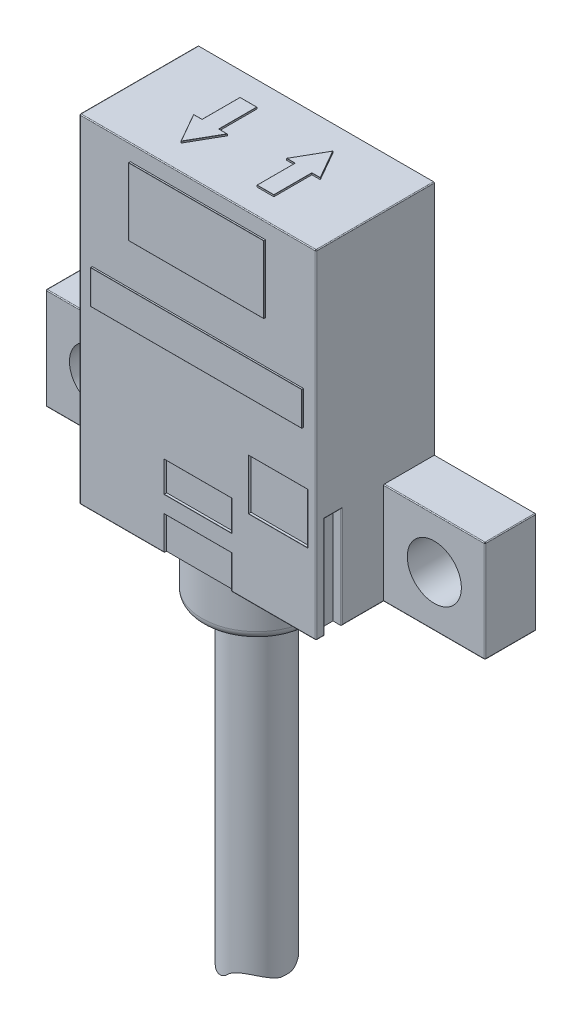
ISO-10303-21;
HEADER;
FILE_DESCRIPTION(('STEP AP214'),'2;1');
FILE_NAME('part.step','',(''),(''),'','','');
FILE_SCHEMA(('AUTOMOTIVE_DESIGN { 1 0 10303 214 1 1 1 1 }'));
ENDSEC;
DATA;
#1=APPLICATION_CONTEXT('core data for automotive mechanical design processes');
#2=APPLICATION_PROTOCOL_DEFINITION('international standard','automotive_design',2000,#1);
#3=PRODUCT_CONTEXT('',#1,'mechanical');
#4=PRODUCT('Part','Part','',(#3));
#5=PRODUCT_RELATED_PRODUCT_CATEGORY('part','',(#4));
#6=PRODUCT_DEFINITION_FORMATION('','',#4);
#7=PRODUCT_DEFINITION_CONTEXT('part definition',#1,'design');
#8=PRODUCT_DEFINITION('design','',#6,#7);
#9=PRODUCT_DEFINITION_SHAPE('','',#8);
#10=(LENGTH_UNIT() NAMED_UNIT(*) SI_UNIT(.MILLI.,.METRE.));
#11=(NAMED_UNIT(*) PLANE_ANGLE_UNIT() SI_UNIT($,.RADIAN.));
#12=(NAMED_UNIT(*) SI_UNIT($,.STERADIAN.) SOLID_ANGLE_UNIT());
#13=UNCERTAINTY_MEASURE_WITH_UNIT(LENGTH_MEASURE(1.E-05),#10,'distance_accuracy_value','');
#14=(GEOMETRIC_REPRESENTATION_CONTEXT(3) GLOBAL_UNCERTAINTY_ASSIGNED_CONTEXT((#13)) GLOBAL_UNIT_ASSIGNED_CONTEXT((#10,
#11,#12)) REPRESENTATION_CONTEXT('',''));
#15=CARTESIAN_POINT('',(0.,0.,0.));
#16=DIRECTION('',(0.,0.,1.));
#17=DIRECTION('',(1.,0.,0.));
#18=AXIS2_PLACEMENT_3D('',#15,#16,#17);
#19=CARTESIAN_POINT('',(0.,0.,3.5));
#20=DIRECTION('',(0.,0.,-1.));
#21=DIRECTION('',(-1.,0.,0.));
#22=AXIS2_PLACEMENT_3D('',#19,#20,#21);
#23=PLANE('',#22);
#24=DIRECTION('',(1.,0.,0.));
#25=VECTOR('',#24,1.);
#26=CARTESIAN_POINT('',(6.5,7.50999999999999,3.5));
#27=LINE('',#26,#25);
#28=CARTESIAN_POINT('',(2.99,7.50999999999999,3.5));
#29=VERTEX_POINT('',#28);
#30=CARTESIAN_POINT('',(6.51,7.50999999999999,3.5));
#31=VERTEX_POINT('',#30);
#32=EDGE_CURVE('E1301',#29,#31,#27,.T.);
#33=ORIENTED_EDGE('',*,*,#32,.T.);
#34=DIRECTION('',(0.,-1.,0.));
#35=VECTOR('',#34,1.);
#36=CARTESIAN_POINT('',(6.51,4.49999999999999,3.5));
#37=LINE('',#36,#35);
#38=CARTESIAN_POINT('',(6.51,4.48999999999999,3.5));
#39=VERTEX_POINT('',#38);
#40=EDGE_CURVE('E1303',#31,#39,#37,.T.);
#41=ORIENTED_EDGE('',*,*,#40,.T.);
#42=DIRECTION('',(1.,0.,0.));
#43=VECTOR('',#42,1.);
#44=CARTESIAN_POINT('',(0.,4.48999999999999,3.5));
#45=LINE('',#44,#43);
#46=CARTESIAN_POINT('',(2.99,4.48999999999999,3.5));
#47=VERTEX_POINT('',#46);
#48=EDGE_CURVE('E1299',#39,#47,#45,.F.);
#49=ORIENTED_EDGE('',*,*,#48,.T.);
#50=DIRECTION('',(0.,-1.,0.));
#51=VECTOR('',#50,1.);
#52=CARTESIAN_POINT('',(2.99,0.,3.5));
#53=LINE('',#52,#51);
#54=EDGE_CURVE('E1297',#47,#29,#53,.F.);
#55=ORIENTED_EDGE('',*,*,#54,.T.);
#56=EDGE_LOOP('',(#33,#41,#49,#55));
#57=FACE_BOUND('',#56,.T.);
#58=DIRECTION('',(1.,0.,0.));
#59=VECTOR('',#58,1.);
#60=CARTESIAN_POINT('',(0.,2.98999999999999,3.5));
#61=LINE('',#60,#59);
#62=CARTESIAN_POINT('',(2.01000000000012,2.98999999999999,3.5));
#63=VERTEX_POINT('',#62);
#64=CARTESIAN_POINT('',(-2.00999999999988,2.98999999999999,3.5));
#65=VERTEX_POINT('',#64);
#66=EDGE_CURVE('E1292',#63,#65,#61,.F.);
#67=ORIENTED_EDGE('',*,*,#66,.T.);
#68=DIRECTION('',(0.,1.,0.));
#69=VECTOR('',#68,1.);
#70=CARTESIAN_POINT('',(-2.00999999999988,4.79999999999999,3.5));
#71=LINE('',#70,#69);
#72=CARTESIAN_POINT('',(-2.00999999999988,4.80999999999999,3.5));
#73=VERTEX_POINT('',#72);
#74=EDGE_CURVE('E1294',#65,#73,#71,.T.);
#75=ORIENTED_EDGE('',*,*,#74,.T.);
#76=DIRECTION('',(1.,0.,0.));
#77=VECTOR('',#76,1.);
#78=CARTESIAN_POINT('',(2.00000000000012,4.80999999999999,3.5));
#79=LINE('',#78,#77);
#80=CARTESIAN_POINT('',(2.01000000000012,4.80999999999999,3.5));
#81=VERTEX_POINT('',#80);
#82=EDGE_CURVE('E1290',#73,#81,#79,.T.);
#83=ORIENTED_EDGE('',*,*,#82,.T.);
#84=DIRECTION('',(0.,1.,0.));
#85=VECTOR('',#84,1.);
#86=CARTESIAN_POINT('',(2.01000000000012,0.,3.5));
#87=LINE('',#86,#85);
#88=EDGE_CURVE('E1288',#81,#63,#87,.F.);
#89=ORIENTED_EDGE('',*,*,#88,.T.);
#90=EDGE_LOOP('',(#67,#75,#83,#89));
#91=FACE_BOUND('',#90,.T.);
#92=DIRECTION('',(1.,0.,0.));
#93=VECTOR('',#92,1.);
#94=CARTESIAN_POINT('',(0.,0.0499999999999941,3.5));
#95=LINE('',#94,#93);
#96=CARTESIAN_POINT('',(-6.95,0.0499999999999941,3.5));
#97=VERTEX_POINT('',#96);
#98=CARTESIAN_POINT('',(-2.00999999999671,0.0499999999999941,3.5));
#99=VERTEX_POINT('',#98);
#100=EDGE_CURVE('E1062',#97,#99,#95,.T.);
#101=ORIENTED_EDGE('',*,*,#100,.T.);
#102=DIRECTION('',(1.68680173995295E-12,-1.,0.));
#103=VECTOR('',#102,1.);
#104=CARTESIAN_POINT('',(-2.00999999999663,-3.39047149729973E-12,3.5));
#105=LINE('',#104,#103);
#106=CARTESIAN_POINT('',(-2.01000000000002,2.00999999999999,3.5));
#107=VERTEX_POINT('',#106);
#108=EDGE_CURVE('E1310',#99,#107,#105,.F.);
#109=ORIENTED_EDGE('',*,*,#108,.T.);
#110=DIRECTION('',(1.,0.,0.));
#111=VECTOR('',#110,1.);
#112=CARTESIAN_POINT('',(2.,2.00999999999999,3.5));
#113=LINE('',#112,#111);
#114=CARTESIAN_POINT('',(2.00999999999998,2.00999999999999,3.5));
#115=VERTEX_POINT('',#114);
#116=EDGE_CURVE('E1308',#107,#115,#113,.T.);
#117=ORIENTED_EDGE('',*,*,#116,.T.);
#118=DIRECTION('',(1.68701858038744E-12,-1.,0.));
#119=VECTOR('',#118,1.);
#120=CARTESIAN_POINT('',(2.01000000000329,0.0500000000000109,3.5));
#121=LINE('',#120,#119);
#122=CARTESIAN_POINT('',(2.01000000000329,0.0499999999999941,3.5));
#123=VERTEX_POINT('',#122);
#124=EDGE_CURVE('E1306',#115,#123,#121,.T.);
#125=ORIENTED_EDGE('',*,*,#124,.T.);
#126=DIRECTION('',(1.,0.,0.));
#127=VECTOR('',#126,1.);
#128=CARTESIAN_POINT('',(0.,0.0499999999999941,3.5));
#129=LINE('',#128,#127);
#130=CARTESIAN_POINT('',(6.95,0.0499999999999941,3.5));
#131=VERTEX_POINT('',#130);
#132=EDGE_CURVE('E1065',#123,#131,#129,.T.);
#133=ORIENTED_EDGE('',*,*,#132,.T.);
#134=DIRECTION('',(0.,1.,0.));
#135=VECTOR('',#134,1.);
#136=CARTESIAN_POINT('',(6.95,0.,3.5));
#137=LINE('',#136,#135);
#138=CARTESIAN_POINT('',(6.95,19.95,3.5));
#139=VERTEX_POINT('',#138);
#140=EDGE_CURVE('E1056',#131,#139,#137,.T.);
#141=ORIENTED_EDGE('',*,*,#140,.T.);
#142=DIRECTION('',(-1.,0.,0.));
#143=VECTOR('',#142,1.);
#144=CARTESIAN_POINT('',(0.,19.95,3.5));
#145=LINE('',#144,#143);
#146=CARTESIAN_POINT('',(-6.95,19.95,3.5));
#147=VERTEX_POINT('',#146);
#148=EDGE_CURVE('E1058',#139,#147,#145,.T.);
#149=ORIENTED_EDGE('',*,*,#148,.T.);
#150=DIRECTION('',(0.,-1.,0.));
#151=VECTOR('',#150,1.);
#152=CARTESIAN_POINT('',(-6.95,0.,3.5));
#153=LINE('',#152,#151);
#154=EDGE_CURVE('E1060',#147,#97,#153,.T.);
#155=ORIENTED_EDGE('',*,*,#154,.T.);
#156=EDGE_LOOP('',(#101,#109,#117,#125,#133,#141,#149,#155));
#157=FACE_BOUND('',#156,.T.);
#158=DIRECTION('',(0.,1.,0.));
#159=VECTOR('',#158,1.);
#160=CARTESIAN_POINT('',(3.99999999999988,19.0495580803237,3.5));
#161=LINE('',#160,#159);
#162=CARTESIAN_POINT('',(3.99999999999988,15.0495580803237,3.5));
#163=VERTEX_POINT('',#162);
#164=CARTESIAN_POINT('',(3.99999999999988,19.0495580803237,3.5));
#165=VERTEX_POINT('',#164);
#166=EDGE_CURVE('E852',#163,#165,#161,.T.);
#167=ORIENTED_EDGE('',*,*,#166,.F.);
#168=DIRECTION('',(1.,0.,0.));
#169=VECTOR('',#168,1.);
#170=CARTESIAN_POINT('',(-4.00000000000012,15.0495580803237,3.5));
#171=LINE('',#170,#169);
#172=CARTESIAN_POINT('',(-4.00000000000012,15.0495580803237,3.5));
#173=VERTEX_POINT('',#172);
#174=EDGE_CURVE('E861',#173,#163,#171,.T.);
#175=ORIENTED_EDGE('',*,*,#174,.F.);
#176=DIRECTION('',(0.,-1.,0.));
#177=VECTOR('',#176,1.);
#178=CARTESIAN_POINT('',(-4.00000000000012,19.0495580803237,3.5));
#179=LINE('',#178,#177);
#180=CARTESIAN_POINT('',(-4.00000000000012,19.0495580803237,3.5));
#181=VERTEX_POINT('',#180);
#182=EDGE_CURVE('E858',#181,#173,#179,.T.);
#183=ORIENTED_EDGE('',*,*,#182,.F.);
#184=DIRECTION('',(-1.,0.,0.));
#185=VECTOR('',#184,1.);
#186=CARTESIAN_POINT('',(-4.00000000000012,19.0495580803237,3.5));
#187=LINE('',#186,#185);
#188=EDGE_CURVE('E855',#165,#181,#187,.T.);
#189=ORIENTED_EDGE('',*,*,#188,.F.);
#190=EDGE_LOOP('',(#167,#175,#183,#189));
#191=FACE_BOUND('',#190,.T.);
#192=DIRECTION('',(0.,-1.,0.));
#193=VECTOR('',#192,1.);
#194=CARTESIAN_POINT('',(-6.25000000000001,10.5495580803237,3.5));
#195=LINE('',#194,#193);
#196=CARTESIAN_POINT('',(-6.25000000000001,12.5495580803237,3.5));
#197=VERTEX_POINT('',#196);
#198=CARTESIAN_POINT('',(-6.25000000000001,10.5495580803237,3.5));
#199=VERTEX_POINT('',#198);
#200=EDGE_CURVE('E601',#197,#199,#195,.T.);
#201=ORIENTED_EDGE('',*,*,#200,.F.);
#202=DIRECTION('',(-1.,0.,0.));
#203=VECTOR('',#202,1.);
#204=CARTESIAN_POINT('',(6.25,12.5495580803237,3.5));
#205=LINE('',#204,#203);
#206=CARTESIAN_POINT('',(6.25,12.5495580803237,3.5));
#207=VERTEX_POINT('',#206);
#208=EDGE_CURVE('E609',#207,#197,#205,.T.);
#209=ORIENTED_EDGE('',*,*,#208,.F.);
#210=DIRECTION('',(0.,1.,0.));
#211=VECTOR('',#210,1.);
#212=CARTESIAN_POINT('',(6.25,10.5495580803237,3.5));
#213=LINE('',#212,#211);
#214=CARTESIAN_POINT('',(6.25,10.5495580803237,3.5));
#215=VERTEX_POINT('',#214);
#216=EDGE_CURVE('E622',#215,#207,#213,.T.);
#217=ORIENTED_EDGE('',*,*,#216,.F.);
#218=DIRECTION('',(1.,0.,0.));
#219=VECTOR('',#218,1.);
#220=CARTESIAN_POINT('',(6.25,10.5495580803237,3.5));
#221=LINE('',#220,#219);
#222=EDGE_CURVE('E617',#199,#215,#221,.T.);
#223=ORIENTED_EDGE('',*,*,#222,.F.);
#224=EDGE_LOOP('',(#201,#209,#217,#223));
#225=FACE_BOUND('',#224,.T.);
#226=ADVANCED_FACE('F32',(#57,#91,#157,#191,#225),#23,.F.);
#227=CARTESIAN_POINT('',(13.,0.,3.5));
#228=DIRECTION('',(0.,1.,0.));
#229=DIRECTION('',(0.,0.,1.));
#230=AXIS2_PLACEMENT_3D('',#227,#228,#229);
#231=PLANE('',#230);
#232=DIRECTION('',(1.,0.,0.));
#233=VECTOR('',#232,1.);
#234=CARTESIAN_POINT('',(-1.99999999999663,0.,3.35));
#235=LINE('',#234,#233);
#236=CARTESIAN_POINT('',(-2.00999999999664,0.,3.35));
#237=VERTEX_POINT('',#236);
#238=CARTESIAN_POINT('',(2.01000000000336,0.,3.35));
#239=VERTEX_POINT('',#238);
#240=EDGE_CURVE('E708',#237,#239,#235,.T.);
#241=ORIENTED_EDGE('',*,*,#240,.F.);
#242=DIRECTION('',(0.,0.,1.));
#243=VECTOR('',#242,1.);
#244=CARTESIAN_POINT('',(-2.00999999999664,0.,3.5));
#245=LINE('',#244,#243);
#246=CARTESIAN_POINT('',(-2.00999999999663,0.,3.45));
#247=VERTEX_POINT('',#246);
#248=EDGE_CURVE('E1175',#237,#247,#245,.T.);
#249=ORIENTED_EDGE('',*,*,#248,.T.);
#250=DIRECTION('',(1.,0.,0.));
#251=VECTOR('',#250,1.);
#252=CARTESIAN_POINT('',(13.,0.,3.45));
#253=LINE('',#252,#251);
#254=CARTESIAN_POINT('',(-6.95,0.,3.45));
#255=VERTEX_POINT('',#254);
#256=EDGE_CURVE('E959',#247,#255,#253,.F.);
#257=ORIENTED_EDGE('',*,*,#256,.T.);
#258=DIRECTION('',(0.,0.,1.));
#259=VECTOR('',#258,1.);
#260=CARTESIAN_POINT('',(-6.95,0.,3.5));
#261=LINE('',#260,#259);
#262=CARTESIAN_POINT('',(-6.95,0.,3.));
#263=VERTEX_POINT('',#262);
#264=EDGE_CURVE('E961',#255,#263,#261,.F.);
#265=ORIENTED_EDGE('',*,*,#264,.T.);
#266=DIRECTION('',(-1.,0.,0.));
#267=VECTOR('',#266,1.);
#268=CARTESIAN_POINT('',(-6.5,0.,3.));
#269=LINE('',#268,#267);
#270=CARTESIAN_POINT('',(-6.5,0.,3.));
#271=VERTEX_POINT('',#270);
#272=EDGE_CURVE('E670',#271,#263,#269,.T.);
#273=ORIENTED_EDGE('',*,*,#272,.F.);
#274=DIRECTION('',(0.,0.,1.));
#275=VECTOR('',#274,1.);
#276=CARTESIAN_POINT('',(-6.5,0.,3.));
#277=LINE('',#276,#275);
#278=CARTESIAN_POINT('',(-6.5,0.,2.));
#279=VERTEX_POINT('',#278);
#280=EDGE_CURVE('E660',#279,#271,#277,.T.);
#281=ORIENTED_EDGE('',*,*,#280,.F.);
#282=DIRECTION('',(-1.,0.,0.));
#283=VECTOR('',#282,1.);
#284=CARTESIAN_POINT('',(-6.5,0.,2.));
#285=LINE('',#284,#283);
#286=CARTESIAN_POINT('',(-6.95,0.,2.));
#287=VERTEX_POINT('',#286);
#288=EDGE_CURVE('E673',#279,#287,#285,.T.);
#289=ORIENTED_EDGE('',*,*,#288,.T.);
#290=DIRECTION('',(0.,0.,1.));
#291=VECTOR('',#290,1.);
#292=CARTESIAN_POINT('',(-6.95,0.,3.5));
#293=LINE('',#292,#291);
#294=CARTESIAN_POINT('',(-6.95,0.,-0.55));
#295=VERTEX_POINT('',#294);
#296=EDGE_CURVE('E972',#287,#295,#293,.F.);
#297=ORIENTED_EDGE('',*,*,#296,.T.);
#298=DIRECTION('',(1.,0.,0.));
#299=VECTOR('',#298,1.);
#300=CARTESIAN_POINT('',(13.,0.,-0.55));
#301=LINE('',#300,#299);
#302=CARTESIAN_POINT('',(-12.95,0.,-0.55));
#303=VERTEX_POINT('',#302);
#304=EDGE_CURVE('E968',#295,#303,#301,.F.);
#305=ORIENTED_EDGE('',*,*,#304,.T.);
#306=DIRECTION('',(0.,0.,-1.));
#307=VECTOR('',#306,1.);
#308=CARTESIAN_POINT('',(-12.95,0.,3.5));
#309=LINE('',#308,#307);
#310=CARTESIAN_POINT('',(-12.95,0.,-3.5));
#311=VERTEX_POINT('',#310);
#312=EDGE_CURVE('E970',#303,#311,#309,.T.);
#313=ORIENTED_EDGE('',*,*,#312,.T.);
#314=DIRECTION('',(1.,0.,0.));
#315=VECTOR('',#314,1.);
#316=CARTESIAN_POINT('',(13.,0.,-3.5));
#317=LINE('',#316,#315);
#318=CARTESIAN_POINT('',(12.95,0.,-3.5));
#319=VERTEX_POINT('',#318);
#320=EDGE_CURVE('E895',#311,#319,#317,.T.);
#321=ORIENTED_EDGE('',*,*,#320,.T.);
#322=DIRECTION('',(0.,0.,-1.));
#323=VECTOR('',#322,1.);
#324=CARTESIAN_POINT('',(12.95,0.,3.5));
#325=LINE('',#324,#323);
#326=CARTESIAN_POINT('',(12.95,0.,-0.55));
#327=VERTEX_POINT('',#326);
#328=EDGE_CURVE('E976',#319,#327,#325,.F.);
#329=ORIENTED_EDGE('',*,*,#328,.T.);
#330=DIRECTION('',(-1.,0.,0.));
#331=VECTOR('',#330,1.);
#332=CARTESIAN_POINT('',(13.,0.,-0.55));
#333=LINE('',#332,#331);
#334=CARTESIAN_POINT('',(6.95,0.,-0.55));
#335=VERTEX_POINT('',#334);
#336=EDGE_CURVE('E974',#327,#335,#333,.T.);
#337=ORIENTED_EDGE('',*,*,#336,.T.);
#338=DIRECTION('',(0.,0.,1.));
#339=VECTOR('',#338,1.);
#340=CARTESIAN_POINT('',(6.95,0.,3.5));
#341=LINE('',#340,#339);
#342=CARTESIAN_POINT('',(6.95,0.,2.));
#343=VERTEX_POINT('',#342);
#344=EDGE_CURVE('E978',#335,#343,#341,.T.);
#345=ORIENTED_EDGE('',*,*,#344,.T.);
#346=DIRECTION('',(1.,0.,0.));
#347=VECTOR('',#346,1.);
#348=CARTESIAN_POINT('',(6.5,0.,2.));
#349=LINE('',#348,#347);
#350=CARTESIAN_POINT('',(6.5,0.,2.));
#351=VERTEX_POINT('',#350);
#352=EDGE_CURVE('E647',#351,#343,#349,.T.);
#353=ORIENTED_EDGE('',*,*,#352,.F.);
#354=DIRECTION('',(0.,0.,1.));
#355=VECTOR('',#354,1.);
#356=CARTESIAN_POINT('',(6.5,0.,3.));
#357=LINE('',#356,#355);
#358=CARTESIAN_POINT('',(6.5,0.,3.));
#359=VERTEX_POINT('',#358);
#360=EDGE_CURVE('E637',#351,#359,#357,.T.);
#361=ORIENTED_EDGE('',*,*,#360,.T.);
#362=DIRECTION('',(1.,0.,0.));
#363=VECTOR('',#362,1.);
#364=CARTESIAN_POINT('',(6.5,0.,3.));
#365=LINE('',#364,#363);
#366=CARTESIAN_POINT('',(6.95,0.,3.));
#367=VERTEX_POINT('',#366);
#368=EDGE_CURVE('E650',#359,#367,#365,.T.);
#369=ORIENTED_EDGE('',*,*,#368,.T.);
#370=DIRECTION('',(0.,0.,1.));
#371=VECTOR('',#370,1.);
#372=CARTESIAN_POINT('',(6.95,0.,3.5));
#373=LINE('',#372,#371);
#374=CARTESIAN_POINT('',(6.95,0.,3.45));
#375=VERTEX_POINT('',#374);
#376=EDGE_CURVE('E966',#367,#375,#373,.T.);
#377=ORIENTED_EDGE('',*,*,#376,.T.);
#378=DIRECTION('',(1.,0.,0.));
#379=VECTOR('',#378,1.);
#380=CARTESIAN_POINT('',(13.,0.,3.45));
#381=LINE('',#380,#379);
#382=CARTESIAN_POINT('',(2.01000000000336,0.,3.45));
#383=VERTEX_POINT('',#382);
#384=EDGE_CURVE('E963',#375,#383,#381,.F.);
#385=ORIENTED_EDGE('',*,*,#384,.T.);
#386=DIRECTION('',(0.,0.,1.));
#387=VECTOR('',#386,1.);
#388=CARTESIAN_POINT('',(2.01000000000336,0.,3.35));
#389=LINE('',#388,#387);
#390=EDGE_CURVE('E1071',#383,#239,#389,.F.);
#391=ORIENTED_EDGE('',*,*,#390,.T.);
#392=EDGE_LOOP('',(#241,#249,#257,#265,#273,#281,#289,#297,#305,#313,#321,#329,#337,#345,#353,
#361,#369,#377,#385,#391));
#393=FACE_BOUND('',#392,.T.);
#394=CARTESIAN_POINT('',(0.,0.,0.));
#395=DIRECTION('',(0.,1.,0.));
#396=DIRECTION('',(0.,0.,1.));
#397=AXIS2_PLACEMENT_3D('',#394,#395,#396);
#398=CIRCLE('',#397,3.25);
#399=CARTESIAN_POINT('',(0.,0.,3.25));
#400=VERTEX_POINT('',#399);
#401=EDGE_CURVE('E914',#400,#400,#398,.F.);
#402=ORIENTED_EDGE('',*,*,#401,.F.);
#403=EDGE_LOOP('',(#402));
#404=FACE_BOUND('',#403,.T.);
#405=ADVANCED_FACE('F1445',(#393,#404),#231,.F.);
#406=CARTESIAN_POINT('',(7.,20.,3.5));
#407=DIRECTION('',(-1.,0.,0.));
#408=DIRECTION('',(0.,-1.,0.));
#409=AXIS2_PLACEMENT_3D('',#406,#407,#408);
#410=PLANE('',#409);
#411=DIRECTION('',(0.,-1.,0.));
#412=VECTOR('',#411,1.);
#413=CARTESIAN_POINT('',(7.,0.,1.95));
#414=LINE('',#413,#412);
#415=CARTESIAN_POINT('',(7.,6.05000000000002,1.95));
#416=VERTEX_POINT('',#415);
#417=CARTESIAN_POINT('',(7.,0.0499999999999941,1.95));
#418=VERTEX_POINT('',#417);
#419=EDGE_CURVE('E990',#416,#418,#414,.T.);
#420=ORIENTED_EDGE('',*,*,#419,.T.);
#421=DIRECTION('',(0.,0.,1.));
#422=VECTOR('',#421,1.);
#423=CARTESIAN_POINT('',(7.,0.0499999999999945,3.5));
#424=LINE('',#423,#422);
#425=CARTESIAN_POINT('',(7.,0.0499999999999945,-0.5));
#426=VERTEX_POINT('',#425);
#427=EDGE_CURVE('E992',#418,#426,#424,.F.);
#428=ORIENTED_EDGE('',*,*,#427,.T.);
#429=DIRECTION('',(0.,1.,0.));
#430=VECTOR('',#429,1.);
#431=CARTESIAN_POINT('',(7.,6.00000000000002,-0.5));
#432=LINE('',#431,#430);
#433=CARTESIAN_POINT('',(7.,5.94999999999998,-0.5));
#434=VERTEX_POINT('',#433);
#435=EDGE_CURVE('E872',#426,#434,#432,.T.);
#436=ORIENTED_EDGE('',*,*,#435,.T.);
#437=CARTESIAN_POINT('',(7.,5.94999999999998,-0.55));
#438=DIRECTION('',(-1.,0.,0.));
#439=DIRECTION('',(0.,-1.,0.));
#440=AXIS2_PLACEMENT_3D('',#437,#438,#439);
#441=CIRCLE('',#440,0.05);
#442=CARTESIAN_POINT('',(7.,5.99999999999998,-0.55));
#443=VERTEX_POINT('',#442);
#444=EDGE_CURVE('E1067',#434,#443,#441,.T.);
#445=ORIENTED_EDGE('',*,*,#444,.T.);
#446=DIRECTION('',(0.,0.,-1.));
#447=VECTOR('',#446,1.);
#448=CARTESIAN_POINT('',(7.,5.99999999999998,3.5));
#449=LINE('',#448,#447);
#450=CARTESIAN_POINT('',(7.,5.99999999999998,-3.5));
#451=VERTEX_POINT('',#450);
#452=EDGE_CURVE('E909',#443,#451,#449,.T.);
#453=ORIENTED_EDGE('',*,*,#452,.T.);
#454=DIRECTION('',(0.,1.,0.));
#455=VECTOR('',#454,1.);
#456=CARTESIAN_POINT('',(7.,20.,-3.5));
#457=LINE('',#456,#455);
#458=CARTESIAN_POINT('',(7.,19.95,-3.5));
#459=VERTEX_POINT('',#458);
#460=EDGE_CURVE('E903',#451,#459,#457,.T.);
#461=ORIENTED_EDGE('',*,*,#460,.T.);
#462=DIRECTION('',(0.,0.,-1.));
#463=VECTOR('',#462,1.);
#464=CARTESIAN_POINT('',(7.,19.95,3.5));
#465=LINE('',#464,#463);
#466=CARTESIAN_POINT('',(7.,19.95,3.45));
#467=VERTEX_POINT('',#466);
#468=EDGE_CURVE('E982',#459,#467,#465,.F.);
#469=ORIENTED_EDGE('',*,*,#468,.T.);
#470=DIRECTION('',(0.,1.,0.));
#471=VECTOR('',#470,1.);
#472=CARTESIAN_POINT('',(7.,20.,3.45));
#473=LINE('',#472,#471);
#474=CARTESIAN_POINT('',(7.,0.0499999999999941,3.45));
#475=VERTEX_POINT('',#474);
#476=EDGE_CURVE('E980',#467,#475,#473,.F.);
#477=ORIENTED_EDGE('',*,*,#476,.T.);
#478=DIRECTION('',(0.,0.,1.));
#479=VECTOR('',#478,1.);
#480=CARTESIAN_POINT('',(7.,0.0499999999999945,3.5));
#481=LINE('',#480,#479);
#482=CARTESIAN_POINT('',(7.,0.0499999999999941,3.05));
#483=VERTEX_POINT('',#482);
#484=EDGE_CURVE('E984',#475,#483,#481,.F.);
#485=ORIENTED_EDGE('',*,*,#484,.T.);
#486=DIRECTION('',(0.,1.,0.));
#487=VECTOR('',#486,1.);
#488=CARTESIAN_POINT('',(7.,6.00000000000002,3.05));
#489=LINE('',#488,#487);
#490=CARTESIAN_POINT('',(7.,6.05000000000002,3.05));
#491=VERTEX_POINT('',#490);
#492=EDGE_CURVE('E986',#483,#491,#489,.T.);
#493=ORIENTED_EDGE('',*,*,#492,.T.);
#494=DIRECTION('',(0.,0.,-1.));
#495=VECTOR('',#494,1.);
#496=CARTESIAN_POINT('',(7.,6.05000000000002,2.));
#497=LINE('',#496,#495);
#498=EDGE_CURVE('E988',#491,#416,#497,.T.);
#499=ORIENTED_EDGE('',*,*,#498,.T.);
#500=EDGE_LOOP('',(#420,#428,#436,#445,#453,#461,#469,#477,#485,#493,#499));
#501=FACE_BOUND('',#500,.T.);
#502=ADVANCED_FACE('F1451',(#501),#410,.F.);
#503=CARTESIAN_POINT('',(-7.,20.,3.5));
#504=DIRECTION('',(0.,-1.,0.));
#505=DIRECTION('',(0.,0.,-1.));
#506=AXIS2_PLACEMENT_3D('',#503,#504,#505);
#507=PLANE('',#506);
#508=DIRECTION('',(-0.496138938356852,0.,0.868243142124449));
#509=VECTOR('',#508,1.);
#510=CARTESIAN_POINT('',(1.5,20.,-0.250000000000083));
#511=LINE('',#510,#509);
#512=CARTESIAN_POINT('',(2.5,20.,-2.));
#513=VERTEX_POINT('',#512);
#514=CARTESIAN_POINT('',(1.5,20.,-0.250000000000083));
#515=VERTEX_POINT('',#514);
#516=EDGE_CURVE('E771',#513,#515,#511,.T.);
#517=ORIENTED_EDGE('',*,*,#516,.F.);
#518=DIRECTION('',(-0.496138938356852,0.,-0.868243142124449));
#519=VECTOR('',#518,1.);
#520=CARTESIAN_POINT('',(2.5,20.,-2.));
#521=LINE('',#520,#519);
#522=CARTESIAN_POINT('',(3.5,20.,-0.250000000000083));
#523=VERTEX_POINT('',#522);
#524=EDGE_CURVE('E789',#523,#513,#521,.T.);
#525=ORIENTED_EDGE('',*,*,#524,.F.);
#526=DIRECTION('',(1.,0.,-1.66967134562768E-13));
#527=VECTOR('',#526,1.);
#528=CARTESIAN_POINT('',(3.5,20.,-0.250000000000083));
#529=LINE('',#528,#527);
#530=CARTESIAN_POINT('',(3.,20.,-0.25));
#531=VERTEX_POINT('',#530);
#532=EDGE_CURVE('E786',#531,#523,#529,.T.);
#533=ORIENTED_EDGE('',*,*,#532,.F.);
#534=DIRECTION('',(0.,0.,-1.));
#535=VECTOR('',#534,1.);
#536=CARTESIAN_POINT('',(3.,20.,-0.25));
#537=LINE('',#536,#535);
#538=CARTESIAN_POINT('',(3.,20.,2.));
#539=VERTEX_POINT('',#538);
#540=EDGE_CURVE('E783',#539,#531,#537,.T.);
#541=ORIENTED_EDGE('',*,*,#540,.F.);
#542=DIRECTION('',(1.,0.,0.));
#543=VECTOR('',#542,1.);
#544=CARTESIAN_POINT('',(3.,20.,2.));
#545=LINE('',#544,#543);
#546=CARTESIAN_POINT('',(2.,20.,2.));
#547=VERTEX_POINT('',#546);
#548=EDGE_CURVE('E780',#547,#539,#545,.T.);
#549=ORIENTED_EDGE('',*,*,#548,.F.);
#550=DIRECTION('',(0.,0.,1.));
#551=VECTOR('',#550,1.);
#552=CARTESIAN_POINT('',(2.,20.,2.));
#553=LINE('',#552,#551);
#554=CARTESIAN_POINT('',(2.,20.,-0.25));
#555=VERTEX_POINT('',#554);
#556=EDGE_CURVE('E777',#555,#547,#553,.T.);
#557=ORIENTED_EDGE('',*,*,#556,.F.);
#558=DIRECTION('',(1.,0.,1.66967134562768E-13));
#559=VECTOR('',#558,1.);
#560=CARTESIAN_POINT('',(2.,20.,-0.25));
#561=LINE('',#560,#559);
#562=EDGE_CURVE('E774',#515,#555,#561,.T.);
#563=ORIENTED_EDGE('',*,*,#562,.F.);
#564=EDGE_LOOP('',(#517,#525,#533,#541,#549,#557,#563));
#565=FACE_BOUND('',#564,.T.);
#566=DIRECTION('',(-1.,0.,0.));
#567=VECTOR('',#566,1.);
#568=CARTESIAN_POINT('',(-7.,20.,3.45));
#569=LINE('',#568,#567);
#570=CARTESIAN_POINT('',(-6.95,20.,3.45));
#571=VERTEX_POINT('',#570);
#572=CARTESIAN_POINT('',(6.95,20.,3.45));
#573=VERTEX_POINT('',#572);
#574=EDGE_CURVE('E1016',#571,#573,#569,.F.);
#575=ORIENTED_EDGE('',*,*,#574,.T.);
#576=DIRECTION('',(0.,0.,-1.));
#577=VECTOR('',#576,1.);
#578=CARTESIAN_POINT('',(6.95,20.,3.5));
#579=LINE('',#578,#577);
#580=CARTESIAN_POINT('',(6.95,20.,-3.5));
#581=VERTEX_POINT('',#580);
#582=EDGE_CURVE('E1020',#573,#581,#579,.T.);
#583=ORIENTED_EDGE('',*,*,#582,.T.);
#584=DIRECTION('',(-1.,0.,0.));
#585=VECTOR('',#584,1.);
#586=CARTESIAN_POINT('',(-7.,20.,-3.5));
#587=LINE('',#586,#585);
#588=CARTESIAN_POINT('',(-6.95,20.,-3.5));
#589=VERTEX_POINT('',#588);
#590=EDGE_CURVE('E906',#581,#589,#587,.T.);
#591=ORIENTED_EDGE('',*,*,#590,.T.);
#592=DIRECTION('',(0.,0.,-1.));
#593=VECTOR('',#592,1.);
#594=CARTESIAN_POINT('',(-6.95,20.,3.5));
#595=LINE('',#594,#593);
#596=EDGE_CURVE('E1018',#589,#571,#595,.F.);
#597=ORIENTED_EDGE('',*,*,#596,.T.);
#598=EDGE_LOOP('',(#575,#583,#591,#597));
#599=FACE_BOUND('',#598,.T.);
#600=DIRECTION('',(0.496138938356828,0.,0.868243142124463));
#601=VECTOR('',#600,1.);
#602=CARTESIAN_POINT('',(-2.5,20.,2.));
#603=LINE('',#602,#601);
#604=CARTESIAN_POINT('',(-3.5,20.,0.249999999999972));
#605=VERTEX_POINT('',#604);
#606=CARTESIAN_POINT('',(-2.5,20.,2.));
#607=VERTEX_POINT('',#606);
#608=EDGE_CURVE('E736',#605,#607,#603,.T.);
#609=ORIENTED_EDGE('',*,*,#608,.F.);
#610=DIRECTION('',(-1.,0.,0.));
#611=VECTOR('',#610,1.);
#612=CARTESIAN_POINT('',(-3.5,20.,0.249999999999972));
#613=LINE('',#612,#611);
#614=CARTESIAN_POINT('',(-3.00000000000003,20.,0.250000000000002));
#615=VERTEX_POINT('',#614);
#616=EDGE_CURVE('E754',#615,#605,#613,.T.);
#617=ORIENTED_EDGE('',*,*,#616,.F.);
#618=DIRECTION('',(0.,0.,1.));
#619=VECTOR('',#618,1.);
#620=CARTESIAN_POINT('',(-3.00000000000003,20.,0.250000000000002));
#621=LINE('',#620,#619);
#622=CARTESIAN_POINT('',(-3.00000000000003,20.,-1.99921390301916));
#623=VERTEX_POINT('',#622);
#624=EDGE_CURVE('E751',#623,#615,#621,.T.);
#625=ORIENTED_EDGE('',*,*,#624,.F.);
#626=DIRECTION('',(-1.,0.,0.));
#627=VECTOR('',#626,1.);
#628=CARTESIAN_POINT('',(-3.00000000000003,20.,-1.99921390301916));
#629=LINE('',#628,#627);
#630=CARTESIAN_POINT('',(-1.99999999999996,20.,-1.99921390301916));
#631=VERTEX_POINT('',#630);
#632=EDGE_CURVE('E748',#631,#623,#629,.T.);
#633=ORIENTED_EDGE('',*,*,#632,.F.);
#634=DIRECTION('',(0.,0.,-1.));
#635=VECTOR('',#634,1.);
#636=CARTESIAN_POINT('',(-1.99999999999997,20.,-1.99921390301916));
#637=LINE('',#636,#635);
#638=CARTESIAN_POINT('',(-1.99999999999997,20.,0.250000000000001));
#639=VERTEX_POINT('',#638);
#640=EDGE_CURVE('E745',#639,#631,#637,.T.);
#641=ORIENTED_EDGE('',*,*,#640,.F.);
#642=DIRECTION('',(-1.,0.,0.));
#643=VECTOR('',#642,1.);
#644=CARTESIAN_POINT('',(-1.99999999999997,20.,0.250000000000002));
#645=LINE('',#644,#643);
#646=CARTESIAN_POINT('',(-1.5,20.,0.249999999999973));
#647=VERTEX_POINT('',#646);
#648=EDGE_CURVE('E742',#647,#639,#645,.T.);
#649=ORIENTED_EDGE('',*,*,#648,.F.);
#650=DIRECTION('',(0.496138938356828,0.,-0.868243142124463));
#651=VECTOR('',#650,1.);
#652=CARTESIAN_POINT('',(-1.5,20.,0.249999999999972));
#653=LINE('',#652,#651);
#654=EDGE_CURVE('E739',#607,#647,#653,.T.);
#655=ORIENTED_EDGE('',*,*,#654,.F.);
#656=EDGE_LOOP('',(#609,#617,#625,#633,#641,#649,#655));
#657=FACE_BOUND('',#656,.T.);
#658=ADVANCED_FACE('F1464',(#565,#599,#657),#507,.F.);
#659=CARTESIAN_POINT('',(0.,-40.,0.));
#660=DIRECTION('',(0.,1.,0.));
#661=DIRECTION('',(0.,0.,1.));
#662=AXIS2_PLACEMENT_3D('',#659,#660,#661);
#663=CYLINDRICAL_SURFACE('',#662,1.75);
#664=CARTESIAN_POINT('',(0.,-3.,0.));
#665=DIRECTION('',(0.,-1.,0.));
#666=DIRECTION('',(0.,0.,-1.));
#667=AXIS2_PLACEMENT_3D('',#664,#665,#666);
#668=CIRCLE('',#667,1.75);
#669=CARTESIAN_POINT('',(0.,-3.,-1.75));
#670=VERTEX_POINT('',#669);
#671=EDGE_CURVE('E844',#670,#670,#668,.T.);
#672=ORIENTED_EDGE('',*,*,#671,.T.);
#673=EDGE_LOOP('',(#672));
#674=FACE_BOUND('',#673,.T.);
#675=CARTESIAN_POINT('',(0.,-21.5,1.75));
#676=CARTESIAN_POINT('',(0.0213329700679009,-21.4786664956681,1.74999957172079));
#677=CARTESIAN_POINT('',(0.043454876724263,-21.4581359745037,1.74960932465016));
#678=CARTESIAN_POINT('',(0.0891495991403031,-21.4187853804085,1.74787778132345));
#679=CARTESIAN_POINT('',(0.112722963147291,-21.3999659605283,1.74653612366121));
#680=CARTESIAN_POINT('',(0.185365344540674,-21.3462834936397,1.74083013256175));
#681=CARTESIAN_POINT('',(0.236391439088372,-21.3141615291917,1.73478533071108));
#682=CARTESIAN_POINT('',(0.34201922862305,-21.2580498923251,1.7170896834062));
#683=CARTESIAN_POINT('',(0.396631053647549,-21.2340845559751,1.70542230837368));
#684=CARTESIAN_POINT('',(0.507175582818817,-21.1947690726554,1.67586939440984));
#685=CARTESIAN_POINT('',(0.563106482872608,-21.1794077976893,1.65799193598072));
#686=CARTESIAN_POINT('',(0.672362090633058,-21.1573514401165,1.61670213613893));
#687=CARTESIAN_POINT('',(0.725710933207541,-21.1503806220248,1.59349762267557));
#688=CARTESIAN_POINT('',(0.830186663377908,-21.1433857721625,1.54165511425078));
#689=CARTESIAN_POINT('',(0.881311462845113,-21.1433681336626,1.51301214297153));
#690=CARTESIAN_POINT('',(0.996748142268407,-21.1501952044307,1.44050604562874));
#691=CARTESIAN_POINT('',(1.05974001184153,-21.1593408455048,1.39475866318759));
#692=CARTESIAN_POINT('',(1.178239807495,-21.1852806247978,1.29623491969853));
#693=CARTESIAN_POINT('',(1.23373058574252,-21.2020919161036,1.24344298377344));
#694=CARTESIAN_POINT('',(1.35328330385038,-21.2468758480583,1.11409045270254));
#695=CARTESIAN_POINT('',(1.41430050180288,-21.2766999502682,1.03536940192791));
#696=CARTESIAN_POINT('',(1.52182036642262,-21.339005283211,0.869675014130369));
#697=CARTESIAN_POINT('',(1.56833011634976,-21.371485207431,0.782705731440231));
#698=CARTESIAN_POINT('',(1.63193281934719,-21.4212180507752,0.634927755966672));
#699=CARTESIAN_POINT('',(1.65353009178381,-21.4396363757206,0.57644117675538));
#700=CARTESIAN_POINT('',(1.690525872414,-21.4729501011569,0.456655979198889));
#701=CARTESIAN_POINT('',(1.70592950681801,-21.487848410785,0.395359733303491));
#702=CARTESIAN_POINT('',(1.71808106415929,-21.5,0.332712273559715));
#703=B_SPLINE_CURVE_WITH_KNOTS('',3,(#675,#676,#677,#678,#679,#680,#681,#682,#683,#684,#685,
#686,#687,#688,#689,#690,#691,#692,#693,#694,#695,#696,#697,#698,#699,#700,#701,#702),
.UNSPECIFIED.,.F.,.F.,(4,2,2,2,2,2,2,2,2,2,2,2,2,4),(0.,0.0904633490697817,0.180961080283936,
0.36181088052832,0.543195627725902,0.724345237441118,0.899363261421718,1.07454220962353,
1.30840778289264,1.54279925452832,1.85310444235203,2.16325788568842,2.35788397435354,
2.5523486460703),.UNSPECIFIED.);
#704=CARTESIAN_POINT('',(0.,-21.5,1.75));
#705=VERTEX_POINT('',#704);
#706=CARTESIAN_POINT('',(1.71808106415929,-21.5,0.332712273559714));
#707=VERTEX_POINT('',#706);
#708=EDGE_CURVE('E921',#705,#707,#703,.T.);
#709=ORIENTED_EDGE('',*,*,#708,.T.);
#710=CARTESIAN_POINT('',(0.,-21.5,0.));
#711=DIRECTION('',(0.,1.,0.));
#712=DIRECTION('',(0.981760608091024,0.,0.190121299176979));
#713=AXIS2_PLACEMENT_3D('',#710,#711,#712);
#714=CIRCLE('',#713,1.75);
#715=CARTESIAN_POINT('',(1.71808106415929,-21.5,-0.332712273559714));
#716=VERTEX_POINT('',#715);
#717=EDGE_CURVE('E809',#707,#716,#714,.T.);
#718=ORIENTED_EDGE('',*,*,#717,.T.);
#719=CARTESIAN_POINT('',(1.71808106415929,-21.5,-0.332712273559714));
#720=CARTESIAN_POINT('',(1.70840598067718,-21.4903267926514,-0.382643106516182));
#721=CARTESIAN_POINT('',(1.69664371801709,-21.4788853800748,-0.431751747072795));
#722=CARTESIAN_POINT('',(1.66916395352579,-21.4535299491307,-0.528112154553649));
#723=CARTESIAN_POINT('',(1.65345283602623,-21.4396199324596,-0.5753667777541));
#724=CARTESIAN_POINT('',(1.6181775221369,-21.4102829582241,-0.668190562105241));
#725=CARTESIAN_POINT('',(1.59859516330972,-21.3948490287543,-0.713750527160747));
#726=CARTESIAN_POINT('',(1.55572833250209,-21.3634328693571,-0.802904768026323));
#727=CARTESIAN_POINT('',(1.53244238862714,-21.3474504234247,-0.846498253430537));
#728=CARTESIAN_POINT('',(1.45980216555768,-21.3016183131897,-0.969659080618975));
#729=CARTESIAN_POINT('',(1.40571903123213,-21.2721122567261,-1.04663929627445));
#730=CARTESIAN_POINT('',(1.28474690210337,-21.2192957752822,-1.19197486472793));
#731=CARTESIAN_POINT('',(1.21790024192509,-21.1959654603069,-1.26035752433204));
#732=CARTESIAN_POINT('',(1.09373115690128,-21.1658905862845,-1.3677924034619));
#733=CARTESIAN_POINT('',(1.03944340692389,-21.1562810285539,-1.40953612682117));
#734=CARTESIAN_POINT('',(0.925728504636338,-21.1446630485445,-1.48668544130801));
#735=CARTESIAN_POINT('',(0.866304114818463,-21.1426505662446,-1.52209440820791));
#736=CARTESIAN_POINT('',(0.743410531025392,-21.1481146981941,-1.58576965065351));
#737=CARTESIAN_POINT('',(0.679910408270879,-21.155674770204,-1.61397049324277));
#738=CARTESIAN_POINT('',(0.552021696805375,-21.1818046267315,-1.6620550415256));
#739=CARTESIAN_POINT('',(0.487633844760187,-21.2003657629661,-1.68194525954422));
#740=CARTESIAN_POINT('',(0.369603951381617,-21.2455728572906,-1.71146205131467));
#741=CARTESIAN_POINT('',(0.315669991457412,-21.2708186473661,-1.72210053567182));
#742=CARTESIAN_POINT('',(0.211527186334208,-21.3293859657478,-1.73796639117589));
#743=CARTESIAN_POINT('',(0.161316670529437,-21.3627038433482,-1.74319620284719));
#744=CARTESIAN_POINT('',(0.0938202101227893,-21.4151202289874,-1.74759933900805));
#745=CARTESIAN_POINT('',(0.0742945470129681,-21.4312909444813,-1.7485261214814));
#746=CARTESIAN_POINT('',(0.0363307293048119,-21.4647882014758,-1.7497251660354));
#747=CARTESIAN_POINT('',(0.0178898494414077,-21.4821115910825,-1.74999914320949));
#748=CARTESIAN_POINT('',(0.,-21.5,-1.75));
#749=B_SPLINE_CURVE_WITH_KNOTS('',3,(#719,#720,#721,#722,#723,#724,#725,#726,#727,#728,#729,
#730,#731,#732,#733,#734,#735,#736,#737,#738,#739,#740,#741,#742,#743,#744,#745,#746,#747,#748),
.UNSPECIFIED.,.F.,.F.,(4,2,2,2,2,2,2,2,2,2,2,2,2,2,4),(0.,0.155131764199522,0.310014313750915,
0.46564153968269,0.621330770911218,0.915857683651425,1.20942415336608,1.41612415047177,
1.62271366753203,1.83111678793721,2.0393562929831,2.21995499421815,2.40047216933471,
2.47653447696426,2.55239672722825),.UNSPECIFIED.);
#750=CARTESIAN_POINT('',(0.,-21.5,-1.75));
#751=VERTEX_POINT('',#750);
#752=EDGE_CURVE('E929',#716,#751,#749,.T.);
#753=ORIENTED_EDGE('',*,*,#752,.T.);
#754=CARTESIAN_POINT('',(0.,-21.5,-1.75));
#755=CARTESIAN_POINT('',(-0.0216389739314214,-21.5216395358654,-1.74999954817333));
#756=CARTESIAN_POINT('',(-0.0440749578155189,-21.542467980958,-1.74959803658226));
#757=CARTESIAN_POINT('',(-0.0904126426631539,-21.5823972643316,-1.74781716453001));
#758=CARTESIAN_POINT('',(-0.114314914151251,-21.6014974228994,-1.74643742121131));
#759=CARTESIAN_POINT('',(-0.187964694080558,-21.6559949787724,-1.74057039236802));
#760=CARTESIAN_POINT('',(-0.239688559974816,-21.6886227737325,-1.73435584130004));
#761=CARTESIAN_POINT('',(-0.346739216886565,-21.7456619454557,-1.71616621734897));
#762=CARTESIAN_POINT('',(-0.402076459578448,-21.7700481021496,-1.70417373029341));
#763=CARTESIAN_POINT('',(-0.514049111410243,-21.8101135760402,-1.67380110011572));
#764=CARTESIAN_POINT('',(-0.570682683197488,-21.8258045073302,-1.65542953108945));
#765=CARTESIAN_POINT('',(-0.681196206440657,-21.8484230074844,-1.613026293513));
#766=CARTESIAN_POINT('',(-0.735103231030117,-21.8556376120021,-1.58921481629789));
#767=CARTESIAN_POINT('',(-0.8406172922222,-21.8630921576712,-1.5360219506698));
#768=CARTESIAN_POINT('',(-0.892221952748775,-21.8633250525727,-1.50663496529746));
#769=CARTESIAN_POINT('',(-1.00863577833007,-21.8570028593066,-1.43226393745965));
#770=CARTESIAN_POINT('',(-1.07208741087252,-21.8481510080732,-1.38535086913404));
#771=CARTESIAN_POINT('',(-1.19127956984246,-21.8228930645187,-1.28432514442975));
#772=CARTESIAN_POINT('',(-1.24700579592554,-21.8064731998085,-1.23019949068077));
#773=CARTESIAN_POINT('',(-1.36596256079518,-21.7631315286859,-1.09852448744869));
#774=CARTESIAN_POINT('',(-1.4262537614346,-21.7345333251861,-1.01888205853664));
#775=CARTESIAN_POINT('',(-1.53232440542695,-21.6751747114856,-0.851095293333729));
#776=CARTESIAN_POINT('',(-1.57808336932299,-21.6444113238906,-0.762939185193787));
#777=CARTESIAN_POINT('',(-1.64714990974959,-21.5927400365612,-0.596558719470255));
#778=CARTESIAN_POINT('',(-1.67307774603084,-21.5710725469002,-0.519660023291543));
#779=CARTESIAN_POINT('',(-1.71417697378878,-21.5348360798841,-0.36153566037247));
#780=CARTESIAN_POINT('',(-1.7293875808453,-21.5202412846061,-0.280326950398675));
#781=CARTESIAN_POINT('',(-1.74352880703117,-21.5064449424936,-0.156147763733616));
#782=CARTESIAN_POINT('',(-1.74678910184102,-21.5032013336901,-0.114082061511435));
#783=CARTESIAN_POINT('',(-1.75025663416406,-21.4997479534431,-0.0296924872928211));
#784=CARTESIAN_POINT('',(-1.75046413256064,-21.4995379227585,0.0126313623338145));
#785=CARTESIAN_POINT('',(-1.74781457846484,-21.502181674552,0.0971231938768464));
#786=CARTESIAN_POINT('',(-1.74495468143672,-21.5050383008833,0.139290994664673));
#787=CARTESIAN_POINT('',(-1.7362401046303,-21.5135669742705,0.223038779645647));
#788=CARTESIAN_POINT('',(-1.73038355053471,-21.5192407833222,0.264618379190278));
#789=CARTESIAN_POINT('',(-1.70727902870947,-21.5409907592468,0.394800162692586));
#790=CARTESIAN_POINT('',(-1.68470843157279,-21.5614854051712,0.481757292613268));
#791=CARTESIAN_POINT('',(-1.62729065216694,-21.6081913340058,0.649906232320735));
#792=CARTESIAN_POINT('',(-1.59241093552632,-21.6344176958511,0.731082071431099));
#793=CARTESIAN_POINT('',(-1.50977299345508,-21.6884068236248,0.889554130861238));
#794=CARTESIAN_POINT('',(-1.46164961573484,-21.7161920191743,0.966652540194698));
#795=CARTESIAN_POINT('',(-1.35333429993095,-21.7678199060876,1.11321900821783));
#796=CARTESIAN_POINT('',(-1.2931669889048,-21.7916704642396,1.18270219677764));
#797=CARTESIAN_POINT('',(-1.17604377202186,-21.8264456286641,1.29790887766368));
#798=CARTESIAN_POINT('',(-1.1214040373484,-21.8390704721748,1.34546298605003));
#799=CARTESIAN_POINT('',(-1.00583022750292,-21.8568842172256,1.43390284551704));
#800=CARTESIAN_POINT('',(-0.944902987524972,-21.8620811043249,1.47479571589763));
#801=CARTESIAN_POINT('',(-0.827933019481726,-21.8627059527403,1.5430139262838));
#802=CARTESIAN_POINT('',(-0.772553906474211,-21.859497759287,1.5714566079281));
#803=CARTESIAN_POINT('',(-0.659989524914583,-21.844931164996,1.62194586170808));
#804=CARTESIAN_POINT('',(-0.602805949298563,-21.8335801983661,1.64399824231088));
#805=CARTESIAN_POINT('',(-0.488511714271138,-21.802030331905,1.6815131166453));
#806=CARTESIAN_POINT('',(-0.431401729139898,-21.7818062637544,1.69695661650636));
#807=CARTESIAN_POINT('',(-0.319631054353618,-21.7324959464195,1.72151522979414));
#808=CARTESIAN_POINT('',(-0.264972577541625,-21.7034018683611,1.73062472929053));
#809=CARTESIAN_POINT('',(-0.174282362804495,-21.6459358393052,1.74173029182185));
#810=CARTESIAN_POINT('',(-0.137179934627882,-21.6194537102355,1.7449775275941));
#811=CARTESIAN_POINT('',(-0.0661222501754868,-21.5625726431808,1.74911294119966));
#812=CARTESIAN_POINT('',(-0.0321589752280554,-21.5321841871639,1.75000729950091));
#813=CARTESIAN_POINT('',(0.,-21.5,1.75));
#814=B_SPLINE_CURVE_WITH_KNOTS('',3,(#754,#755,#756,#757,#758,#759,#760,#761,#762,#763,#764,
#765,#766,#767,#768,#769,#770,#771,#772,#773,#774,#775,#776,#777,#778,#779,#780,#781,#782,#783,
#784,#785,#786,#787,#788,#789,#790,#791,#792,#793,#794,#795,#796,#797,#798,#799,#800,#801,#802,
#803,#804,#805,#806,#807,#808,#809,#810,#811,#812,#813),.UNSPECIFIED.,.F.,.F.,(4,2,2,2,2,2,2,2,
2,2,2,2,2,2,2,2,2,2,2,2,2,2,2,2,2,2,2,2,2,4),(0.,0.0917612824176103,0.183558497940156,
0.367013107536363,0.551024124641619,0.734788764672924,0.912132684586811,1.08965558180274,
1.32656305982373,1.5639033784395,1.87402733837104,2.18458641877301,2.43574244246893,
2.68597461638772,2.81273159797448,2.93947774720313,3.06634153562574,3.19328477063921,
3.46810030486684,3.74364771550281,4.02772264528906,4.31122253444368,4.53102093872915,
4.75058286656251,4.93679718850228,5.12284171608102,5.30941740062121,5.49615824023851,
5.63293171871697,5.76934556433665),.UNSPECIFIED.);
#815=EDGE_CURVE('E922',#751,#705,#814,.T.);
#816=ORIENTED_EDGE('',*,*,#815,.T.);
#817=EDGE_LOOP('',(#709,#718,#753,#816));
#818=FACE_BOUND('',#817,.T.);
#819=ADVANCED_FACE('F825',(#674,#818),#663,.T.);
#820=CARTESIAN_POINT('',(0.,0.,-3.5));
#821=DIRECTION('',(0.,0.,-1.));
#822=DIRECTION('',(-1.,0.,0.));
#823=AXIS2_PLACEMENT_3D('',#820,#821,#822);
#824=PLANE('',#823);
#825=CARTESIAN_POINT('',(-10.,2.99999999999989,-3.5));
#826=DIRECTION('',(0.,0.,1.));
#827=DIRECTION('',(1.,0.,0.));
#828=AXIS2_PLACEMENT_3D('',#825,#826,#827);
#829=CIRCLE('',#828,1.6);
#830=CARTESIAN_POINT('',(-8.4,2.99999999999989,-3.5));
#831=VERTEX_POINT('',#830);
#832=EDGE_CURVE('E883',#831,#831,#829,.T.);
#833=ORIENTED_EDGE('',*,*,#832,.T.);
#834=EDGE_LOOP('',(#833));
#835=FACE_BOUND('',#834,.T.);
#836=DIRECTION('',(-1.,0.,0.));
#837=VECTOR('',#836,1.);
#838=CARTESIAN_POINT('',(7.,5.99999999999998,-3.5));
#839=LINE('',#838,#837);
#840=CARTESIAN_POINT('',(12.95,6.,-3.5));
#841=VERTEX_POINT('',#840);
#842=EDGE_CURVE('E901',#841,#451,#839,.T.);
#843=ORIENTED_EDGE('',*,*,#842,.F.);
#844=CARTESIAN_POINT('',(12.95,5.95,-3.5));
#845=DIRECTION('',(0.,0.,-1.));
#846=DIRECTION('',(-1.,0.,0.));
#847=AXIS2_PLACEMENT_3D('',#844,#845,#846);
#848=CIRCLE('',#847,0.05);
#849=CARTESIAN_POINT('',(13.,5.95,-3.5));
#850=VERTEX_POINT('',#849);
#851=EDGE_CURVE('E1008',#841,#850,#848,.T.);
#852=ORIENTED_EDGE('',*,*,#851,.T.);
#853=DIRECTION('',(0.,1.,0.));
#854=VECTOR('',#853,1.);
#855=CARTESIAN_POINT('',(13.,6.,-3.5));
#856=LINE('',#855,#854);
#857=CARTESIAN_POINT('',(13.,0.0499999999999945,-3.5));
#858=VERTEX_POINT('',#857);
#859=EDGE_CURVE('E898',#858,#850,#856,.T.);
#860=ORIENTED_EDGE('',*,*,#859,.F.);
#861=CARTESIAN_POINT('',(12.95,0.0499999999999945,-3.5));
#862=DIRECTION('',(0.,0.,-1.));
#863=DIRECTION('',(-1.,0.,0.));
#864=AXIS2_PLACEMENT_3D('',#861,#862,#863);
#865=CIRCLE('',#864,0.05);
#866=EDGE_CURVE('E1006',#858,#319,#865,.T.);
#867=ORIENTED_EDGE('',*,*,#866,.T.);
#868=ORIENTED_EDGE('',*,*,#320,.F.);
#869=CARTESIAN_POINT('',(-12.95,0.0499999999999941,-3.5));
#870=DIRECTION('',(0.,0.,-1.));
#871=DIRECTION('',(-1.,0.,0.));
#872=AXIS2_PLACEMENT_3D('',#869,#870,#871);
#873=CIRCLE('',#872,0.05);
#874=CARTESIAN_POINT('',(-13.,0.0499999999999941,-3.5));
#875=VERTEX_POINT('',#874);
#876=EDGE_CURVE('E1000',#311,#875,#873,.T.);
#877=ORIENTED_EDGE('',*,*,#876,.T.);
#878=DIRECTION('',(0.,-1.,0.));
#879=VECTOR('',#878,1.);
#880=CARTESIAN_POINT('',(-13.,0.,-3.5));
#881=LINE('',#880,#879);
#882=CARTESIAN_POINT('',(-13.,5.95,-3.5));
#883=VERTEX_POINT('',#882);
#884=EDGE_CURVE('E892',#883,#875,#881,.T.);
#885=ORIENTED_EDGE('',*,*,#884,.F.);
#886=CARTESIAN_POINT('',(-12.95,5.95,-3.5));
#887=DIRECTION('',(0.,0.,-1.));
#888=DIRECTION('',(-1.,0.,0.));
#889=AXIS2_PLACEMENT_3D('',#886,#887,#888);
#890=CIRCLE('',#889,0.05);
#891=CARTESIAN_POINT('',(-12.95,6.,-3.5));
#892=VERTEX_POINT('',#891);
#893=EDGE_CURVE('E998',#883,#892,#890,.T.);
#894=ORIENTED_EDGE('',*,*,#893,.T.);
#895=DIRECTION('',(-1.,0.,0.));
#896=VECTOR('',#895,1.);
#897=CARTESIAN_POINT('',(-13.,6.,-3.5));
#898=LINE('',#897,#896);
#899=CARTESIAN_POINT('',(-7.,6.00000000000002,-3.5));
#900=VERTEX_POINT('',#899);
#901=EDGE_CURVE('E889',#900,#892,#898,.T.);
#902=ORIENTED_EDGE('',*,*,#901,.F.);
#903=DIRECTION('',(0.,-1.,0.));
#904=VECTOR('',#903,1.);
#905=CARTESIAN_POINT('',(-7.,6.00000000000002,-3.5));
#906=LINE('',#905,#904);
#907=CARTESIAN_POINT('',(-7.,19.95,-3.5));
#908=VERTEX_POINT('',#907);
#909=EDGE_CURVE('E886',#908,#900,#906,.T.);
#910=ORIENTED_EDGE('',*,*,#909,.F.);
#911=CARTESIAN_POINT('',(-6.95,19.95,-3.5));
#912=DIRECTION('',(0.,0.,-1.));
#913=DIRECTION('',(-1.,0.,0.));
#914=AXIS2_PLACEMENT_3D('',#911,#912,#913);
#915=CIRCLE('',#914,0.05);
#916=EDGE_CURVE('E1002',#908,#589,#915,.T.);
#917=ORIENTED_EDGE('',*,*,#916,.T.);
#918=ORIENTED_EDGE('',*,*,#590,.F.);
#919=CARTESIAN_POINT('',(6.95,19.95,-3.5));
#920=DIRECTION('',(0.,0.,-1.));
#921=DIRECTION('',(-1.,0.,0.));
#922=AXIS2_PLACEMENT_3D('',#919,#920,#921);
#923=CIRCLE('',#922,0.05);
#924=EDGE_CURVE('E1004',#581,#459,#923,.T.);
#925=ORIENTED_EDGE('',*,*,#924,.T.);
#926=ORIENTED_EDGE('',*,*,#460,.F.);
#927=EDGE_LOOP('',(#843,#852,#860,#867,#868,#877,#885,#894,#902,#910,#917,#918,#925,#926));
#928=FACE_BOUND('',#927,.T.);
#929=CARTESIAN_POINT('',(10.,2.99999999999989,-3.5));
#930=DIRECTION('',(0.,0.,1.));
#931=DIRECTION('',(1.,0.,0.));
#932=AXIS2_PLACEMENT_3D('',#929,#930,#931);
#933=CIRCLE('',#932,1.6);
#934=CARTESIAN_POINT('',(11.6,2.99999999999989,-3.5));
#935=VERTEX_POINT('',#934);
#936=EDGE_CURVE('E880',#935,#935,#933,.T.);
#937=ORIENTED_EDGE('',*,*,#936,.T.);
#938=EDGE_LOOP('',(#937));
#939=FACE_BOUND('',#938,.T.);
#940=ADVANCED_FACE('F1459',(#835,#928,#939),#824,.T.);
#941=CARTESIAN_POINT('',(-7.,6.00000000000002,3.5));
#942=DIRECTION('',(1.,0.,0.));
#943=DIRECTION('',(0.,0.,-1.));
#944=AXIS2_PLACEMENT_3D('',#941,#942,#943);
#945=PLANE('',#944);
#946=DIRECTION('',(0.,1.,0.));
#947=VECTOR('',#946,1.);
#948=CARTESIAN_POINT('',(-7.,6.00000000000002,-0.5));
#949=LINE('',#948,#947);
#950=CARTESIAN_POINT('',(-7.,0.0499999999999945,-0.5));
#951=VERTEX_POINT('',#950);
#952=CARTESIAN_POINT('',(-7.,5.95000000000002,-0.5));
#953=VERTEX_POINT('',#952);
#954=EDGE_CURVE('E876',#951,#953,#949,.T.);
#955=ORIENTED_EDGE('',*,*,#954,.F.);
#956=DIRECTION('',(0.,0.,1.));
#957=VECTOR('',#956,1.);
#958=CARTESIAN_POINT('',(-7.,0.0499999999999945,3.5));
#959=LINE('',#958,#957);
#960=CARTESIAN_POINT('',(-7.,0.0499999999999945,1.95));
#961=VERTEX_POINT('',#960);
#962=EDGE_CURVE('E957',#951,#961,#959,.T.);
#963=ORIENTED_EDGE('',*,*,#962,.T.);
#964=DIRECTION('',(0.,-1.,0.));
#965=VECTOR('',#964,1.);
#966=CARTESIAN_POINT('',(-7.,6.00000000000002,1.95));
#967=LINE('',#966,#965);
#968=CARTESIAN_POINT('',(-7.,6.05000000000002,1.95));
#969=VERTEX_POINT('',#968);
#970=EDGE_CURVE('E955',#961,#969,#967,.F.);
#971=ORIENTED_EDGE('',*,*,#970,.T.);
#972=DIRECTION('',(0.,0.,-1.));
#973=VECTOR('',#972,1.);
#974=CARTESIAN_POINT('',(-7.,6.05000000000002,3.5));
#975=LINE('',#974,#973);
#976=CARTESIAN_POINT('',(-7.,6.05000000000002,3.05));
#977=VERTEX_POINT('',#976);
#978=EDGE_CURVE('E953',#969,#977,#975,.F.);
#979=ORIENTED_EDGE('',*,*,#978,.T.);
#980=DIRECTION('',(0.,1.,0.));
#981=VECTOR('',#980,1.);
#982=CARTESIAN_POINT('',(-7.,6.00000000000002,3.05));
#983=LINE('',#982,#981);
#984=CARTESIAN_POINT('',(-7.,0.0499999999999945,3.05));
#985=VERTEX_POINT('',#984);
#986=EDGE_CURVE('E951',#977,#985,#983,.F.);
#987=ORIENTED_EDGE('',*,*,#986,.T.);
#988=DIRECTION('',(0.,0.,1.));
#989=VECTOR('',#988,1.);
#990=CARTESIAN_POINT('',(-7.,0.0499999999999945,3.5));
#991=LINE('',#990,#989);
#992=CARTESIAN_POINT('',(-7.,0.0499999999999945,3.45));
#993=VERTEX_POINT('',#992);
#994=EDGE_CURVE('E948',#985,#993,#991,.T.);
#995=ORIENTED_EDGE('',*,*,#994,.T.);
#996=DIRECTION('',(0.,-1.,0.));
#997=VECTOR('',#996,1.);
#998=CARTESIAN_POINT('',(-7.,6.00000000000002,3.45));
#999=LINE('',#998,#997);
#1000=CARTESIAN_POINT('',(-7.,19.95,3.45));
#1001=VERTEX_POINT('',#1000);
#1002=EDGE_CURVE('E944',#993,#1001,#999,.F.);
#1003=ORIENTED_EDGE('',*,*,#1002,.T.);
#1004=DIRECTION('',(0.,0.,-1.));
#1005=VECTOR('',#1004,1.);
#1006=CARTESIAN_POINT('',(-7.,19.95,3.5));
#1007=LINE('',#1006,#1005);
#1008=EDGE_CURVE('E946',#1001,#908,#1007,.T.);
#1009=ORIENTED_EDGE('',*,*,#1008,.T.);
#1010=ORIENTED_EDGE('',*,*,#909,.T.);
#1011=DIRECTION('',(0.,0.,-1.));
#1012=VECTOR('',#1011,1.);
#1013=CARTESIAN_POINT('',(-7.,6.00000000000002,3.5));
#1014=LINE('',#1013,#1012);
#1015=CARTESIAN_POINT('',(-7.,6.00000000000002,-0.55));
#1016=VERTEX_POINT('',#1015);
#1017=EDGE_CURVE('E912',#1016,#900,#1014,.T.);
#1018=ORIENTED_EDGE('',*,*,#1017,.F.);
#1019=CARTESIAN_POINT('',(-7.,5.95000000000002,-0.55));
#1020=DIRECTION('',(1.,0.,0.));
#1021=DIRECTION('',(0.,0.,-1.));
#1022=AXIS2_PLACEMENT_3D('',#1019,#1020,#1021);
#1023=CIRCLE('',#1022,0.05);
#1024=EDGE_CURVE('E1069',#1016,#953,#1023,.T.);
#1025=ORIENTED_EDGE('',*,*,#1024,.T.);
#1026=EDGE_LOOP('',(#955,#963,#971,#979,#987,#995,#1003,#1009,#1010,#1018,#1025));
#1027=FACE_BOUND('',#1026,.T.);
#1028=ADVANCED_FACE('F1462',(#1027),#945,.F.);
#1029=CARTESIAN_POINT('',(-13.,6.,3.5));
#1030=DIRECTION('',(0.,-1.,0.));
#1031=DIRECTION('',(1.,0.,0.));
#1032=AXIS2_PLACEMENT_3D('',#1029,#1030,#1031);
#1033=PLANE('',#1032);
#1034=ORIENTED_EDGE('',*,*,#901,.T.);
#1035=DIRECTION('',(0.,0.,-1.));
#1036=VECTOR('',#1035,1.);
#1037=CARTESIAN_POINT('',(-12.95,6.,3.5));
#1038=LINE('',#1037,#1036);
#1039=CARTESIAN_POINT('',(-12.95,6.,-0.55));
#1040=VERTEX_POINT('',#1039);
#1041=EDGE_CURVE('E1030',#892,#1040,#1038,.F.);
#1042=ORIENTED_EDGE('',*,*,#1041,.T.);
#1043=DIRECTION('',(-1.,0.,0.));
#1044=VECTOR('',#1043,1.);
#1045=CARTESIAN_POINT('',(-13.,6.,-0.55));
#1046=LINE('',#1045,#1044);
#1047=EDGE_CURVE('E1028',#1040,#1016,#1046,.F.);
#1048=ORIENTED_EDGE('',*,*,#1047,.T.);
#1049=ORIENTED_EDGE('',*,*,#1017,.T.);
#1050=EDGE_LOOP('',(#1034,#1042,#1048,#1049));
#1051=FACE_BOUND('',#1050,.T.);
#1052=ADVANCED_FACE('F1482',(#1051),#1033,.F.);
#1053=CARTESIAN_POINT('',(-13.,0.,3.5));
#1054=DIRECTION('',(1.,0.,0.));
#1055=DIRECTION('',(0.,1.,0.));
#1056=AXIS2_PLACEMENT_3D('',#1053,#1054,#1055);
#1057=PLANE('',#1056);
#1058=ORIENTED_EDGE('',*,*,#884,.T.);
#1059=DIRECTION('',(0.,0.,-1.));
#1060=VECTOR('',#1059,1.);
#1061=CARTESIAN_POINT('',(-13.,0.0499999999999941,3.5));
#1062=LINE('',#1061,#1060);
#1063=CARTESIAN_POINT('',(-13.,0.0499999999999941,-0.55));
#1064=VERTEX_POINT('',#1063);
#1065=EDGE_CURVE('E1026',#875,#1064,#1062,.F.);
#1066=ORIENTED_EDGE('',*,*,#1065,.T.);
#1067=DIRECTION('',(0.,1.,0.));
#1068=VECTOR('',#1067,1.);
#1069=CARTESIAN_POINT('',(-13.,0.,-0.55));
#1070=LINE('',#1069,#1068);
#1071=CARTESIAN_POINT('',(-13.,5.95,-0.55));
#1072=VERTEX_POINT('',#1071);
#1073=EDGE_CURVE('E1022',#1064,#1072,#1070,.T.);
#1074=ORIENTED_EDGE('',*,*,#1073,.T.);
#1075=DIRECTION('',(0.,0.,-1.));
#1076=VECTOR('',#1075,1.);
#1077=CARTESIAN_POINT('',(-13.,5.95,3.5));
#1078=LINE('',#1077,#1076);
#1079=EDGE_CURVE('E1024',#1072,#883,#1078,.T.);
#1080=ORIENTED_EDGE('',*,*,#1079,.T.);
#1081=EDGE_LOOP('',(#1058,#1066,#1074,#1080));
#1082=FACE_BOUND('',#1081,.T.);
#1083=ADVANCED_FACE('F1477',(#1082),#1057,.F.);
#1084=CARTESIAN_POINT('',(13.,6.,3.5));
#1085=DIRECTION('',(-1.,0.,0.));
#1086=DIRECTION('',(0.,-1.,0.));
#1087=AXIS2_PLACEMENT_3D('',#1084,#1085,#1086);
#1088=PLANE('',#1087);
#1089=ORIENTED_EDGE('',*,*,#859,.T.);
#1090=DIRECTION('',(0.,0.,-1.));
#1091=VECTOR('',#1090,1.);
#1092=CARTESIAN_POINT('',(13.,5.95,3.5));
#1093=LINE('',#1092,#1091);
#1094=CARTESIAN_POINT('',(13.,5.95,-0.55));
#1095=VERTEX_POINT('',#1094);
#1096=EDGE_CURVE('E1014',#850,#1095,#1093,.F.);
#1097=ORIENTED_EDGE('',*,*,#1096,.T.);
#1098=DIRECTION('',(0.,-1.,0.));
#1099=VECTOR('',#1098,1.);
#1100=CARTESIAN_POINT('',(13.,6.,-0.55));
#1101=LINE('',#1100,#1099);
#1102=CARTESIAN_POINT('',(13.,0.0499999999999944,-0.55));
#1103=VERTEX_POINT('',#1102);
#1104=EDGE_CURVE('E1010',#1095,#1103,#1101,.T.);
#1105=ORIENTED_EDGE('',*,*,#1104,.T.);
#1106=DIRECTION('',(0.,0.,-1.));
#1107=VECTOR('',#1106,1.);
#1108=CARTESIAN_POINT('',(13.,0.0499999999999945,3.5));
#1109=LINE('',#1108,#1107);
#1110=EDGE_CURVE('E1012',#1103,#858,#1109,.T.);
#1111=ORIENTED_EDGE('',*,*,#1110,.T.);
#1112=EDGE_LOOP('',(#1089,#1097,#1105,#1111));
#1113=FACE_BOUND('',#1112,.T.);
#1114=ADVANCED_FACE('F1474',(#1113),#1088,.F.);
#1115=CARTESIAN_POINT('',(7.,5.99999999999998,3.5));
#1116=DIRECTION('',(0.,-1.,0.));
#1117=DIRECTION('',(1.,0.,0.));
#1118=AXIS2_PLACEMENT_3D('',#1115,#1116,#1117);
#1119=PLANE('',#1118);
#1120=DIRECTION('',(1.,0.,0.));
#1121=VECTOR('',#1120,1.);
#1122=CARTESIAN_POINT('',(7.,5.99999999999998,-0.55));
#1123=LINE('',#1122,#1121);
#1124=CARTESIAN_POINT('',(12.95,6.,-0.55));
#1125=VERTEX_POINT('',#1124);
#1126=EDGE_CURVE('E994',#443,#1125,#1123,.T.);
#1127=ORIENTED_EDGE('',*,*,#1126,.T.);
#1128=DIRECTION('',(0.,0.,-1.));
#1129=VECTOR('',#1128,1.);
#1130=CARTESIAN_POINT('',(12.95,6.,3.5));
#1131=LINE('',#1130,#1129);
#1132=EDGE_CURVE('E996',#1125,#841,#1131,.T.);
#1133=ORIENTED_EDGE('',*,*,#1132,.T.);
#1134=ORIENTED_EDGE('',*,*,#842,.T.);
#1135=ORIENTED_EDGE('',*,*,#452,.F.);
#1136=EDGE_LOOP('',(#1127,#1133,#1134,#1135));
#1137=FACE_BOUND('',#1136,.T.);
#1138=ADVANCED_FACE('F1471',(#1137),#1119,.F.);
#1139=CARTESIAN_POINT('',(-10.,2.99999999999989,3.5));
#1140=DIRECTION('',(0.,0.,-1.));
#1141=DIRECTION('',(-1.,0.,0.));
#1142=AXIS2_PLACEMENT_3D('',#1139,#1140,#1141);
#1143=CYLINDRICAL_SURFACE('',#1142,1.6);
#1144=CARTESIAN_POINT('',(-10.,2.99999999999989,-0.5));
#1145=DIRECTION('',(0.,0.,-1.));
#1146=DIRECTION('',(-1.,0.,0.));
#1147=AXIS2_PLACEMENT_3D('',#1144,#1145,#1146);
#1148=CIRCLE('',#1147,1.6);
#1149=CARTESIAN_POINT('',(-11.6,2.99999999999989,-0.5));
#1150=VERTEX_POINT('',#1149);
#1151=EDGE_CURVE('E879',#1150,#1150,#1148,.T.);
#1152=ORIENTED_EDGE('',*,*,#1151,.F.);
#1153=EDGE_LOOP('',(#1152));
#1154=FACE_BOUND('',#1153,.T.);
#1155=ORIENTED_EDGE('',*,*,#832,.F.);
#1156=EDGE_LOOP('',(#1155));
#1157=FACE_BOUND('',#1156,.T.);
#1158=ADVANCED_FACE('F1457',(#1154,#1157),#1143,.F.);
#1159=CARTESIAN_POINT('',(10.,2.99999999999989,3.5));
#1160=DIRECTION('',(0.,0.,-1.));
#1161=DIRECTION('',(-1.,0.,0.));
#1162=AXIS2_PLACEMENT_3D('',#1159,#1160,#1161);
#1163=CYLINDRICAL_SURFACE('',#1162,1.6);
#1164=CARTESIAN_POINT('',(10.,2.99999999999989,-0.5));
#1165=DIRECTION('',(0.,0.,-1.));
#1166=DIRECTION('',(-1.,0.,0.));
#1167=AXIS2_PLACEMENT_3D('',#1164,#1165,#1166);
#1168=CIRCLE('',#1167,1.6);
#1169=CARTESIAN_POINT('',(8.4,2.99999999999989,-0.5));
#1170=VERTEX_POINT('',#1169);
#1171=EDGE_CURVE('E875',#1170,#1170,#1168,.T.);
#1172=ORIENTED_EDGE('',*,*,#1171,.F.);
#1173=EDGE_LOOP('',(#1172));
#1174=FACE_BOUND('',#1173,.T.);
#1175=ORIENTED_EDGE('',*,*,#936,.F.);
#1176=EDGE_LOOP('',(#1175));
#1177=FACE_BOUND('',#1176,.T.);
#1178=ADVANCED_FACE('F1847',(#1174,#1177),#1163,.F.);
#1179=CARTESIAN_POINT('',(0.,0.,-0.5));
#1180=DIRECTION('',(0.,0.,-1.));
#1181=DIRECTION('',(-1.,0.,0.));
#1182=AXIS2_PLACEMENT_3D('',#1179,#1180,#1181);
#1183=PLANE('',#1182);
#1184=ORIENTED_EDGE('',*,*,#1151,.T.);
#1185=EDGE_LOOP('',(#1184));
#1186=FACE_BOUND('',#1185,.T.);
#1187=DIRECTION('',(0.,1.,0.));
#1188=VECTOR('',#1187,1.);
#1189=CARTESIAN_POINT('',(-12.95,0.,-0.5));
#1190=LINE('',#1189,#1188);
#1191=CARTESIAN_POINT('',(-12.95,5.95,-0.5));
#1192=VERTEX_POINT('',#1191);
#1193=CARTESIAN_POINT('',(-12.95,0.0499999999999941,-0.5));
#1194=VERTEX_POINT('',#1193);
#1195=EDGE_CURVE('E1050',#1192,#1194,#1190,.F.);
#1196=ORIENTED_EDGE('',*,*,#1195,.T.);
#1197=DIRECTION('',(1.,0.,0.));
#1198=VECTOR('',#1197,1.);
#1199=CARTESIAN_POINT('',(0.,0.0499999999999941,-0.5));
#1200=LINE('',#1199,#1198);
#1201=EDGE_CURVE('E1054',#1194,#951,#1200,.T.);
#1202=ORIENTED_EDGE('',*,*,#1201,.T.);
#1203=ORIENTED_EDGE('',*,*,#954,.T.);
#1204=DIRECTION('',(-1.,0.,0.));
#1205=VECTOR('',#1204,1.);
#1206=CARTESIAN_POINT('',(0.,5.95000000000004,-0.5));
#1207=LINE('',#1206,#1205);
#1208=EDGE_CURVE('E1052',#953,#1192,#1207,.T.);
#1209=ORIENTED_EDGE('',*,*,#1208,.T.);
#1210=EDGE_LOOP('',(#1196,#1202,#1203,#1209));
#1211=FACE_BOUND('',#1210,.T.);
#1212=ADVANCED_FACE('F1844',(#1186,#1211),#1183,.F.);
#1213=CARTESIAN_POINT('',(0.,0.,-0.5));
#1214=DIRECTION('',(0.,0.,-1.));
#1215=DIRECTION('',(1.,0.,0.));
#1216=AXIS2_PLACEMENT_3D('',#1213,#1214,#1215);
#1217=PLANE('',#1216);
#1218=ORIENTED_EDGE('',*,*,#1171,.T.);
#1219=EDGE_LOOP('',(#1218));
#1220=FACE_BOUND('',#1219,.T.);
#1221=ORIENTED_EDGE('',*,*,#435,.F.);
#1222=DIRECTION('',(-1.,0.,0.));
#1223=VECTOR('',#1222,1.);
#1224=CARTESIAN_POINT('',(0.,0.0499999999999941,-0.5));
#1225=LINE('',#1224,#1223);
#1226=CARTESIAN_POINT('',(12.95,0.0499999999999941,-0.5));
#1227=VERTEX_POINT('',#1226);
#1228=EDGE_CURVE('E1048',#426,#1227,#1225,.F.);
#1229=ORIENTED_EDGE('',*,*,#1228,.T.);
#1230=DIRECTION('',(0.,-1.,0.));
#1231=VECTOR('',#1230,1.);
#1232=CARTESIAN_POINT('',(12.95,0.,-0.5));
#1233=LINE('',#1232,#1231);
#1234=CARTESIAN_POINT('',(12.95,5.95,-0.5));
#1235=VERTEX_POINT('',#1234);
#1236=EDGE_CURVE('E1046',#1227,#1235,#1233,.F.);
#1237=ORIENTED_EDGE('',*,*,#1236,.T.);
#1238=DIRECTION('',(1.,0.,0.));
#1239=VECTOR('',#1238,1.);
#1240=CARTESIAN_POINT('',(0.,5.94999999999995,-0.5));
#1241=LINE('',#1240,#1239);
#1242=EDGE_CURVE('E1044',#1235,#434,#1241,.F.);
#1243=ORIENTED_EDGE('',*,*,#1242,.T.);
#1244=EDGE_LOOP('',(#1221,#1229,#1237,#1243));
#1245=FACE_BOUND('',#1244,.T.);
#1246=ADVANCED_FACE('F1841',(#1220,#1245),#1217,.F.);
#1247=CARTESIAN_POINT('',(3.99999999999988,19.0495580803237,3.6));
#1248=DIRECTION('',(-1.,0.,0.));
#1249=DIRECTION('',(0.,-1.,0.));
#1250=AXIS2_PLACEMENT_3D('',#1247,#1248,#1249);
#1251=PLANE('',#1250);
#1252=DIRECTION('',(0.,0.,-1.));
#1253=VECTOR('',#1252,1.);
#1254=CARTESIAN_POINT('',(3.99999999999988,19.0495580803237,3.6));
#1255=LINE('',#1254,#1253);
#1256=CARTESIAN_POINT('',(3.99999999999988,19.0495580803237,3.59));
#1257=VERTEX_POINT('',#1256);
#1258=EDGE_CURVE('E870',#1257,#165,#1255,.T.);
#1259=ORIENTED_EDGE('',*,*,#1258,.F.);
#1260=DIRECTION('',(0.,1.,0.));
#1261=VECTOR('',#1260,1.);
#1262=CARTESIAN_POINT('',(3.99999999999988,15.0495580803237,3.59));
#1263=LINE('',#1262,#1261);
#1264=CARTESIAN_POINT('',(3.99999999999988,15.0495580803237,3.59));
#1265=VERTEX_POINT('',#1264);
#1266=EDGE_CURVE('E1226',#1257,#1265,#1263,.F.);
#1267=ORIENTED_EDGE('',*,*,#1266,.T.);
#1268=DIRECTION('',(0.,0.,-1.));
#1269=VECTOR('',#1268,1.);
#1270=CARTESIAN_POINT('',(3.99999999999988,15.0495580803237,3.6));
#1271=LINE('',#1270,#1269);
#1272=EDGE_CURVE('E864',#1265,#163,#1271,.T.);
#1273=ORIENTED_EDGE('',*,*,#1272,.T.);
#1274=ORIENTED_EDGE('',*,*,#166,.T.);
#1275=EDGE_LOOP('',(#1259,#1267,#1273,#1274));
#1276=FACE_BOUND('',#1275,.T.);
#1277=ADVANCED_FACE('F1813',(#1276),#1251,.F.);
#1278=CARTESIAN_POINT('',(-4.00000000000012,19.0495580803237,3.6));
#1279=DIRECTION('',(0.,-1.,0.));
#1280=DIRECTION('',(0.,0.,-1.));
#1281=AXIS2_PLACEMENT_3D('',#1278,#1279,#1280);
#1282=PLANE('',#1281);
#1283=DIRECTION('',(0.,0.,-1.));
#1284=VECTOR('',#1283,1.);
#1285=CARTESIAN_POINT('',(-4.00000000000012,19.0495580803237,3.6));
#1286=LINE('',#1285,#1284);
#1287=CARTESIAN_POINT('',(-4.00000000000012,19.0495580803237,3.59));
#1288=VERTEX_POINT('',#1287);
#1289=EDGE_CURVE('E868',#1288,#181,#1286,.T.);
#1290=ORIENTED_EDGE('',*,*,#1289,.F.);
#1291=DIRECTION('',(-1.,0.,0.));
#1292=VECTOR('',#1291,1.);
#1293=CARTESIAN_POINT('',(3.99999999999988,19.0495580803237,3.59));
#1294=LINE('',#1293,#1292);
#1295=EDGE_CURVE('E1224',#1288,#1257,#1294,.F.);
#1296=ORIENTED_EDGE('',*,*,#1295,.T.);
#1297=ORIENTED_EDGE('',*,*,#1258,.T.);
#1298=ORIENTED_EDGE('',*,*,#188,.T.);
#1299=EDGE_LOOP('',(#1290,#1296,#1297,#1298));
#1300=FACE_BOUND('',#1299,.T.);
#1301=ADVANCED_FACE('F1810',(#1300),#1282,.F.);
#1302=CARTESIAN_POINT('',(-4.00000000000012,19.0495580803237,3.6));
#1303=DIRECTION('',(1.,0.,0.));
#1304=DIRECTION('',(0.,1.,0.));
#1305=AXIS2_PLACEMENT_3D('',#1302,#1303,#1304);
#1306=PLANE('',#1305);
#1307=DIRECTION('',(0.,0.,-1.));
#1308=VECTOR('',#1307,1.);
#1309=CARTESIAN_POINT('',(-4.00000000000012,15.0495580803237,3.6));
#1310=LINE('',#1309,#1308);
#1311=CARTESIAN_POINT('',(-4.00000000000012,15.0495580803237,3.59));
#1312=VERTEX_POINT('',#1311);
#1313=EDGE_CURVE('E866',#1312,#173,#1310,.T.);
#1314=ORIENTED_EDGE('',*,*,#1313,.F.);
#1315=DIRECTION('',(0.,-1.,0.));
#1316=VECTOR('',#1315,1.);
#1317=CARTESIAN_POINT('',(-4.00000000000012,19.0495580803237,3.59));
#1318=LINE('',#1317,#1316);
#1319=EDGE_CURVE('E1222',#1312,#1288,#1318,.F.);
#1320=ORIENTED_EDGE('',*,*,#1319,.T.);
#1321=ORIENTED_EDGE('',*,*,#1289,.T.);
#1322=ORIENTED_EDGE('',*,*,#182,.T.);
#1323=EDGE_LOOP('',(#1314,#1320,#1321,#1322));
#1324=FACE_BOUND('',#1323,.T.);
#1325=ADVANCED_FACE('F1806',(#1324),#1306,.F.);
#1326=CARTESIAN_POINT('',(-4.00000000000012,15.0495580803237,3.6));
#1327=DIRECTION('',(0.,1.,0.));
#1328=DIRECTION('',(-1.,0.,0.));
#1329=AXIS2_PLACEMENT_3D('',#1326,#1327,#1328);
#1330=PLANE('',#1329);
#1331=ORIENTED_EDGE('',*,*,#1272,.F.);
#1332=DIRECTION('',(1.,0.,0.));
#1333=VECTOR('',#1332,1.);
#1334=CARTESIAN_POINT('',(-4.00000000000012,15.0495580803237,3.59));
#1335=LINE('',#1334,#1333);
#1336=EDGE_CURVE('E1219',#1265,#1312,#1335,.F.);
#1337=ORIENTED_EDGE('',*,*,#1336,.T.);
#1338=ORIENTED_EDGE('',*,*,#1313,.T.);
#1339=ORIENTED_EDGE('',*,*,#174,.T.);
#1340=EDGE_LOOP('',(#1331,#1337,#1338,#1339));
#1341=FACE_BOUND('',#1340,.T.);
#1342=ADVANCED_FACE('F1802',(#1341),#1330,.F.);
#1343=CARTESIAN_POINT('',(0.,0.,3.6));
#1344=DIRECTION('',(0.,0.,1.));
#1345=DIRECTION('',(1.,0.,0.));
#1346=AXIS2_PLACEMENT_3D('',#1343,#1344,#1345);
#1347=PLANE('',#1346);
#1348=DIRECTION('',(0.,-1.,0.));
#1349=VECTOR('',#1348,1.);
#1350=CARTESIAN_POINT('',(-3.99000000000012,15.0495580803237,3.6));
#1351=LINE('',#1350,#1349);
#1352=CARTESIAN_POINT('',(-3.99000000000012,19.0395580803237,3.6));
#1353=VERTEX_POINT('',#1352);
#1354=CARTESIAN_POINT('',(-3.99000000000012,15.0595580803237,3.6));
#1355=VERTEX_POINT('',#1354);
#1356=EDGE_CURVE('E1214',#1353,#1355,#1351,.T.);
#1357=ORIENTED_EDGE('',*,*,#1356,.T.);
#1358=DIRECTION('',(1.,0.,0.));
#1359=VECTOR('',#1358,1.);
#1360=CARTESIAN_POINT('',(3.99999999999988,15.0595580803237,3.6));
#1361=LINE('',#1360,#1359);
#1362=CARTESIAN_POINT('',(3.98999999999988,15.0595580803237,3.6));
#1363=VERTEX_POINT('',#1362);
#1364=EDGE_CURVE('E1216',#1355,#1363,#1361,.T.);
#1365=ORIENTED_EDGE('',*,*,#1364,.T.);
#1366=DIRECTION('',(0.,1.,0.));
#1367=VECTOR('',#1366,1.);
#1368=CARTESIAN_POINT('',(3.98999999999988,19.0495580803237,3.6));
#1369=LINE('',#1368,#1367);
#1370=CARTESIAN_POINT('',(3.98999999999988,19.0395580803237,3.6));
#1371=VERTEX_POINT('',#1370);
#1372=EDGE_CURVE('E1210',#1363,#1371,#1369,.T.);
#1373=ORIENTED_EDGE('',*,*,#1372,.T.);
#1374=DIRECTION('',(-1.,0.,0.));
#1375=VECTOR('',#1374,1.);
#1376=CARTESIAN_POINT('',(-4.00000000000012,19.0395580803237,3.6));
#1377=LINE('',#1376,#1375);
#1378=EDGE_CURVE('E1212',#1371,#1353,#1377,.T.);
#1379=ORIENTED_EDGE('',*,*,#1378,.T.);
#1380=EDGE_LOOP('',(#1357,#1365,#1373,#1379));
#1381=FACE_BOUND('',#1380,.T.);
#1382=ADVANCED_FACE('F1823',(#1381),#1347,.T.);
#1383=CARTESIAN_POINT('',(0.,-3.,0.));
#1384=DIRECTION('',(0.,1.,0.));
#1385=DIRECTION('',(0.,0.,1.));
#1386=AXIS2_PLACEMENT_3D('',#1383,#1384,#1385);
#1387=CYLINDRICAL_SURFACE('',#1386,3.25);
#1388=CARTESIAN_POINT('',(0.,-2.5,0.));
#1389=DIRECTION('',(0.,-1.,0.));
#1390=DIRECTION('',(0.,0.,-1.));
#1391=AXIS2_PLACEMENT_3D('',#1388,#1389,#1390);
#1392=CIRCLE('',#1391,3.25);
#1393=CARTESIAN_POINT('',(0.,-2.5,-3.25));
#1394=VERTEX_POINT('',#1393);
#1395=EDGE_CURVE('E11',#1394,#1394,#1392,.F.);
#1396=ORIENTED_EDGE('',*,*,#1395,.T.);
#1397=EDGE_LOOP('',(#1396));
#1398=FACE_BOUND('',#1397,.T.);
#1399=ORIENTED_EDGE('',*,*,#401,.T.);
#1400=EDGE_LOOP('',(#1399));
#1401=FACE_BOUND('',#1400,.T.);
#1402=ADVANCED_FACE('F1825',(#1398,#1401),#1387,.T.);
#1403=CARTESIAN_POINT('',(0.,-3.,0.));
#1404=DIRECTION('',(0.,-1.,0.));
#1405=DIRECTION('',(0.,0.,-1.));
#1406=AXIS2_PLACEMENT_3D('',#1403,#1404,#1405);
#1407=PLANE('',#1406);
#1408=CARTESIAN_POINT('',(0.,-3.,0.));
#1409=DIRECTION('',(0.,-1.,0.));
#1410=DIRECTION('',(0.,0.,-1.));
#1411=AXIS2_PLACEMENT_3D('',#1408,#1409,#1410);
#1412=CIRCLE('',#1411,2.75);
#1413=CARTESIAN_POINT('',(0.,-3.,-2.75));
#1414=VERTEX_POINT('',#1413);
#1415=EDGE_CURVE('E40',#1414,#1414,#1412,.T.);
#1416=ORIENTED_EDGE('',*,*,#1415,.T.);
#1417=EDGE_LOOP('',(#1416));
#1418=FACE_BOUND('',#1417,.T.);
#1419=ORIENTED_EDGE('',*,*,#671,.F.);
#1420=EDGE_LOOP('',(#1419));
#1421=FACE_BOUND('',#1420,.T.);
#1422=ADVANCED_FACE('F1431',(#1418,#1421),#1407,.T.);
#1423=CARTESIAN_POINT('',(-0.875,-20.625,85.7193141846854));
#1424=DIRECTION('',(0.,0.,-1.));
#1425=DIRECTION('',(-1.,0.,0.));
#1426=AXIS2_PLACEMENT_3D('',#1423,#1424,#1425);
#1427=CYLINDRICAL_SURFACE('',#1426,1.23743686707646);
#1428=ORIENTED_EDGE('',*,*,#815,.F.);
#1429=DIRECTION('',(0.,0.,-1.));
#1430=VECTOR('',#1429,1.);
#1431=CARTESIAN_POINT('',(0.,-21.5,85.7193141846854));
#1432=LINE('',#1431,#1430);
#1433=EDGE_CURVE('E806',#705,#751,#1432,.T.);
#1434=ORIENTED_EDGE('',*,*,#1433,.F.);
#1435=EDGE_LOOP('',(#1428,#1434));
#1436=FACE_BOUND('',#1435,.T.);
#1437=ADVANCED_FACE('F834',(#1436),#1427,.T.);
#1438=CARTESIAN_POINT('',(0.859040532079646,-22.3590405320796,85.7193141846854));
#1439=DIRECTION('',(0.,0.,-1.));
#1440=DIRECTION('',(-1.,0.,0.));
#1441=AXIS2_PLACEMENT_3D('',#1438,#1439,#1440);
#1442=CYLINDRICAL_SURFACE('',#1441,1.21486677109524);
#1443=ORIENTED_EDGE('',*,*,#752,.F.);
#1444=ORIENTED_EDGE('',*,*,#717,.F.);
#1445=ORIENTED_EDGE('',*,*,#708,.F.);
#1446=ORIENTED_EDGE('',*,*,#1433,.T.);
#1447=EDGE_LOOP('',(#1443,#1444,#1445,#1446));
#1448=FACE_BOUND('',#1447,.T.);
#1449=ADVANCED_FACE('F829',(#1448),#1442,.F.);
#1450=CARTESIAN_POINT('',(1.5,20.1,-0.250000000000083));
#1451=DIRECTION('',(0.868243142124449,0.,0.496138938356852));
#1452=DIRECTION('',(0.496138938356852,0.,-0.868243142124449));
#1453=AXIS2_PLACEMENT_3D('',#1450,#1451,#1452);
#1454=PLANE('',#1453);
#1455=DIRECTION('',(0.,-1.,0.));
#1456=VECTOR('',#1455,1.);
#1457=CARTESIAN_POINT('',(1.5,20.1,-0.250000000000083));
#1458=LINE('',#1457,#1456);
#1459=CARTESIAN_POINT('',(1.5,20.09,-0.250000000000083));
#1460=VERTEX_POINT('',#1459);
#1461=EDGE_CURVE('E804',#1460,#515,#1458,.T.);
#1462=ORIENTED_EDGE('',*,*,#1461,.F.);
#1463=DIRECTION('',(-0.496138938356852,0.,0.868243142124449));
#1464=VECTOR('',#1463,1.);
#1465=CARTESIAN_POINT('',(2.5,20.09,-2.));
#1466=LINE('',#1465,#1464);
#1467=CARTESIAN_POINT('',(2.5,20.09,-2.));
#1468=VERTEX_POINT('',#1467);
#1469=EDGE_CURVE('E1256',#1460,#1468,#1466,.F.);
#1470=ORIENTED_EDGE('',*,*,#1469,.T.);
#1471=DIRECTION('',(0.,-1.,0.));
#1472=VECTOR('',#1471,1.);
#1473=CARTESIAN_POINT('',(2.5,20.1,-2.));
#1474=LINE('',#1473,#1472);
#1475=EDGE_CURVE('E792',#1468,#513,#1474,.T.);
#1476=ORIENTED_EDGE('',*,*,#1475,.T.);
#1477=ORIENTED_EDGE('',*,*,#516,.T.);
#1478=EDGE_LOOP('',(#1462,#1470,#1476,#1477));
#1479=FACE_BOUND('',#1478,.T.);
#1480=ADVANCED_FACE('F833',(#1479),#1454,.F.);
#1481=CARTESIAN_POINT('',(2.,20.1,-0.25));
#1482=DIRECTION('',(1.66967134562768E-13,0.,-1.));
#1483=DIRECTION('',(-1.,0.,-1.66967134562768E-13));
#1484=AXIS2_PLACEMENT_3D('',#1481,#1482,#1483);
#1485=PLANE('',#1484);
#1486=DIRECTION('',(0.,-1.,0.));
#1487=VECTOR('',#1486,1.);
#1488=CARTESIAN_POINT('',(2.,20.1,-0.25));
#1489=LINE('',#1488,#1487);
#1490=CARTESIAN_POINT('',(2.,20.09,-0.25));
#1491=VERTEX_POINT('',#1490);
#1492=EDGE_CURVE('E802',#1491,#555,#1489,.T.);
#1493=ORIENTED_EDGE('',*,*,#1492,.F.);
#1494=DIRECTION('',(1.,0.,1.66967134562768E-13));
#1495=VECTOR('',#1494,1.);
#1496=CARTESIAN_POINT('',(1.5,20.09,-0.250000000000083));
#1497=LINE('',#1496,#1495);
#1498=EDGE_CURVE('E1254',#1491,#1460,#1497,.F.);
#1499=ORIENTED_EDGE('',*,*,#1498,.T.);
#1500=ORIENTED_EDGE('',*,*,#1461,.T.);
#1501=ORIENTED_EDGE('',*,*,#562,.T.);
#1502=EDGE_LOOP('',(#1493,#1499,#1500,#1501));
#1503=FACE_BOUND('',#1502,.T.);
#1504=ADVANCED_FACE('F2138',(#1503),#1485,.F.);
#1505=CARTESIAN_POINT('',(2.,20.1,2.));
#1506=DIRECTION('',(1.,0.,0.));
#1507=DIRECTION('',(0.,0.,-1.));
#1508=AXIS2_PLACEMENT_3D('',#1505,#1506,#1507);
#1509=PLANE('',#1508);
#1510=DIRECTION('',(0.,-1.,0.));
#1511=VECTOR('',#1510,1.);
#1512=CARTESIAN_POINT('',(2.,20.1,2.));
#1513=LINE('',#1512,#1511);
#1514=CARTESIAN_POINT('',(2.,20.09,2.));
#1515=VERTEX_POINT('',#1514);
#1516=EDGE_CURVE('E800',#1515,#547,#1513,.T.);
#1517=ORIENTED_EDGE('',*,*,#1516,.F.);
#1518=DIRECTION('',(0.,0.,1.));
#1519=VECTOR('',#1518,1.);
#1520=CARTESIAN_POINT('',(2.,20.09,-0.25));
#1521=LINE('',#1520,#1519);
#1522=EDGE_CURVE('E1252',#1515,#1491,#1521,.F.);
#1523=ORIENTED_EDGE('',*,*,#1522,.T.);
#1524=ORIENTED_EDGE('',*,*,#1492,.T.);
#1525=ORIENTED_EDGE('',*,*,#556,.T.);
#1526=EDGE_LOOP('',(#1517,#1523,#1524,#1525));
#1527=FACE_BOUND('',#1526,.T.);
#1528=ADVANCED_FACE('F2135',(#1527),#1509,.F.);
#1529=CARTESIAN_POINT('',(3.,20.1,2.));
#1530=DIRECTION('',(0.,0.,-1.));
#1531=DIRECTION('',(-1.,0.,0.));
#1532=AXIS2_PLACEMENT_3D('',#1529,#1530,#1531);
#1533=PLANE('',#1532);
#1534=DIRECTION('',(0.,-1.,0.));
#1535=VECTOR('',#1534,1.);
#1536=CARTESIAN_POINT('',(3.,20.1,2.));
#1537=LINE('',#1536,#1535);
#1538=CARTESIAN_POINT('',(3.,20.09,2.));
#1539=VERTEX_POINT('',#1538);
#1540=EDGE_CURVE('E798',#1539,#539,#1537,.T.);
#1541=ORIENTED_EDGE('',*,*,#1540,.F.);
#1542=DIRECTION('',(1.,0.,0.));
#1543=VECTOR('',#1542,1.);
#1544=CARTESIAN_POINT('',(2.,20.09,2.));
#1545=LINE('',#1544,#1543);
#1546=EDGE_CURVE('E1250',#1539,#1515,#1545,.F.);
#1547=ORIENTED_EDGE('',*,*,#1546,.T.);
#1548=ORIENTED_EDGE('',*,*,#1516,.T.);
#1549=ORIENTED_EDGE('',*,*,#548,.T.);
#1550=EDGE_LOOP('',(#1541,#1547,#1548,#1549));
#1551=FACE_BOUND('',#1550,.T.);
#1552=ADVANCED_FACE('F2131',(#1551),#1533,.F.);
#1553=CARTESIAN_POINT('',(3.,20.1,-0.25));
#1554=DIRECTION('',(-1.,0.,0.));
#1555=DIRECTION('',(0.,0.,1.));
#1556=AXIS2_PLACEMENT_3D('',#1553,#1554,#1555);
#1557=PLANE('',#1556);
#1558=DIRECTION('',(0.,-1.,0.));
#1559=VECTOR('',#1558,1.);
#1560=CARTESIAN_POINT('',(3.,20.1,-0.25));
#1561=LINE('',#1560,#1559);
#1562=CARTESIAN_POINT('',(3.,20.09,-0.25));
#1563=VERTEX_POINT('',#1562);
#1564=EDGE_CURVE('E796',#1563,#531,#1561,.T.);
#1565=ORIENTED_EDGE('',*,*,#1564,.F.);
#1566=DIRECTION('',(0.,0.,-1.));
#1567=VECTOR('',#1566,1.);
#1568=CARTESIAN_POINT('',(3.,20.09,2.));
#1569=LINE('',#1568,#1567);
#1570=EDGE_CURVE('E1248',#1563,#1539,#1569,.F.);
#1571=ORIENTED_EDGE('',*,*,#1570,.T.);
#1572=ORIENTED_EDGE('',*,*,#1540,.T.);
#1573=ORIENTED_EDGE('',*,*,#540,.T.);
#1574=EDGE_LOOP('',(#1565,#1571,#1572,#1573));
#1575=FACE_BOUND('',#1574,.T.);
#1576=ADVANCED_FACE('F2127',(#1575),#1557,.F.);
#1577=CARTESIAN_POINT('',(3.5,20.1,-0.250000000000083));
#1578=DIRECTION('',(-1.66967134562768E-13,0.,-1.));
#1579=DIRECTION('',(-1.,0.,1.66967134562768E-13));
#1580=AXIS2_PLACEMENT_3D('',#1577,#1578,#1579);
#1581=PLANE('',#1580);
#1582=DIRECTION('',(0.,-1.,0.));
#1583=VECTOR('',#1582,1.);
#1584=CARTESIAN_POINT('',(3.5,20.1,-0.250000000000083));
#1585=LINE('',#1584,#1583);
#1586=CARTESIAN_POINT('',(3.5,20.09,-0.250000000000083));
#1587=VERTEX_POINT('',#1586);
#1588=EDGE_CURVE('E794',#1587,#523,#1585,.T.);
#1589=ORIENTED_EDGE('',*,*,#1588,.F.);
#1590=DIRECTION('',(1.,0.,-1.66967134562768E-13));
#1591=VECTOR('',#1590,1.);
#1592=CARTESIAN_POINT('',(3.,20.09,-0.25));
#1593=LINE('',#1592,#1591);
#1594=EDGE_CURVE('E1246',#1587,#1563,#1593,.F.);
#1595=ORIENTED_EDGE('',*,*,#1594,.T.);
#1596=ORIENTED_EDGE('',*,*,#1564,.T.);
#1597=ORIENTED_EDGE('',*,*,#532,.T.);
#1598=EDGE_LOOP('',(#1589,#1595,#1596,#1597));
#1599=FACE_BOUND('',#1598,.T.);
#1600=ADVANCED_FACE('F2123',(#1599),#1581,.F.);
#1601=CARTESIAN_POINT('',(2.5,20.1,-2.));
#1602=DIRECTION('',(-0.868243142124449,0.,0.496138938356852));
#1603=DIRECTION('',(0.496138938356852,0.,0.868243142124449));
#1604=AXIS2_PLACEMENT_3D('',#1601,#1602,#1603);
#1605=PLANE('',#1604);
#1606=ORIENTED_EDGE('',*,*,#1475,.F.);
#1607=DIRECTION('',(-0.496138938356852,0.,-0.868243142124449));
#1608=VECTOR('',#1607,1.);
#1609=CARTESIAN_POINT('',(3.5,20.09,-0.250000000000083));
#1610=LINE('',#1609,#1608);
#1611=EDGE_CURVE('E1243',#1468,#1587,#1610,.F.);
#1612=ORIENTED_EDGE('',*,*,#1611,.T.);
#1613=ORIENTED_EDGE('',*,*,#1588,.T.);
#1614=ORIENTED_EDGE('',*,*,#524,.T.);
#1615=EDGE_LOOP('',(#1606,#1612,#1613,#1614));
#1616=FACE_BOUND('',#1615,.T.);
#1617=ADVANCED_FACE('F2119',(#1616),#1605,.F.);
#1618=CARTESIAN_POINT('',(0.,20.1,0.));
#1619=DIRECTION('',(0.,1.,0.));
#1620=DIRECTION('',(0.,0.,1.));
#1621=AXIS2_PLACEMENT_3D('',#1618,#1619,#1620);
#1622=PLANE('',#1621);
#1623=DIRECTION('',(1.,0.,-1.66967134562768E-13));
#1624=VECTOR('',#1623,1.);
#1625=CARTESIAN_POINT('',(3.5,20.1,-0.260000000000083));
#1626=LINE('',#1625,#1624);
#1627=CARTESIAN_POINT('',(2.99,20.1,-0.259999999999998));
#1628=VERTEX_POINT('',#1627);
#1629=CARTESIAN_POINT('',(3.48276820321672,20.1,-0.260000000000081));
#1630=VERTEX_POINT('',#1629);
#1631=EDGE_CURVE('E1238',#1628,#1630,#1626,.T.);
#1632=ORIENTED_EDGE('',*,*,#1631,.T.);
#1633=DIRECTION('',(-0.496138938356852,0.,-0.868243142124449));
#1634=VECTOR('',#1633,1.);
#1635=CARTESIAN_POINT('',(2.49131756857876,20.1,-1.99503861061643));
#1636=LINE('',#1635,#1634);
#1637=CARTESIAN_POINT('',(2.5,20.1,-1.97984435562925));
#1638=VERTEX_POINT('',#1637);
#1639=EDGE_CURVE('E1240',#1630,#1638,#1636,.T.);
#1640=ORIENTED_EDGE('',*,*,#1639,.T.);
#1641=DIRECTION('',(-0.496138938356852,0.,0.868243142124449));
#1642=VECTOR('',#1641,1.);
#1643=CARTESIAN_POINT('',(1.50868243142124,20.1,-0.245038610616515));
#1644=LINE('',#1643,#1642);
#1645=CARTESIAN_POINT('',(1.51723179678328,20.1,-0.260000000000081));
#1646=VERTEX_POINT('',#1645);
#1647=EDGE_CURVE('E1228',#1638,#1646,#1644,.T.);
#1648=ORIENTED_EDGE('',*,*,#1647,.T.);
#1649=DIRECTION('',(1.,0.,1.66967134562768E-13));
#1650=VECTOR('',#1649,1.);
#1651=CARTESIAN_POINT('',(2.,20.1,-0.26));
#1652=LINE('',#1651,#1650);
#1653=CARTESIAN_POINT('',(2.01,20.1,-0.259999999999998));
#1654=VERTEX_POINT('',#1653);
#1655=EDGE_CURVE('E1230',#1646,#1654,#1652,.T.);
#1656=ORIENTED_EDGE('',*,*,#1655,.T.);
#1657=DIRECTION('',(0.,0.,1.));
#1658=VECTOR('',#1657,1.);
#1659=CARTESIAN_POINT('',(2.01,20.1,2.));
#1660=LINE('',#1659,#1658);
#1661=CARTESIAN_POINT('',(2.01,20.1,1.99));
#1662=VERTEX_POINT('',#1661);
#1663=EDGE_CURVE('E1232',#1654,#1662,#1660,.T.);
#1664=ORIENTED_EDGE('',*,*,#1663,.T.);
#1665=DIRECTION('',(1.,0.,0.));
#1666=VECTOR('',#1665,1.);
#1667=CARTESIAN_POINT('',(3.,20.1,1.99));
#1668=LINE('',#1667,#1666);
#1669=CARTESIAN_POINT('',(2.99,20.1,1.99));
#1670=VERTEX_POINT('',#1669);
#1671=EDGE_CURVE('E1234',#1662,#1670,#1668,.T.);
#1672=ORIENTED_EDGE('',*,*,#1671,.T.);
#1673=DIRECTION('',(0.,0.,-1.));
#1674=VECTOR('',#1673,1.);
#1675=CARTESIAN_POINT('',(2.99,20.1,-0.25));
#1676=LINE('',#1675,#1674);
#1677=EDGE_CURVE('E1236',#1670,#1628,#1676,.T.);
#1678=ORIENTED_EDGE('',*,*,#1677,.T.);
#1679=EDGE_LOOP('',(#1632,#1640,#1648,#1656,#1664,#1672,#1678));
#1680=FACE_BOUND('',#1679,.T.);
#1681=ADVANCED_FACE('F2115',(#1680),#1622,.T.);
#1682=CARTESIAN_POINT('',(-2.5,20.1,2.));
#1683=DIRECTION('',(0.868243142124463,0.,-0.496138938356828));
#1684=DIRECTION('',(-0.496138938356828,0.,-0.868243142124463));
#1685=AXIS2_PLACEMENT_3D('',#1682,#1683,#1684);
#1686=PLANE('',#1685);
#1687=DIRECTION('',(0.,-1.,0.));
#1688=VECTOR('',#1687,1.);
#1689=CARTESIAN_POINT('',(-2.5,20.1,2.));
#1690=LINE('',#1689,#1688);
#1691=CARTESIAN_POINT('',(-2.5,20.09,2.));
#1692=VERTEX_POINT('',#1691);
#1693=EDGE_CURVE('E769',#1692,#607,#1690,.T.);
#1694=ORIENTED_EDGE('',*,*,#1693,.F.);
#1695=DIRECTION('',(0.496138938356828,0.,0.868243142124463));
#1696=VECTOR('',#1695,1.);
#1697=CARTESIAN_POINT('',(-2.5,20.09,2.));
#1698=LINE('',#1697,#1696);
#1699=CARTESIAN_POINT('',(-3.5,20.09,0.249999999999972));
#1700=VERTEX_POINT('',#1699);
#1701=EDGE_CURVE('E1286',#1692,#1700,#1698,.F.);
#1702=ORIENTED_EDGE('',*,*,#1701,.T.);
#1703=DIRECTION('',(0.,-1.,0.));
#1704=VECTOR('',#1703,1.);
#1705=CARTESIAN_POINT('',(-3.5,20.1,0.249999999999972));
#1706=LINE('',#1705,#1704);
#1707=EDGE_CURVE('E757',#1700,#605,#1706,.T.);
#1708=ORIENTED_EDGE('',*,*,#1707,.T.);
#1709=ORIENTED_EDGE('',*,*,#608,.T.);
#1710=EDGE_LOOP('',(#1694,#1702,#1708,#1709));
#1711=FACE_BOUND('',#1710,.T.);
#1712=ADVANCED_FACE('F2111',(#1711),#1686,.F.);
#1713=CARTESIAN_POINT('',(-1.5,20.1,0.249999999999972));
#1714=DIRECTION('',(-0.868243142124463,0.,-0.496138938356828));
#1715=DIRECTION('',(-0.496138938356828,0.,0.868243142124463));
#1716=AXIS2_PLACEMENT_3D('',#1713,#1714,#1715);
#1717=PLANE('',#1716);
#1718=DIRECTION('',(0.,-1.,0.));
#1719=VECTOR('',#1718,1.);
#1720=CARTESIAN_POINT('',(-1.5,20.1,0.249999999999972));
#1721=LINE('',#1720,#1719);
#1722=CARTESIAN_POINT('',(-1.5,20.09,0.249999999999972));
#1723=VERTEX_POINT('',#1722);
#1724=EDGE_CURVE('E767',#1723,#647,#1721,.T.);
#1725=ORIENTED_EDGE('',*,*,#1724,.F.);
#1726=DIRECTION('',(0.496138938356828,0.,-0.868243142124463));
#1727=VECTOR('',#1726,1.);
#1728=CARTESIAN_POINT('',(-1.5,20.09,0.249999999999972));
#1729=LINE('',#1728,#1727);
#1730=EDGE_CURVE('E1284',#1723,#1692,#1729,.F.);
#1731=ORIENTED_EDGE('',*,*,#1730,.T.);
#1732=ORIENTED_EDGE('',*,*,#1693,.T.);
#1733=ORIENTED_EDGE('',*,*,#654,.T.);
#1734=EDGE_LOOP('',(#1725,#1731,#1732,#1733));
#1735=FACE_BOUND('',#1734,.T.);
#1736=ADVANCED_FACE('F2107',(#1735),#1717,.F.);
#1737=CARTESIAN_POINT('',(-1.99999999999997,20.1,0.250000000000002));
#1738=DIRECTION('',(0.,0.,1.));
#1739=DIRECTION('',(1.,0.,0.));
#1740=AXIS2_PLACEMENT_3D('',#1737,#1738,#1739);
#1741=PLANE('',#1740);
#1742=DIRECTION('',(0.,-1.,0.));
#1743=VECTOR('',#1742,1.);
#1744=CARTESIAN_POINT('',(-1.99999999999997,20.1,0.250000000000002));
#1745=LINE('',#1744,#1743);
#1746=CARTESIAN_POINT('',(-1.99999999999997,20.09,0.250000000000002));
#1747=VERTEX_POINT('',#1746);
#1748=EDGE_CURVE('E765',#1747,#639,#1745,.T.);
#1749=ORIENTED_EDGE('',*,*,#1748,.F.);
#1750=DIRECTION('',(-1.,0.,0.));
#1751=VECTOR('',#1750,1.);
#1752=CARTESIAN_POINT('',(-1.99999999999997,20.09,0.250000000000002));
#1753=LINE('',#1752,#1751);
#1754=EDGE_CURVE('E1282',#1747,#1723,#1753,.F.);
#1755=ORIENTED_EDGE('',*,*,#1754,.T.);
#1756=ORIENTED_EDGE('',*,*,#1724,.T.);
#1757=ORIENTED_EDGE('',*,*,#648,.T.);
#1758=EDGE_LOOP('',(#1749,#1755,#1756,#1757));
#1759=FACE_BOUND('',#1758,.T.);
#1760=ADVANCED_FACE('F2103',(#1759),#1741,.F.);
#1761=CARTESIAN_POINT('',(-1.99999999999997,20.1,-1.99921390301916));
#1762=DIRECTION('',(-1.,0.,0.));
#1763=DIRECTION('',(0.,0.,1.));
#1764=AXIS2_PLACEMENT_3D('',#1761,#1762,#1763);
#1765=PLANE('',#1764);
#1766=DIRECTION('',(0.,-1.,0.));
#1767=VECTOR('',#1766,1.);
#1768=CARTESIAN_POINT('',(-1.99999999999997,20.1,-1.99921390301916));
#1769=LINE('',#1768,#1767);
#1770=CARTESIAN_POINT('',(-1.99999999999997,20.09,-1.99921390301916));
#1771=VERTEX_POINT('',#1770);
#1772=EDGE_CURVE('E763',#1771,#631,#1769,.T.);
#1773=ORIENTED_EDGE('',*,*,#1772,.F.);
#1774=DIRECTION('',(0.,0.,-1.));
#1775=VECTOR('',#1774,1.);
#1776=CARTESIAN_POINT('',(-1.99999999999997,20.09,-1.99921390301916));
#1777=LINE('',#1776,#1775);
#1778=EDGE_CURVE('E1280',#1771,#1747,#1777,.F.);
#1779=ORIENTED_EDGE('',*,*,#1778,.T.);
#1780=ORIENTED_EDGE('',*,*,#1748,.T.);
#1781=ORIENTED_EDGE('',*,*,#640,.T.);
#1782=EDGE_LOOP('',(#1773,#1779,#1780,#1781));
#1783=FACE_BOUND('',#1782,.T.);
#1784=ADVANCED_FACE('F2099',(#1783),#1765,.F.);
#1785=CARTESIAN_POINT('',(-3.00000000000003,20.1,-1.99921390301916));
#1786=DIRECTION('',(0.,0.,1.));
#1787=DIRECTION('',(1.,0.,0.));
#1788=AXIS2_PLACEMENT_3D('',#1785,#1786,#1787);
#1789=PLANE('',#1788);
#1790=DIRECTION('',(0.,-1.,0.));
#1791=VECTOR('',#1790,1.);
#1792=CARTESIAN_POINT('',(-3.00000000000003,20.1,-1.99921390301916));
#1793=LINE('',#1792,#1791);
#1794=CARTESIAN_POINT('',(-3.00000000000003,20.09,-1.99921390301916));
#1795=VERTEX_POINT('',#1794);
#1796=EDGE_CURVE('E761',#1795,#623,#1793,.T.);
#1797=ORIENTED_EDGE('',*,*,#1796,.F.);
#1798=DIRECTION('',(-1.,0.,0.));
#1799=VECTOR('',#1798,1.);
#1800=CARTESIAN_POINT('',(-3.00000000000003,20.09,-1.99921390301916));
#1801=LINE('',#1800,#1799);
#1802=EDGE_CURVE('E1278',#1795,#1771,#1801,.F.);
#1803=ORIENTED_EDGE('',*,*,#1802,.T.);
#1804=ORIENTED_EDGE('',*,*,#1772,.T.);
#1805=ORIENTED_EDGE('',*,*,#632,.T.);
#1806=EDGE_LOOP('',(#1797,#1803,#1804,#1805));
#1807=FACE_BOUND('',#1806,.T.);
#1808=ADVANCED_FACE('F2095',(#1807),#1789,.F.);
#1809=CARTESIAN_POINT('',(-3.00000000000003,20.1,0.250000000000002));
#1810=DIRECTION('',(1.,0.,0.));
#1811=DIRECTION('',(0.,0.,-1.));
#1812=AXIS2_PLACEMENT_3D('',#1809,#1810,#1811);
#1813=PLANE('',#1812);
#1814=DIRECTION('',(0.,-1.,0.));
#1815=VECTOR('',#1814,1.);
#1816=CARTESIAN_POINT('',(-3.00000000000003,20.1,0.250000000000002));
#1817=LINE('',#1816,#1815);
#1818=CARTESIAN_POINT('',(-3.00000000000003,20.09,0.250000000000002));
#1819=VERTEX_POINT('',#1818);
#1820=EDGE_CURVE('E759',#1819,#615,#1817,.T.);
#1821=ORIENTED_EDGE('',*,*,#1820,.F.);
#1822=DIRECTION('',(0.,0.,1.));
#1823=VECTOR('',#1822,1.);
#1824=CARTESIAN_POINT('',(-3.00000000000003,20.09,0.250000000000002));
#1825=LINE('',#1824,#1823);
#1826=EDGE_CURVE('E1276',#1819,#1795,#1825,.F.);
#1827=ORIENTED_EDGE('',*,*,#1826,.T.);
#1828=ORIENTED_EDGE('',*,*,#1796,.T.);
#1829=ORIENTED_EDGE('',*,*,#624,.T.);
#1830=EDGE_LOOP('',(#1821,#1827,#1828,#1829));
#1831=FACE_BOUND('',#1830,.T.);
#1832=ADVANCED_FACE('F2091',(#1831),#1813,.F.);
#1833=CARTESIAN_POINT('',(-3.5,20.1,0.249999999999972));
#1834=DIRECTION('',(0.,0.,1.));
#1835=DIRECTION('',(1.,0.,0.));
#1836=AXIS2_PLACEMENT_3D('',#1833,#1834,#1835);
#1837=PLANE('',#1836);
#1838=ORIENTED_EDGE('',*,*,#1707,.F.);
#1839=DIRECTION('',(-1.,0.,0.));
#1840=VECTOR('',#1839,1.);
#1841=CARTESIAN_POINT('',(-3.5,20.09,0.249999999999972));
#1842=LINE('',#1841,#1840);
#1843=EDGE_CURVE('E1273',#1700,#1819,#1842,.F.);
#1844=ORIENTED_EDGE('',*,*,#1843,.T.);
#1845=ORIENTED_EDGE('',*,*,#1820,.T.);
#1846=ORIENTED_EDGE('',*,*,#616,.T.);
#1847=EDGE_LOOP('',(#1838,#1844,#1845,#1846));
#1848=FACE_BOUND('',#1847,.T.);
#1849=ADVANCED_FACE('F2087',(#1848),#1837,.F.);
#1850=CARTESIAN_POINT('',(0.,20.1,0.));
#1851=DIRECTION('',(0.,-1.,0.));
#1852=DIRECTION('',(0.,0.,-1.));
#1853=AXIS2_PLACEMENT_3D('',#1850,#1851,#1852);
#1854=PLANE('',#1853);
#1855=DIRECTION('',(0.,0.,1.));
#1856=VECTOR('',#1855,1.);
#1857=CARTESIAN_POINT('',(-2.99000000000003,20.1,0.));
#1858=LINE('',#1857,#1856);
#1859=CARTESIAN_POINT('',(-2.99000000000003,20.1,-1.98921390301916));
#1860=VERTEX_POINT('',#1859);
#1861=CARTESIAN_POINT('',(-2.99000000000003,20.1,0.260000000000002));
#1862=VERTEX_POINT('',#1861);
#1863=EDGE_CURVE('E1268',#1860,#1862,#1858,.T.);
#1864=ORIENTED_EDGE('',*,*,#1863,.T.);
#1865=DIRECTION('',(-1.,0.,0.));
#1866=VECTOR('',#1865,1.);
#1867=CARTESIAN_POINT('',(0.,20.1,0.260000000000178));
#1868=LINE('',#1867,#1866);
#1869=CARTESIAN_POINT('',(-3.48276820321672,20.1,0.259999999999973));
#1870=VERTEX_POINT('',#1869);
#1871=EDGE_CURVE('E1270',#1862,#1870,#1868,.T.);
#1872=ORIENTED_EDGE('',*,*,#1871,.T.);
#1873=DIRECTION('',(0.496138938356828,0.,0.868243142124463));
#1874=VECTOR('',#1873,1.);
#1875=CARTESIAN_POINT('',(-2.73747141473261,20.1,1.56426937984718));
#1876=LINE('',#1875,#1874);
#1877=CARTESIAN_POINT('',(-2.5,20.1,1.97984435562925));
#1878=VERTEX_POINT('',#1877);
#1879=EDGE_CURVE('E1258',#1870,#1878,#1876,.T.);
#1880=ORIENTED_EDGE('',*,*,#1879,.T.);
#1881=DIRECTION('',(0.496138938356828,0.,-0.868243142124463));
#1882=VECTOR('',#1881,1.);
#1883=CARTESIAN_POINT('',(-1.03175935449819,20.1,-0.589576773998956));
#1884=LINE('',#1883,#1882);
#1885=CARTESIAN_POINT('',(-1.51723179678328,20.1,0.259999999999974));
#1886=VERTEX_POINT('',#1885);
#1887=EDGE_CURVE('E1260',#1878,#1886,#1884,.T.);
#1888=ORIENTED_EDGE('',*,*,#1887,.T.);
#1889=DIRECTION('',(-1.,0.,0.));
#1890=VECTOR('',#1889,1.);
#1891=CARTESIAN_POINT('',(0.,20.1,0.259999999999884));
#1892=LINE('',#1891,#1890);
#1893=CARTESIAN_POINT('',(-2.00999999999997,20.1,0.260000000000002));
#1894=VERTEX_POINT('',#1893);
#1895=EDGE_CURVE('E1262',#1886,#1894,#1892,.T.);
#1896=ORIENTED_EDGE('',*,*,#1895,.T.);
#1897=DIRECTION('',(0.,0.,-1.));
#1898=VECTOR('',#1897,1.);
#1899=CARTESIAN_POINT('',(-2.00999999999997,20.1,0.));
#1900=LINE('',#1899,#1898);
#1901=CARTESIAN_POINT('',(-2.00999999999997,20.1,-1.98921390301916));
#1902=VERTEX_POINT('',#1901);
#1903=EDGE_CURVE('E1264',#1894,#1902,#1900,.T.);
#1904=ORIENTED_EDGE('',*,*,#1903,.T.);
#1905=DIRECTION('',(-1.,0.,0.));
#1906=VECTOR('',#1905,1.);
#1907=CARTESIAN_POINT('',(0.,20.1,-1.98921390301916));
#1908=LINE('',#1907,#1906);
#1909=EDGE_CURVE('E1266',#1902,#1860,#1908,.T.);
#1910=ORIENTED_EDGE('',*,*,#1909,.T.);
#1911=EDGE_LOOP('',(#1864,#1872,#1880,#1888,#1896,#1904,#1910));
#1912=FACE_BOUND('',#1911,.T.);
#1913=ADVANCED_FACE('F2084',(#1912),#1854,.F.);
#1914=CARTESIAN_POINT('',(-1.99999999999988,2.99999999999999,3.35));
#1915=DIRECTION('',(1.,0.,0.));
#1916=DIRECTION('',(0.,1.,0.));
#1917=AXIS2_PLACEMENT_3D('',#1914,#1915,#1916);
#1918=PLANE('',#1917);
#1919=DIRECTION('',(0.,0.,1.));
#1920=VECTOR('',#1919,1.);
#1921=CARTESIAN_POINT('',(-1.99999999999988,4.79999999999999,3.35));
#1922=LINE('',#1921,#1920);
#1923=CARTESIAN_POINT('',(-1.99999999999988,4.79999999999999,3.35));
#1924=VERTEX_POINT('',#1923);
#1925=CARTESIAN_POINT('',(-1.99999999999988,4.79999999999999,3.49));
#1926=VERTEX_POINT('',#1925);
#1927=EDGE_CURVE('E733',#1924,#1926,#1922,.T.);
#1928=ORIENTED_EDGE('',*,*,#1927,.T.);
#1929=DIRECTION('',(0.,1.,0.));
#1930=VECTOR('',#1929,1.);
#1931=CARTESIAN_POINT('',(-1.99999999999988,2.99999999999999,3.49));
#1932=LINE('',#1931,#1930);
#1933=CARTESIAN_POINT('',(-1.99999999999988,2.99999999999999,3.49));
#1934=VERTEX_POINT('',#1933);
#1935=EDGE_CURVE('E1323',#1926,#1934,#1932,.F.);
#1936=ORIENTED_EDGE('',*,*,#1935,.T.);
#1937=DIRECTION('',(0.,0.,1.));
#1938=VECTOR('',#1937,1.);
#1939=CARTESIAN_POINT('',(-1.99999999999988,2.99999999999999,3.35));
#1940=LINE('',#1939,#1938);
#1941=CARTESIAN_POINT('',(-1.99999999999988,2.99999999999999,3.35));
#1942=VERTEX_POINT('',#1941);
#1943=EDGE_CURVE('E727',#1942,#1934,#1940,.T.);
#1944=ORIENTED_EDGE('',*,*,#1943,.F.);
#1945=DIRECTION('',(0.,1.,0.));
#1946=VECTOR('',#1945,1.);
#1947=CARTESIAN_POINT('',(-1.99999999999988,2.99999999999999,3.35));
#1948=LINE('',#1947,#1946);
#1949=EDGE_CURVE('E716',#1942,#1924,#1948,.T.);
#1950=ORIENTED_EDGE('',*,*,#1949,.T.);
#1951=EDGE_LOOP('',(#1928,#1936,#1944,#1950));
#1952=FACE_BOUND('',#1951,.T.);
#1953=ADVANCED_FACE('F1785',(#1952),#1918,.T.);
#1954=CARTESIAN_POINT('',(-1.99999999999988,4.79999999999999,3.35));
#1955=DIRECTION('',(0.,-1.,0.));
#1956=DIRECTION('',(0.,0.,-1.));
#1957=AXIS2_PLACEMENT_3D('',#1954,#1955,#1956);
#1958=PLANE('',#1957);
#1959=DIRECTION('',(0.,0.,1.));
#1960=VECTOR('',#1959,1.);
#1961=CARTESIAN_POINT('',(2.00000000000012,4.79999999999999,3.35));
#1962=LINE('',#1961,#1960);
#1963=CARTESIAN_POINT('',(2.00000000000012,4.79999999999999,3.35));
#1964=VERTEX_POINT('',#1963);
#1965=CARTESIAN_POINT('',(2.00000000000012,4.79999999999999,3.49));
#1966=VERTEX_POINT('',#1965);
#1967=EDGE_CURVE('E731',#1964,#1966,#1962,.T.);
#1968=ORIENTED_EDGE('',*,*,#1967,.T.);
#1969=DIRECTION('',(1.,0.,0.));
#1970=VECTOR('',#1969,1.);
#1971=CARTESIAN_POINT('',(-1.99999999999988,4.79999999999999,3.49));
#1972=LINE('',#1971,#1970);
#1973=EDGE_CURVE('E1327',#1966,#1926,#1972,.F.);
#1974=ORIENTED_EDGE('',*,*,#1973,.T.);
#1975=ORIENTED_EDGE('',*,*,#1927,.F.);
#1976=DIRECTION('',(1.,0.,0.));
#1977=VECTOR('',#1976,1.);
#1978=CARTESIAN_POINT('',(-1.99999999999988,4.79999999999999,3.35));
#1979=LINE('',#1978,#1977);
#1980=EDGE_CURVE('E719',#1924,#1964,#1979,.T.);
#1981=ORIENTED_EDGE('',*,*,#1980,.T.);
#1982=EDGE_LOOP('',(#1968,#1974,#1975,#1981));
#1983=FACE_BOUND('',#1982,.T.);
#1984=ADVANCED_FACE('F1782',(#1983),#1958,.T.);
#1985=CARTESIAN_POINT('',(2.00000000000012,2.99999999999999,3.35));
#1986=DIRECTION('',(1.,0.,0.));
#1987=DIRECTION('',(0.,1.,0.));
#1988=AXIS2_PLACEMENT_3D('',#1985,#1986,#1987);
#1989=PLANE('',#1988);
#1990=DIRECTION('',(0.,0.,1.));
#1991=VECTOR('',#1990,1.);
#1992=CARTESIAN_POINT('',(2.00000000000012,2.99999999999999,3.35));
#1993=LINE('',#1992,#1991);
#1994=CARTESIAN_POINT('',(2.00000000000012,2.99999999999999,3.35));
#1995=VERTEX_POINT('',#1994);
#1996=CARTESIAN_POINT('',(2.00000000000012,2.99999999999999,3.49));
#1997=VERTEX_POINT('',#1996);
#1998=EDGE_CURVE('E729',#1995,#1997,#1993,.T.);
#1999=ORIENTED_EDGE('',*,*,#1998,.T.);
#2000=DIRECTION('',(0.,1.,0.));
#2001=VECTOR('',#2000,1.);
#2002=CARTESIAN_POINT('',(2.00000000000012,2.99999999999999,3.49));
#2003=LINE('',#2002,#2001);
#2004=EDGE_CURVE('E47',#1997,#1966,#2003,.T.);
#2005=ORIENTED_EDGE('',*,*,#2004,.T.);
#2006=ORIENTED_EDGE('',*,*,#1967,.F.);
#2007=DIRECTION('',(0.,1.,0.));
#2008=VECTOR('',#2007,1.);
#2009=CARTESIAN_POINT('',(2.00000000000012,2.99999999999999,3.35));
#2010=LINE('',#2009,#2008);
#2011=EDGE_CURVE('E721',#1995,#1964,#2010,.T.);
#2012=ORIENTED_EDGE('',*,*,#2011,.F.);
#2013=EDGE_LOOP('',(#1999,#2005,#2006,#2012));
#2014=FACE_BOUND('',#2013,.T.);
#2015=ADVANCED_FACE('F2077',(#2014),#1989,.F.);
#2016=CARTESIAN_POINT('',(-1.99999999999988,2.99999999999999,3.35));
#2017=DIRECTION('',(0.,-1.,0.));
#2018=DIRECTION('',(1.,0.,0.));
#2019=AXIS2_PLACEMENT_3D('',#2016,#2017,#2018);
#2020=PLANE('',#2019);
#2021=ORIENTED_EDGE('',*,*,#1943,.T.);
#2022=DIRECTION('',(1.,0.,0.));
#2023=VECTOR('',#2022,1.);
#2024=CARTESIAN_POINT('',(-1.99999999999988,2.99999999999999,3.49));
#2025=LINE('',#2024,#2023);
#2026=EDGE_CURVE('E55',#1934,#1997,#2025,.T.);
#2027=ORIENTED_EDGE('',*,*,#2026,.T.);
#2028=ORIENTED_EDGE('',*,*,#1998,.F.);
#2029=DIRECTION('',(1.,0.,0.));
#2030=VECTOR('',#2029,1.);
#2031=CARTESIAN_POINT('',(-1.99999999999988,2.99999999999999,3.35));
#2032=LINE('',#2031,#2030);
#2033=EDGE_CURVE('E724',#1942,#1995,#2032,.T.);
#2034=ORIENTED_EDGE('',*,*,#2033,.F.);
#2035=EDGE_LOOP('',(#2021,#2027,#2028,#2034));
#2036=FACE_BOUND('',#2035,.T.);
#2037=ADVANCED_FACE('F2073',(#2036),#2020,.F.);
#2038=CARTESIAN_POINT('',(0.,0.,3.35));
#2039=DIRECTION('',(0.,0.,-1.));
#2040=DIRECTION('',(-1.,0.,0.));
#2041=AXIS2_PLACEMENT_3D('',#2038,#2039,#2040);
#2042=PLANE('',#2041);
#2043=ORIENTED_EDGE('',*,*,#1949,.F.);
#2044=ORIENTED_EDGE('',*,*,#2033,.T.);
#2045=ORIENTED_EDGE('',*,*,#2011,.T.);
#2046=ORIENTED_EDGE('',*,*,#1980,.F.);
#2047=EDGE_LOOP('',(#2043,#2044,#2045,#2046));
#2048=FACE_BOUND('',#2047,.T.);
#2049=ADVANCED_FACE('F2064',(#2048),#2042,.F.);
#2050=CARTESIAN_POINT('',(-2.,1.99999999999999,3.35));
#2051=DIRECTION('',(0.,-1.,0.));
#2052=DIRECTION('',(0.,0.,-1.));
#2053=AXIS2_PLACEMENT_3D('',#2050,#2051,#2052);
#2054=PLANE('',#2053);
#2055=DIRECTION('',(0.,0.,1.));
#2056=VECTOR('',#2055,1.);
#2057=CARTESIAN_POINT('',(2.,1.99999999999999,3.35));
#2058=LINE('',#2057,#2056);
#2059=CARTESIAN_POINT('',(2.,1.99999999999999,3.35));
#2060=VERTEX_POINT('',#2059);
#2061=CARTESIAN_POINT('',(2.,1.99999999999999,3.49));
#2062=VERTEX_POINT('',#2061);
#2063=EDGE_CURVE('E691',#2060,#2062,#2058,.T.);
#2064=ORIENTED_EDGE('',*,*,#2063,.T.);
#2065=DIRECTION('',(1.,0.,0.));
#2066=VECTOR('',#2065,1.);
#2067=CARTESIAN_POINT('',(-2.,1.99999999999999,3.49));
#2068=LINE('',#2067,#2066);
#2069=CARTESIAN_POINT('',(-2.,1.99999999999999,3.49));
#2070=VERTEX_POINT('',#2069);
#2071=EDGE_CURVE('E1312',#2062,#2070,#2068,.F.);
#2072=ORIENTED_EDGE('',*,*,#2071,.T.);
#2073=DIRECTION('',(0.,0.,1.));
#2074=VECTOR('',#2073,1.);
#2075=CARTESIAN_POINT('',(-2.,1.99999999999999,3.35));
#2076=LINE('',#2075,#2074);
#2077=CARTESIAN_POINT('',(-2.,1.99999999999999,3.35));
#2078=VERTEX_POINT('',#2077);
#2079=EDGE_CURVE('E702',#2078,#2070,#2076,.T.);
#2080=ORIENTED_EDGE('',*,*,#2079,.F.);
#2081=DIRECTION('',(1.,0.,0.));
#2082=VECTOR('',#2081,1.);
#2083=CARTESIAN_POINT('',(-2.,1.99999999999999,3.35));
#2084=LINE('',#2083,#2082);
#2085=EDGE_CURVE('E713',#2078,#2060,#2084,.T.);
#2086=ORIENTED_EDGE('',*,*,#2085,.T.);
#2087=EDGE_LOOP('',(#2064,#2072,#2080,#2086));
#2088=FACE_BOUND('',#2087,.T.);
#2089=ADVANCED_FACE('F1910',(#2088),#2054,.T.);
#2090=CARTESIAN_POINT('',(2.,1.99999999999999,3.35));
#2091=DIRECTION('',(-1.,-1.68701858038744E-12,0.));
#2092=DIRECTION('',(1.68701858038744E-12,-1.,0.));
#2093=AXIS2_PLACEMENT_3D('',#2090,#2091,#2092);
#2094=PLANE('',#2093);
#2095=DIRECTION('',(1.68701858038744E-12,-1.,0.));
#2096=VECTOR('',#2095,1.);
#2097=CARTESIAN_POINT('',(2.,1.99999999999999,3.35));
#2098=LINE('',#2097,#2096);
#2099=CARTESIAN_POINT('',(2.00000000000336,0.00999999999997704,3.35));
#2100=VERTEX_POINT('',#2099);
#2101=EDGE_CURVE('E710',#2060,#2100,#2098,.T.);
#2102=ORIENTED_EDGE('',*,*,#2101,.T.);
#2103=DIRECTION('',(0.,0.,1.));
#2104=VECTOR('',#2103,1.);
#2105=CARTESIAN_POINT('',(2.00000000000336,0.00999999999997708,3.45));
#2106=LINE('',#2105,#2104);
#2107=CARTESIAN_POINT('',(2.00000000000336,0.00999999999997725,3.45));
#2108=VERTEX_POINT('',#2107);
#2109=EDGE_CURVE('E1190',#2100,#2108,#2106,.T.);
#2110=ORIENTED_EDGE('',*,*,#2109,.T.);
#2111=CARTESIAN_POINT('',(2.00000000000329,0.0499999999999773,3.45));
#2112=DIRECTION('',(-1.,-1.68701858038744E-12,0.));
#2113=DIRECTION('',(1.68701858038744E-12,-1.,0.));
#2114=AXIS2_PLACEMENT_3D('',#2111,#2112,#2113);
#2115=CIRCLE('',#2114,0.04);
#2116=CARTESIAN_POINT('',(2.00000000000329,0.0499999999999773,3.49));
#2117=VERTEX_POINT('',#2116);
#2118=EDGE_CURVE('E1188',#2108,#2117,#2115,.T.);
#2119=ORIENTED_EDGE('',*,*,#2118,.T.);
#2120=DIRECTION('',(1.68701858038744E-12,-1.,0.));
#2121=VECTOR('',#2120,1.);
#2122=CARTESIAN_POINT('',(2.,1.99999999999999,3.49));
#2123=LINE('',#2122,#2121);
#2124=EDGE_CURVE('E1186',#2117,#2062,#2123,.F.);
#2125=ORIENTED_EDGE('',*,*,#2124,.T.);
#2126=ORIENTED_EDGE('',*,*,#2063,.F.);
#2127=EDGE_LOOP('',(#2102,#2110,#2119,#2125,#2126));
#2128=FACE_BOUND('',#2127,.T.);
#2129=ADVANCED_FACE('F1903',(#2128),#2094,.T.);
#2130=CARTESIAN_POINT('',(-2.,1.99999999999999,3.35));
#2131=DIRECTION('',(-1.,-1.68680173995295E-12,0.));
#2132=DIRECTION('',(1.68680173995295E-12,-1.,0.));
#2133=AXIS2_PLACEMENT_3D('',#2130,#2131,#2132);
#2134=PLANE('',#2133);
#2135=CARTESIAN_POINT('',(-1.99999999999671,0.050000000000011,3.45));
#2136=DIRECTION('',(-1.,-1.68680173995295E-12,0.));
#2137=DIRECTION('',(1.68680173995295E-12,-1.,0.));
#2138=AXIS2_PLACEMENT_3D('',#2135,#2136,#2137);
#2139=CIRCLE('',#2138,0.04);
#2140=CARTESIAN_POINT('',(-1.99999999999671,0.050000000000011,3.49));
#2141=VERTEX_POINT('',#2140);
#2142=CARTESIAN_POINT('',(-1.99999999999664,0.010000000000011,3.45));
#2143=VERTEX_POINT('',#2142);
#2144=EDGE_CURVE('E1180',#2141,#2143,#2139,.F.);
#2145=ORIENTED_EDGE('',*,*,#2144,.T.);
#2146=DIRECTION('',(0.,0.,1.));
#2147=VECTOR('',#2146,1.);
#2148=CARTESIAN_POINT('',(-1.99999999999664,0.0100000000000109,3.35));
#2149=LINE('',#2148,#2147);
#2150=CARTESIAN_POINT('',(-1.99999999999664,0.0100000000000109,3.35));
#2151=VERTEX_POINT('',#2150);
#2152=EDGE_CURVE('E1182',#2143,#2151,#2149,.F.);
#2153=ORIENTED_EDGE('',*,*,#2152,.T.);
#2154=DIRECTION('',(1.68680173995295E-12,-1.,0.));
#2155=VECTOR('',#2154,1.);
#2156=CARTESIAN_POINT('',(-2.,1.99999999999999,3.35));
#2157=LINE('',#2156,#2155);
#2158=EDGE_CURVE('E705',#2078,#2151,#2157,.T.);
#2159=ORIENTED_EDGE('',*,*,#2158,.F.);
#2160=ORIENTED_EDGE('',*,*,#2079,.T.);
#2161=DIRECTION('',(1.68680173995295E-12,-1.,0.));
#2162=VECTOR('',#2161,1.);
#2163=CARTESIAN_POINT('',(-2.,1.99999999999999,3.49));
#2164=LINE('',#2163,#2162);
#2165=EDGE_CURVE('E1178',#2070,#2141,#2164,.T.);
#2166=ORIENTED_EDGE('',*,*,#2165,.T.);
#2167=EDGE_LOOP('',(#2145,#2153,#2159,#2160,#2166));
#2168=FACE_BOUND('',#2167,.T.);
#2169=ADVANCED_FACE('F1915',(#2168),#2134,.F.);
#2170=CARTESIAN_POINT('',(0.,0.,3.35));
#2171=DIRECTION('',(0.,0.,-1.));
#2172=DIRECTION('',(-1.,0.,0.));
#2173=AXIS2_PLACEMENT_3D('',#2170,#2171,#2172);
#2174=PLANE('',#2173);
#2175=ORIENTED_EDGE('',*,*,#2085,.F.);
#2176=ORIENTED_EDGE('',*,*,#2158,.T.);
#2177=CARTESIAN_POINT('',(-2.00999999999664,0.00999999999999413,3.35));
#2178=DIRECTION('',(0.,0.,-1.));
#2179=DIRECTION('',(-1.,0.,0.));
#2180=AXIS2_PLACEMENT_3D('',#2177,#2178,#2179);
#2181=CIRCLE('',#2180,0.01);
#2182=EDGE_CURVE('E1330',#2151,#237,#2181,.T.);
#2183=ORIENTED_EDGE('',*,*,#2182,.T.);
#2184=ORIENTED_EDGE('',*,*,#240,.T.);
#2185=CARTESIAN_POINT('',(2.01000000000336,0.00999999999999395,3.35));
#2186=DIRECTION('',(0.,0.,-1.));
#2187=DIRECTION('',(-1.,0.,0.));
#2188=AXIS2_PLACEMENT_3D('',#2185,#2186,#2187);
#2189=CIRCLE('',#2188,0.01);
#2190=EDGE_CURVE('E1333',#239,#2100,#2189,.T.);
#2191=ORIENTED_EDGE('',*,*,#2190,.T.);
#2192=ORIENTED_EDGE('',*,*,#2101,.F.);
#2193=EDGE_LOOP('',(#2175,#2176,#2183,#2184,#2191,#2192));
#2194=FACE_BOUND('',#2193,.T.);
#2195=ADVANCED_FACE('F1907',(#2194),#2174,.F.);
#2196=CARTESIAN_POINT('',(3.,7.49999999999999,3.35));
#2197=DIRECTION('',(-1.,0.,0.));
#2198=DIRECTION('',(0.,-1.,0.));
#2199=AXIS2_PLACEMENT_3D('',#2196,#2197,#2198);
#2200=PLANE('',#2199);
#2201=DIRECTION('',(0.,0.,1.));
#2202=VECTOR('',#2201,1.);
#2203=CARTESIAN_POINT('',(3.,7.49999999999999,3.35));
#2204=LINE('',#2203,#2202);
#2205=CARTESIAN_POINT('',(3.,7.49999999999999,3.35));
#2206=VERTEX_POINT('',#2205);
#2207=CARTESIAN_POINT('',(3.,7.49999999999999,3.49));
#2208=VERTEX_POINT('',#2207);
#2209=EDGE_CURVE('E688',#2206,#2208,#2204,.T.);
#2210=ORIENTED_EDGE('',*,*,#2209,.T.);
#2211=DIRECTION('',(0.,-1.,0.));
#2212=VECTOR('',#2211,1.);
#2213=CARTESIAN_POINT('',(3.,7.49999999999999,3.49));
#2214=LINE('',#2213,#2212);
#2215=CARTESIAN_POINT('',(3.,4.49999999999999,3.49));
#2216=VERTEX_POINT('',#2215);
#2217=EDGE_CURVE('E1321',#2208,#2216,#2214,.T.);
#2218=ORIENTED_EDGE('',*,*,#2217,.T.);
#2219=DIRECTION('',(0.,0.,1.));
#2220=VECTOR('',#2219,1.);
#2221=CARTESIAN_POINT('',(3.,4.49999999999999,3.35));
#2222=LINE('',#2221,#2220);
#2223=CARTESIAN_POINT('',(3.,4.49999999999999,3.35));
#2224=VERTEX_POINT('',#2223);
#2225=EDGE_CURVE('E687',#2224,#2216,#2222,.T.);
#2226=ORIENTED_EDGE('',*,*,#2225,.F.);
#2227=DIRECTION('',(0.,-1.,0.));
#2228=VECTOR('',#2227,1.);
#2229=CARTESIAN_POINT('',(3.,7.49999999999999,3.35));
#2230=LINE('',#2229,#2228);
#2231=EDGE_CURVE('E669',#2206,#2224,#2230,.T.);
#2232=ORIENTED_EDGE('',*,*,#2231,.F.);
#2233=EDGE_LOOP('',(#2210,#2218,#2226,#2232));
#2234=FACE_BOUND('',#2233,.T.);
#2235=ADVANCED_FACE('F2051',(#2234),#2200,.F.);
#2236=CARTESIAN_POINT('',(3.,7.49999999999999,3.35));
#2237=DIRECTION('',(0.,-1.,0.));
#2238=DIRECTION('',(1.,0.,0.));
#2239=AXIS2_PLACEMENT_3D('',#2236,#2237,#2238);
#2240=PLANE('',#2239);
#2241=DIRECTION('',(0.,0.,1.));
#2242=VECTOR('',#2241,1.);
#2243=CARTESIAN_POINT('',(6.5,7.49999999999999,3.35));
#2244=LINE('',#2243,#2242);
#2245=CARTESIAN_POINT('',(6.5,7.49999999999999,3.35));
#2246=VERTEX_POINT('',#2245);
#2247=CARTESIAN_POINT('',(6.5,7.49999999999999,3.49));
#2248=VERTEX_POINT('',#2247);
#2249=EDGE_CURVE('E692',#2246,#2248,#2244,.T.);
#2250=ORIENTED_EDGE('',*,*,#2249,.T.);
#2251=DIRECTION('',(1.,0.,0.));
#2252=VECTOR('',#2251,1.);
#2253=CARTESIAN_POINT('',(3.,7.49999999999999,3.49));
#2254=LINE('',#2253,#2252);
#2255=EDGE_CURVE('E1317',#2248,#2208,#2254,.F.);
#2256=ORIENTED_EDGE('',*,*,#2255,.T.);
#2257=ORIENTED_EDGE('',*,*,#2209,.F.);
#2258=DIRECTION('',(1.,0.,0.));
#2259=VECTOR('',#2258,1.);
#2260=CARTESIAN_POINT('',(3.,7.49999999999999,3.35));
#2261=LINE('',#2260,#2259);
#2262=EDGE_CURVE('E685',#2206,#2246,#2261,.T.);
#2263=ORIENTED_EDGE('',*,*,#2262,.T.);
#2264=EDGE_LOOP('',(#2250,#2256,#2257,#2263));
#2265=FACE_BOUND('',#2264,.T.);
#2266=ADVANCED_FACE('F2047',(#2265),#2240,.T.);
#2267=CARTESIAN_POINT('',(6.5,7.49999999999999,3.35));
#2268=DIRECTION('',(-1.,0.,0.));
#2269=DIRECTION('',(0.,0.,1.));
#2270=AXIS2_PLACEMENT_3D('',#2267,#2268,#2269);
#2271=PLANE('',#2270);
#2272=DIRECTION('',(0.,0.,1.));
#2273=VECTOR('',#2272,1.);
#2274=CARTESIAN_POINT('',(6.5,4.49999999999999,3.35));
#2275=LINE('',#2274,#2273);
#2276=CARTESIAN_POINT('',(6.5,4.49999999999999,3.35));
#2277=VERTEX_POINT('',#2276);
#2278=CARTESIAN_POINT('',(6.5,4.49999999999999,3.49));
#2279=VERTEX_POINT('',#2278);
#2280=EDGE_CURVE('E695',#2277,#2279,#2275,.T.);
#2281=ORIENTED_EDGE('',*,*,#2280,.T.);
#2282=DIRECTION('',(0.,-1.,0.));
#2283=VECTOR('',#2282,1.);
#2284=CARTESIAN_POINT('',(6.5,7.49999999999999,3.49));
#2285=LINE('',#2284,#2283);
#2286=EDGE_CURVE('E1314',#2279,#2248,#2285,.F.);
#2287=ORIENTED_EDGE('',*,*,#2286,.T.);
#2288=ORIENTED_EDGE('',*,*,#2249,.F.);
#2289=DIRECTION('',(0.,-1.,0.));
#2290=VECTOR('',#2289,1.);
#2291=CARTESIAN_POINT('',(6.5,7.49999999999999,3.35));
#2292=LINE('',#2291,#2290);
#2293=EDGE_CURVE('E683',#2246,#2277,#2292,.T.);
#2294=ORIENTED_EDGE('',*,*,#2293,.T.);
#2295=EDGE_LOOP('',(#2281,#2287,#2288,#2294));
#2296=FACE_BOUND('',#2295,.T.);
#2297=ADVANCED_FACE('F2050',(#2296),#2271,.T.);
#2298=CARTESIAN_POINT('',(3.,4.49999999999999,3.35));
#2299=DIRECTION('',(0.,-1.,0.));
#2300=DIRECTION('',(0.,0.,-1.));
#2301=AXIS2_PLACEMENT_3D('',#2298,#2299,#2300);
#2302=PLANE('',#2301);
#2303=ORIENTED_EDGE('',*,*,#2225,.T.);
#2304=DIRECTION('',(1.,0.,0.));
#2305=VECTOR('',#2304,1.);
#2306=CARTESIAN_POINT('',(3.,4.49999999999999,3.49));
#2307=LINE('',#2306,#2305);
#2308=EDGE_CURVE('E1319',#2216,#2279,#2307,.T.);
#2309=ORIENTED_EDGE('',*,*,#2308,.T.);
#2310=ORIENTED_EDGE('',*,*,#2280,.F.);
#2311=DIRECTION('',(1.,0.,0.));
#2312=VECTOR('',#2311,1.);
#2313=CARTESIAN_POINT('',(3.,4.49999999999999,3.35));
#2314=LINE('',#2313,#2312);
#2315=EDGE_CURVE('E680',#2224,#2277,#2314,.T.);
#2316=ORIENTED_EDGE('',*,*,#2315,.F.);
#2317=EDGE_LOOP('',(#2303,#2309,#2310,#2316));
#2318=FACE_BOUND('',#2317,.T.);
#2319=ADVANCED_FACE('F2045',(#2318),#2302,.F.);
#2320=CARTESIAN_POINT('',(0.,0.,3.35));
#2321=DIRECTION('',(0.,0.,1.));
#2322=DIRECTION('',(1.,0.,0.));
#2323=AXIS2_PLACEMENT_3D('',#2320,#2321,#2322);
#2324=PLANE('',#2323);
#2325=ORIENTED_EDGE('',*,*,#2231,.T.);
#2326=ORIENTED_EDGE('',*,*,#2315,.T.);
#2327=ORIENTED_EDGE('',*,*,#2293,.F.);
#2328=ORIENTED_EDGE('',*,*,#2262,.F.);
#2329=EDGE_LOOP('',(#2325,#2326,#2327,#2328));
#2330=FACE_BOUND('',#2329,.T.);
#2331=ADVANCED_FACE('F2042',(#2330),#2324,.T.);
#2332=CARTESIAN_POINT('',(-6.5,6.00000000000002,2.));
#2333=DIRECTION('',(0.,1.,0.));
#2334=DIRECTION('',(0.,0.,1.));
#2335=AXIS2_PLACEMENT_3D('',#2332,#2333,#2334);
#2336=PLANE('',#2335);
#2337=DIRECTION('',(-1.,0.,0.));
#2338=VECTOR('',#2337,1.);
#2339=CARTESIAN_POINT('',(-6.5,6.00000000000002,3.));
#2340=LINE('',#2339,#2338);
#2341=CARTESIAN_POINT('',(-6.5,6.00000000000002,3.));
#2342=VERTEX_POINT('',#2341);
#2343=CARTESIAN_POINT('',(-6.95,6.00000000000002,3.));
#2344=VERTEX_POINT('',#2343);
#2345=EDGE_CURVE('E666',#2342,#2344,#2340,.T.);
#2346=ORIENTED_EDGE('',*,*,#2345,.T.);
#2347=DIRECTION('',(0.,0.,-1.));
#2348=VECTOR('',#2347,1.);
#2349=CARTESIAN_POINT('',(-6.95,6.00000000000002,2.));
#2350=LINE('',#2349,#2348);
#2351=CARTESIAN_POINT('',(-6.95,6.00000000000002,2.));
#2352=VERTEX_POINT('',#2351);
#2353=EDGE_CURVE('E1040',#2344,#2352,#2350,.T.);
#2354=ORIENTED_EDGE('',*,*,#2353,.T.);
#2355=DIRECTION('',(-1.,0.,0.));
#2356=VECTOR('',#2355,1.);
#2357=CARTESIAN_POINT('',(-6.5,6.00000000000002,2.));
#2358=LINE('',#2357,#2356);
#2359=CARTESIAN_POINT('',(-6.5,6.00000000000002,2.));
#2360=VERTEX_POINT('',#2359);
#2361=EDGE_CURVE('E665',#2360,#2352,#2358,.T.);
#2362=ORIENTED_EDGE('',*,*,#2361,.F.);
#2363=DIRECTION('',(0.,0.,-1.));
#2364=VECTOR('',#2363,1.);
#2365=CARTESIAN_POINT('',(-6.5,6.00000000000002,2.));
#2366=LINE('',#2365,#2364);
#2367=EDGE_CURVE('E646',#2342,#2360,#2366,.T.);
#2368=ORIENTED_EDGE('',*,*,#2367,.F.);
#2369=EDGE_LOOP('',(#2346,#2354,#2362,#2368));
#2370=FACE_BOUND('',#2369,.T.);
#2371=ADVANCED_FACE('F1948',(#2370),#2336,.F.);
#2372=CARTESIAN_POINT('',(-6.5,6.00000000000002,3.));
#2373=DIRECTION('',(0.,0.,1.));
#2374=DIRECTION('',(0.,-1.,0.));
#2375=AXIS2_PLACEMENT_3D('',#2372,#2373,#2374);
#2376=PLANE('',#2375);
#2377=ORIENTED_EDGE('',*,*,#272,.T.);
#2378=DIRECTION('',(0.,1.,0.));
#2379=VECTOR('',#2378,1.);
#2380=CARTESIAN_POINT('',(-6.95,6.00000000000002,3.));
#2381=LINE('',#2380,#2379);
#2382=EDGE_CURVE('E1042',#263,#2344,#2381,.T.);
#2383=ORIENTED_EDGE('',*,*,#2382,.T.);
#2384=ORIENTED_EDGE('',*,*,#2345,.F.);
#2385=DIRECTION('',(0.,1.,0.));
#2386=VECTOR('',#2385,1.);
#2387=CARTESIAN_POINT('',(-6.5,6.00000000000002,3.));
#2388=LINE('',#2387,#2386);
#2389=EDGE_CURVE('E662',#271,#2342,#2388,.T.);
#2390=ORIENTED_EDGE('',*,*,#2389,.F.);
#2391=EDGE_LOOP('',(#2377,#2383,#2384,#2390));
#2392=FACE_BOUND('',#2391,.T.);
#2393=ADVANCED_FACE('F1943',(#2392),#2376,.F.);
#2394=CARTESIAN_POINT('',(-6.5,0.,2.));
#2395=DIRECTION('',(0.,0.,-1.));
#2396=DIRECTION('',(-1.,0.,0.));
#2397=AXIS2_PLACEMENT_3D('',#2394,#2395,#2396);
#2398=PLANE('',#2397);
#2399=ORIENTED_EDGE('',*,*,#2361,.T.);
#2400=DIRECTION('',(0.,-1.,0.));
#2401=VECTOR('',#2400,1.);
#2402=CARTESIAN_POINT('',(-6.95,0.,2.));
#2403=LINE('',#2402,#2401);
#2404=EDGE_CURVE('E1038',#2352,#287,#2403,.T.);
#2405=ORIENTED_EDGE('',*,*,#2404,.T.);
#2406=ORIENTED_EDGE('',*,*,#288,.F.);
#2407=DIRECTION('',(0.,-1.,0.));
#2408=VECTOR('',#2407,1.);
#2409=CARTESIAN_POINT('',(-6.5,0.,2.));
#2410=LINE('',#2409,#2408);
#2411=EDGE_CURVE('E657',#2360,#279,#2410,.T.);
#2412=ORIENTED_EDGE('',*,*,#2411,.F.);
#2413=EDGE_LOOP('',(#2399,#2405,#2406,#2412));
#2414=FACE_BOUND('',#2413,.T.);
#2415=ADVANCED_FACE('F1954',(#2414),#2398,.F.);
#2416=CARTESIAN_POINT('',(-6.5,0.,0.));
#2417=DIRECTION('',(1.,0.,0.));
#2418=DIRECTION('',(0.,0.,-1.));
#2419=AXIS2_PLACEMENT_3D('',#2416,#2417,#2418);
#2420=PLANE('',#2419);
#2421=ORIENTED_EDGE('',*,*,#2367,.T.);
#2422=ORIENTED_EDGE('',*,*,#2411,.T.);
#2423=ORIENTED_EDGE('',*,*,#280,.T.);
#2424=ORIENTED_EDGE('',*,*,#2389,.T.);
#2425=EDGE_LOOP('',(#2421,#2422,#2423,#2424));
#2426=FACE_BOUND('',#2425,.T.);
#2427=ADVANCED_FACE('F2032',(#2426),#2420,.F.);
#2428=CARTESIAN_POINT('',(6.5,6.00000000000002,2.));
#2429=DIRECTION('',(0.,-1.,0.));
#2430=DIRECTION('',(0.,0.,-1.));
#2431=AXIS2_PLACEMENT_3D('',#2428,#2429,#2430);
#2432=PLANE('',#2431);
#2433=DIRECTION('',(1.,0.,0.));
#2434=VECTOR('',#2433,1.);
#2435=CARTESIAN_POINT('',(6.5,6.00000000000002,2.));
#2436=LINE('',#2435,#2434);
#2437=CARTESIAN_POINT('',(6.5,6.00000000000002,2.));
#2438=VERTEX_POINT('',#2437);
#2439=CARTESIAN_POINT('',(6.95,6.00000000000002,2.));
#2440=VERTEX_POINT('',#2439);
#2441=EDGE_CURVE('E643',#2438,#2440,#2436,.T.);
#2442=ORIENTED_EDGE('',*,*,#2441,.T.);
#2443=DIRECTION('',(0.,0.,-1.));
#2444=VECTOR('',#2443,1.);
#2445=CARTESIAN_POINT('',(6.95,6.00000000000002,3.));
#2446=LINE('',#2445,#2444);
#2447=CARTESIAN_POINT('',(6.95,6.00000000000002,3.));
#2448=VERTEX_POINT('',#2447);
#2449=EDGE_CURVE('E1032',#2440,#2448,#2446,.F.);
#2450=ORIENTED_EDGE('',*,*,#2449,.T.);
#2451=DIRECTION('',(1.,0.,0.));
#2452=VECTOR('',#2451,1.);
#2453=CARTESIAN_POINT('',(6.5,6.00000000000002,3.));
#2454=LINE('',#2453,#2452);
#2455=CARTESIAN_POINT('',(6.5,6.00000000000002,3.));
#2456=VERTEX_POINT('',#2455);
#2457=EDGE_CURVE('E642',#2456,#2448,#2454,.T.);
#2458=ORIENTED_EDGE('',*,*,#2457,.F.);
#2459=DIRECTION('',(0.,0.,-1.));
#2460=VECTOR('',#2459,1.);
#2461=CARTESIAN_POINT('',(6.5,6.00000000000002,2.));
#2462=LINE('',#2461,#2460);
#2463=EDGE_CURVE('E632',#2456,#2438,#2462,.T.);
#2464=ORIENTED_EDGE('',*,*,#2463,.T.);
#2465=EDGE_LOOP('',(#2442,#2450,#2458,#2464));
#2466=FACE_BOUND('',#2465,.T.);
#2467=ADVANCED_FACE('F2019',(#2466),#2432,.T.);
#2468=CARTESIAN_POINT('',(6.5,0.,2.));
#2469=DIRECTION('',(0.,0.,1.));
#2470=DIRECTION('',(1.,0.,0.));
#2471=AXIS2_PLACEMENT_3D('',#2468,#2469,#2470);
#2472=PLANE('',#2471);
#2473=ORIENTED_EDGE('',*,*,#352,.T.);
#2474=DIRECTION('',(0.,-1.,0.));
#2475=VECTOR('',#2474,1.);
#2476=CARTESIAN_POINT('',(6.95,6.00000000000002,2.));
#2477=LINE('',#2476,#2475);
#2478=EDGE_CURVE('E1034',#343,#2440,#2477,.F.);
#2479=ORIENTED_EDGE('',*,*,#2478,.T.);
#2480=ORIENTED_EDGE('',*,*,#2441,.F.);
#2481=DIRECTION('',(0.,-1.,0.));
#2482=VECTOR('',#2481,1.);
#2483=CARTESIAN_POINT('',(6.5,0.,2.));
#2484=LINE('',#2483,#2482);
#2485=EDGE_CURVE('E640',#2438,#351,#2484,.T.);
#2486=ORIENTED_EDGE('',*,*,#2485,.T.);
#2487=EDGE_LOOP('',(#2473,#2479,#2480,#2486));
#2488=FACE_BOUND('',#2487,.T.);
#2489=ADVANCED_FACE('F1875',(#2488),#2472,.T.);
#2490=CARTESIAN_POINT('',(6.5,6.00000000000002,3.));
#2491=DIRECTION('',(0.,0.,-1.));
#2492=DIRECTION('',(0.,1.,0.));
#2493=AXIS2_PLACEMENT_3D('',#2490,#2491,#2492);
#2494=PLANE('',#2493);
#2495=ORIENTED_EDGE('',*,*,#2457,.T.);
#2496=DIRECTION('',(0.,1.,0.));
#2497=VECTOR('',#2496,1.);
#2498=CARTESIAN_POINT('',(6.95,0.,3.));
#2499=LINE('',#2498,#2497);
#2500=EDGE_CURVE('E1036',#2448,#367,#2499,.F.);
#2501=ORIENTED_EDGE('',*,*,#2500,.T.);
#2502=ORIENTED_EDGE('',*,*,#368,.F.);
#2503=DIRECTION('',(0.,1.,0.));
#2504=VECTOR('',#2503,1.);
#2505=CARTESIAN_POINT('',(6.5,6.00000000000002,3.));
#2506=LINE('',#2505,#2504);
#2507=EDGE_CURVE('E635',#359,#2456,#2506,.T.);
#2508=ORIENTED_EDGE('',*,*,#2507,.T.);
#2509=EDGE_LOOP('',(#2495,#2501,#2502,#2508));
#2510=FACE_BOUND('',#2509,.T.);
#2511=ADVANCED_FACE('F2020',(#2510),#2494,.T.);
#2512=CARTESIAN_POINT('',(6.5,0.,0.));
#2513=DIRECTION('',(-1.,0.,0.));
#2514=DIRECTION('',(0.,0.,-1.));
#2515=AXIS2_PLACEMENT_3D('',#2512,#2513,#2514);
#2516=PLANE('',#2515);
#2517=ORIENTED_EDGE('',*,*,#2463,.F.);
#2518=ORIENTED_EDGE('',*,*,#2507,.F.);
#2519=ORIENTED_EDGE('',*,*,#360,.F.);
#2520=ORIENTED_EDGE('',*,*,#2485,.F.);
#2521=EDGE_LOOP('',(#2517,#2518,#2519,#2520));
#2522=FACE_BOUND('',#2521,.T.);
#2523=ADVANCED_FACE('F1881',(#2522),#2516,.F.);
#2524=CARTESIAN_POINT('',(-6.25000000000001,10.5495580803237,3.6));
#2525=DIRECTION('',(1.,0.,0.));
#2526=DIRECTION('',(0.,1.,0.));
#2527=AXIS2_PLACEMENT_3D('',#2524,#2525,#2526);
#2528=PLANE('',#2527);
#2529=DIRECTION('',(0.,0.,-1.));
#2530=VECTOR('',#2529,1.);
#2531=CARTESIAN_POINT('',(-6.25000000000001,10.5495580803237,3.6));
#2532=LINE('',#2531,#2530);
#2533=CARTESIAN_POINT('',(-6.25000000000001,10.5495580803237,3.59));
#2534=VERTEX_POINT('',#2533);
#2535=EDGE_CURVE('E630',#2534,#199,#2532,.T.);
#2536=ORIENTED_EDGE('',*,*,#2535,.F.);
#2537=DIRECTION('',(0.,-1.,0.));
#2538=VECTOR('',#2537,1.);
#2539=CARTESIAN_POINT('',(-6.25000000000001,12.5495580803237,3.59));
#2540=LINE('',#2539,#2538);
#2541=CARTESIAN_POINT('',(-6.25000000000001,12.5495580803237,3.59));
#2542=VERTEX_POINT('',#2541);
#2543=EDGE_CURVE('E603',#2534,#2542,#2540,.F.);
#2544=ORIENTED_EDGE('',*,*,#2543,.T.);
#2545=DIRECTION('',(0.,0.,-1.));
#2546=VECTOR('',#2545,1.);
#2547=CARTESIAN_POINT('',(-6.25000000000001,12.5495580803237,3.6));
#2548=LINE('',#2547,#2546);
#2549=EDGE_CURVE('E597',#2542,#197,#2548,.T.);
#2550=ORIENTED_EDGE('',*,*,#2549,.T.);
#2551=ORIENTED_EDGE('',*,*,#200,.T.);
#2552=EDGE_LOOP('',(#2536,#2544,#2550,#2551));
#2553=FACE_BOUND('',#2552,.T.);
#2554=ADVANCED_FACE('F600',(#2553),#2528,.F.);
#2555=CARTESIAN_POINT('',(6.25,10.5495580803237,3.6));
#2556=DIRECTION('',(0.,1.,0.));
#2557=DIRECTION('',(-1.,0.,0.));
#2558=AXIS2_PLACEMENT_3D('',#2555,#2556,#2557);
#2559=PLANE('',#2558);
#2560=DIRECTION('',(0.,0.,-1.));
#2561=VECTOR('',#2560,1.);
#2562=CARTESIAN_POINT('',(6.25,10.5495580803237,3.6));
#2563=LINE('',#2562,#2561);
#2564=CARTESIAN_POINT('',(6.25,10.5495580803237,3.59));
#2565=VERTEX_POINT('',#2564);
#2566=EDGE_CURVE('E628',#2565,#215,#2563,.T.);
#2567=ORIENTED_EDGE('',*,*,#2566,.F.);
#2568=DIRECTION('',(1.,0.,0.));
#2569=VECTOR('',#2568,1.);
#2570=CARTESIAN_POINT('',(-6.25000000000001,10.5495580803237,3.59));
#2571=LINE('',#2570,#2569);
#2572=EDGE_CURVE('E1207',#2565,#2534,#2571,.F.);
#2573=ORIENTED_EDGE('',*,*,#2572,.T.);
#2574=ORIENTED_EDGE('',*,*,#2535,.T.);
#2575=ORIENTED_EDGE('',*,*,#222,.T.);
#2576=EDGE_LOOP('',(#2567,#2573,#2574,#2575));
#2577=FACE_BOUND('',#2576,.T.);
#2578=ADVANCED_FACE('F2513',(#2577),#2559,.F.);
#2579=CARTESIAN_POINT('',(6.25,10.5495580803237,3.6));
#2580=DIRECTION('',(-1.,0.,0.));
#2581=DIRECTION('',(0.,0.,1.));
#2582=AXIS2_PLACEMENT_3D('',#2579,#2580,#2581);
#2583=PLANE('',#2582);
#2584=DIRECTION('',(0.,0.,-1.));
#2585=VECTOR('',#2584,1.);
#2586=CARTESIAN_POINT('',(6.25,12.5495580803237,3.6));
#2587=LINE('',#2586,#2585);
#2588=CARTESIAN_POINT('',(6.25,12.5495580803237,3.59));
#2589=VERTEX_POINT('',#2588);
#2590=EDGE_CURVE('E608',#2589,#207,#2587,.T.);
#2591=ORIENTED_EDGE('',*,*,#2590,.F.);
#2592=DIRECTION('',(0.,1.,0.));
#2593=VECTOR('',#2592,1.);
#2594=CARTESIAN_POINT('',(6.25,10.5495580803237,3.59));
#2595=LINE('',#2594,#2593);
#2596=EDGE_CURVE('E1205',#2589,#2565,#2595,.F.);
#2597=ORIENTED_EDGE('',*,*,#2596,.T.);
#2598=ORIENTED_EDGE('',*,*,#2566,.T.);
#2599=ORIENTED_EDGE('',*,*,#216,.T.);
#2600=EDGE_LOOP('',(#2591,#2597,#2598,#2599));
#2601=FACE_BOUND('',#2600,.T.);
#2602=ADVANCED_FACE('F2504',(#2601),#2583,.F.);
#2603=CARTESIAN_POINT('',(6.25,12.5495580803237,3.6));
#2604=DIRECTION('',(0.,-1.,0.));
#2605=DIRECTION('',(1.,0.,0.));
#2606=AXIS2_PLACEMENT_3D('',#2603,#2604,#2605);
#2607=PLANE('',#2606);
#2608=ORIENTED_EDGE('',*,*,#2549,.F.);
#2609=DIRECTION('',(-1.,0.,0.));
#2610=VECTOR('',#2609,1.);
#2611=CARTESIAN_POINT('',(6.25,12.5495580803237,3.59));
#2612=LINE('',#2611,#2610);
#2613=EDGE_CURVE('E1203',#2542,#2589,#2612,.F.);
#2614=ORIENTED_EDGE('',*,*,#2613,.T.);
#2615=ORIENTED_EDGE('',*,*,#2590,.T.);
#2616=ORIENTED_EDGE('',*,*,#208,.T.);
#2617=EDGE_LOOP('',(#2608,#2614,#2615,#2616));
#2618=FACE_BOUND('',#2617,.T.);
#2619=ADVANCED_FACE('F620',(#2618),#2607,.F.);
#2620=CARTESIAN_POINT('',(0.,0.,3.6));
#2621=DIRECTION('',(0.,0.,1.));
#2622=DIRECTION('',(1.,0.,0.));
#2623=AXIS2_PLACEMENT_3D('',#2620,#2621,#2622);
#2624=PLANE('',#2623);
#2625=DIRECTION('',(0.,1.,0.));
#2626=VECTOR('',#2625,1.);
#2627=CARTESIAN_POINT('',(6.24,12.5495580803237,3.6));
#2628=LINE('',#2627,#2626);
#2629=CARTESIAN_POINT('',(6.24,10.5595580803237,3.6));
#2630=VERTEX_POINT('',#2629);
#2631=CARTESIAN_POINT('',(6.24,12.5395580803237,3.6));
#2632=VERTEX_POINT('',#2631);
#2633=EDGE_CURVE('E1198',#2630,#2632,#2628,.T.);
#2634=ORIENTED_EDGE('',*,*,#2633,.T.);
#2635=DIRECTION('',(-1.,0.,0.));
#2636=VECTOR('',#2635,1.);
#2637=CARTESIAN_POINT('',(-6.25000000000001,12.5395580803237,3.6));
#2638=LINE('',#2637,#2636);
#2639=CARTESIAN_POINT('',(-6.24000000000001,12.5395580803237,3.6));
#2640=VERTEX_POINT('',#2639);
#2641=EDGE_CURVE('E1200',#2632,#2640,#2638,.T.);
#2642=ORIENTED_EDGE('',*,*,#2641,.T.);
#2643=DIRECTION('',(0.,-1.,0.));
#2644=VECTOR('',#2643,1.);
#2645=CARTESIAN_POINT('',(-6.24000000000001,10.5495580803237,3.6));
#2646=LINE('',#2645,#2644);
#2647=CARTESIAN_POINT('',(-6.24000000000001,10.5595580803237,3.6));
#2648=VERTEX_POINT('',#2647);
#2649=EDGE_CURVE('E1194',#2640,#2648,#2646,.T.);
#2650=ORIENTED_EDGE('',*,*,#2649,.T.);
#2651=DIRECTION('',(1.,0.,0.));
#2652=VECTOR('',#2651,1.);
#2653=CARTESIAN_POINT('',(6.25,10.5595580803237,3.6));
#2654=LINE('',#2653,#2652);
#2655=EDGE_CURVE('E1196',#2648,#2630,#2654,.T.);
#2656=ORIENTED_EDGE('',*,*,#2655,.T.);
#2657=EDGE_LOOP('',(#2634,#2642,#2650,#2656));
#2658=FACE_BOUND('',#2657,.T.);
#2659=ADVANCED_FACE('F1630',(#2658),#2624,.T.);
#2660=CARTESIAN_POINT('',(7.,5.94999999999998,-0.55));
#2661=DIRECTION('',(1.,0.,0.));
#2662=DIRECTION('',(0.,1.,0.));
#2663=AXIS2_PLACEMENT_3D('',#2660,#2661,#2662);
#2664=CYLINDRICAL_SURFACE('',#2663,0.05);
#2665=ORIENTED_EDGE('',*,*,#444,.F.);
#2666=ORIENTED_EDGE('',*,*,#1242,.F.);
#2667=CARTESIAN_POINT('',(12.95,5.95,-0.55));
#2668=DIRECTION('',(1.,0.,0.));
#2669=DIRECTION('',(0.,0.,-1.));
#2670=AXIS2_PLACEMENT_3D('',#2667,#2668,#2669);
#2671=CIRCLE('',#2670,0.05);
#2672=EDGE_CURVE('E618',#1125,#1235,#2671,.T.);
#2673=ORIENTED_EDGE('',*,*,#2672,.F.);
#2674=ORIENTED_EDGE('',*,*,#1126,.F.);
#2675=EDGE_LOOP('',(#2665,#2666,#2673,#2674));
#2676=FACE_BOUND('',#2675,.T.);
#2677=ADVANCED_FACE('F1626',(#2676),#2664,.T.);
#2678=CARTESIAN_POINT('',(12.95,5.95,3.5));
#2679=DIRECTION('',(0.,0.,-1.));
#2680=DIRECTION('',(-1.,0.,0.));
#2681=AXIS2_PLACEMENT_3D('',#2678,#2679,#2680);
#2682=CYLINDRICAL_SURFACE('',#2681,0.05);
#2683=ORIENTED_EDGE('',*,*,#851,.F.);
#2684=ORIENTED_EDGE('',*,*,#1132,.F.);
#2685=CARTESIAN_POINT('',(12.95,5.95,-0.55));
#2686=DIRECTION('',(0.,0.,1.));
#2687=DIRECTION('',(1.,0.,0.));
#2688=AXIS2_PLACEMENT_3D('',#2685,#2686,#2687);
#2689=CIRCLE('',#2688,0.05);
#2690=EDGE_CURVE('E1168',#1095,#1125,#2689,.T.);
#2691=ORIENTED_EDGE('',*,*,#2690,.F.);
#2692=ORIENTED_EDGE('',*,*,#1096,.F.);
#2693=EDGE_LOOP('',(#2683,#2684,#2691,#2692));
#2694=FACE_BOUND('',#2693,.T.);
#2695=ADVANCED_FACE('F1622',(#2694),#2682,.T.);
#2696=CARTESIAN_POINT('',(12.95,5.95,-0.55));
#2697=DIRECTION('',(0.,0.,1.));
#2698=DIRECTION('',(1.,0.,0.));
#2699=AXIS2_PLACEMENT_3D('',#2696,#2697,#2698);
#2700=SPHERICAL_SURFACE('',#2699,0.05);
#2701=ORIENTED_EDGE('',*,*,#2690,.T.);
#2702=ORIENTED_EDGE('',*,*,#2672,.T.);
#2703=CARTESIAN_POINT('',(12.95,5.95,-0.55));
#2704=DIRECTION('',(0.,1.,0.));
#2705=DIRECTION('',(0.,0.,1.));
#2706=AXIS2_PLACEMENT_3D('',#2703,#2704,#2705);
#2707=CIRCLE('',#2706,0.05);
#2708=EDGE_CURVE('E1165',#1095,#1235,#2707,.F.);
#2709=ORIENTED_EDGE('',*,*,#2708,.F.);
#2710=EDGE_LOOP('',(#2701,#2702,#2709));
#2711=FACE_BOUND('',#2710,.T.);
#2712=ADVANCED_FACE('F1618',(#2711),#2700,.T.);
#2713=CARTESIAN_POINT('',(12.95,6.,-0.55));
#2714=DIRECTION('',(0.,-1.,0.));
#2715=DIRECTION('',(1.,0.,0.));
#2716=AXIS2_PLACEMENT_3D('',#2713,#2714,#2715);
#2717=CYLINDRICAL_SURFACE('',#2716,0.05);
#2718=ORIENTED_EDGE('',*,*,#2708,.T.);
#2719=ORIENTED_EDGE('',*,*,#1236,.F.);
#2720=CARTESIAN_POINT('',(12.95,0.0499999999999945,-0.55));
#2721=DIRECTION('',(0.,-1.,0.));
#2722=DIRECTION('',(0.,0.,-1.));
#2723=AXIS2_PLACEMENT_3D('',#2720,#2721,#2722);
#2724=CIRCLE('',#2723,0.05);
#2725=EDGE_CURVE('E1162',#1103,#1227,#2724,.T.);
#2726=ORIENTED_EDGE('',*,*,#2725,.F.);
#2727=ORIENTED_EDGE('',*,*,#1104,.F.);
#2728=EDGE_LOOP('',(#2718,#2719,#2726,#2727));
#2729=FACE_BOUND('',#2728,.T.);
#2730=ADVANCED_FACE('F1614',(#2729),#2717,.T.);
#2731=CARTESIAN_POINT('',(12.95,0.0499999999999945,3.5));
#2732=DIRECTION('',(0.,0.,-1.));
#2733=DIRECTION('',(-1.,0.,0.));
#2734=AXIS2_PLACEMENT_3D('',#2731,#2732,#2733);
#2735=CYLINDRICAL_SURFACE('',#2734,0.05);
#2736=ORIENTED_EDGE('',*,*,#866,.F.);
#2737=ORIENTED_EDGE('',*,*,#1110,.F.);
#2738=CARTESIAN_POINT('',(12.95,0.0499999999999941,-0.55));
#2739=DIRECTION('',(0.,0.,1.));
#2740=DIRECTION('',(1.,0.,0.));
#2741=AXIS2_PLACEMENT_3D('',#2738,#2739,#2740);
#2742=CIRCLE('',#2741,0.05);
#2743=EDGE_CURVE('E1159',#327,#1103,#2742,.T.);
#2744=ORIENTED_EDGE('',*,*,#2743,.F.);
#2745=ORIENTED_EDGE('',*,*,#328,.F.);
#2746=EDGE_LOOP('',(#2736,#2737,#2744,#2745));
#2747=FACE_BOUND('',#2746,.T.);
#2748=ADVANCED_FACE('F1610',(#2747),#2735,.T.);
#2749=CARTESIAN_POINT('',(12.95,0.0499999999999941,-0.55));
#2750=DIRECTION('',(0.,0.,1.));
#2751=DIRECTION('',(1.,0.,0.));
#2752=AXIS2_PLACEMENT_3D('',#2749,#2750,#2751);
#2753=SPHERICAL_SURFACE('',#2752,0.05);
#2754=ORIENTED_EDGE('',*,*,#2743,.T.);
#2755=ORIENTED_EDGE('',*,*,#2725,.T.);
#2756=CARTESIAN_POINT('',(12.95,0.0499999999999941,-0.55));
#2757=DIRECTION('',(1.,0.,0.));
#2758=DIRECTION('',(0.,0.,-1.));
#2759=AXIS2_PLACEMENT_3D('',#2756,#2757,#2758);
#2760=CIRCLE('',#2759,0.05);
#2761=EDGE_CURVE('E1156',#327,#1227,#2760,.F.);
#2762=ORIENTED_EDGE('',*,*,#2761,.F.);
#2763=EDGE_LOOP('',(#2754,#2755,#2762));
#2764=FACE_BOUND('',#2763,.T.);
#2765=ADVANCED_FACE('F1606',(#2764),#2753,.T.);
#2766=CARTESIAN_POINT('',(13.,0.0499999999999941,-0.55));
#2767=DIRECTION('',(-1.,0.,0.));
#2768=DIRECTION('',(0.,0.,1.));
#2769=AXIS2_PLACEMENT_3D('',#2766,#2767,#2768);
#2770=CYLINDRICAL_SURFACE('',#2769,0.05);
#2771=ORIENTED_EDGE('',*,*,#2761,.T.);
#2772=ORIENTED_EDGE('',*,*,#1228,.F.);
#2773=CARTESIAN_POINT('',(6.95,0.0499999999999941,-0.55));
#2774=DIRECTION('',(-0.707106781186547,0.,0.707106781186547));
#2775=DIRECTION('',(0.707106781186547,0.,0.707106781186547));
#2776=AXIS2_PLACEMENT_3D('',#2773,#2774,#2775);
#2777=ELLIPSE('',#2776,0.0707106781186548,0.05);
#2778=EDGE_CURVE('E1153',#335,#426,#2777,.T.);
#2779=ORIENTED_EDGE('',*,*,#2778,.F.);
#2780=ORIENTED_EDGE('',*,*,#336,.F.);
#2781=EDGE_LOOP('',(#2771,#2772,#2779,#2780));
#2782=FACE_BOUND('',#2781,.T.);
#2783=ADVANCED_FACE('F1602',(#2782),#2770,.T.);
#2784=CARTESIAN_POINT('',(6.95,0.0499999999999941,3.5));
#2785=DIRECTION('',(0.,0.,1.));
#2786=DIRECTION('',(1.,0.,0.));
#2787=AXIS2_PLACEMENT_3D('',#2784,#2785,#2786);
#2788=CYLINDRICAL_SURFACE('',#2787,0.05);
#2789=ORIENTED_EDGE('',*,*,#2778,.T.);
#2790=ORIENTED_EDGE('',*,*,#427,.F.);
#2791=CARTESIAN_POINT('',(6.95,0.0499999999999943,1.95));
#2792=DIRECTION('',(0.,0.707106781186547,0.707106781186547));
#2793=DIRECTION('',(0.,0.707106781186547,-0.707106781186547));
#2794=AXIS2_PLACEMENT_3D('',#2791,#2792,#2793);
#2795=ELLIPSE('',#2794,0.0707106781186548,0.05);
#2796=EDGE_CURVE('E1150',#343,#418,#2795,.T.);
#2797=ORIENTED_EDGE('',*,*,#2796,.F.);
#2798=ORIENTED_EDGE('',*,*,#344,.F.);
#2799=EDGE_LOOP('',(#2789,#2790,#2797,#2798));
#2800=FACE_BOUND('',#2799,.T.);
#2801=ADVANCED_FACE('F1598',(#2800),#2788,.T.);
#2802=CARTESIAN_POINT('',(6.95,20.,1.95));
#2803=DIRECTION('',(0.,1.,0.));
#2804=DIRECTION('',(-1.,0.,0.));
#2805=AXIS2_PLACEMENT_3D('',#2802,#2803,#2804);
#2806=CYLINDRICAL_SURFACE('',#2805,0.05);
#2807=ORIENTED_EDGE('',*,*,#2796,.T.);
#2808=ORIENTED_EDGE('',*,*,#419,.F.);
#2809=CARTESIAN_POINT('',(6.95,6.05000000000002,1.95));
#2810=DIRECTION('',(0.,0.707106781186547,0.707106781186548));
#2811=DIRECTION('',(0.,-0.707106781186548,0.707106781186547));
#2812=AXIS2_PLACEMENT_3D('',#2809,#2810,#2811);
#2813=ELLIPSE('',#2812,0.0707106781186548,0.05);
#2814=EDGE_CURVE('E1147',#2440,#416,#2813,.T.);
#2815=ORIENTED_EDGE('',*,*,#2814,.F.);
#2816=ORIENTED_EDGE('',*,*,#2478,.F.);
#2817=EDGE_LOOP('',(#2807,#2808,#2815,#2816));
#2818=FACE_BOUND('',#2817,.T.);
#2819=ADVANCED_FACE('F1594',(#2818),#2806,.T.);
#2820=CARTESIAN_POINT('',(6.95,6.05000000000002,3.49999999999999));
#2821=DIRECTION('',(0.,0.,1.));
#2822=DIRECTION('',(0.,-1.,0.));
#2823=AXIS2_PLACEMENT_3D('',#2820,#2821,#2822);
#2824=CYLINDRICAL_SURFACE('',#2823,0.05);
#2825=ORIENTED_EDGE('',*,*,#2814,.T.);
#2826=ORIENTED_EDGE('',*,*,#498,.F.);
#2827=CARTESIAN_POINT('',(6.95,6.05000000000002,3.05));
#2828=DIRECTION('',(0.,-0.707106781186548,0.707106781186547));
#2829=DIRECTION('',(0.,0.707106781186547,0.707106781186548));
#2830=AXIS2_PLACEMENT_3D('',#2827,#2828,#2829);
#2831=ELLIPSE('',#2830,0.0707106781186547,0.05);
#2832=EDGE_CURVE('E1144',#2448,#491,#2831,.T.);
#2833=ORIENTED_EDGE('',*,*,#2832,.F.);
#2834=ORIENTED_EDGE('',*,*,#2449,.F.);
#2835=EDGE_LOOP('',(#2825,#2826,#2833,#2834));
#2836=FACE_BOUND('',#2835,.T.);
#2837=ADVANCED_FACE('F1590',(#2836),#2824,.T.);
#2838=CARTESIAN_POINT('',(-12.95,5.95,3.5));
#2839=DIRECTION('',(0.,0.,-1.));
#2840=DIRECTION('',(-1.,0.,0.));
#2841=AXIS2_PLACEMENT_3D('',#2838,#2839,#2840);
#2842=CYLINDRICAL_SURFACE('',#2841,0.05);
#2843=ORIENTED_EDGE('',*,*,#893,.F.);
#2844=ORIENTED_EDGE('',*,*,#1079,.F.);
#2845=CARTESIAN_POINT('',(-12.95,5.95,-0.55));
#2846=DIRECTION('',(0.,0.,1.));
#2847=DIRECTION('',(1.,0.,0.));
#2848=AXIS2_PLACEMENT_3D('',#2845,#2846,#2847);
#2849=CIRCLE('',#2848,0.05);
#2850=EDGE_CURVE('E1141',#1040,#1072,#2849,.T.);
#2851=ORIENTED_EDGE('',*,*,#2850,.F.);
#2852=ORIENTED_EDGE('',*,*,#1041,.F.);
#2853=EDGE_LOOP('',(#2843,#2844,#2851,#2852));
#2854=FACE_BOUND('',#2853,.T.);
#2855=ADVANCED_FACE('F1586',(#2854),#2842,.T.);
#2856=CARTESIAN_POINT('',(0.,5.95000000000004,-0.55));
#2857=DIRECTION('',(-1.,0.,0.));
#2858=DIRECTION('',(0.,-1.,0.));
#2859=AXIS2_PLACEMENT_3D('',#2856,#2857,#2858);
#2860=CYLINDRICAL_SURFACE('',#2859,0.05);
#2861=ORIENTED_EDGE('',*,*,#1024,.F.);
#2862=ORIENTED_EDGE('',*,*,#1047,.F.);
#2863=CARTESIAN_POINT('',(-12.95,5.95,-0.55));
#2864=DIRECTION('',(-1.,0.,0.));
#2865=DIRECTION('',(0.,0.,1.));
#2866=AXIS2_PLACEMENT_3D('',#2863,#2864,#2865);
#2867=CIRCLE('',#2866,0.05);
#2868=EDGE_CURVE('E1138',#1192,#1040,#2867,.T.);
#2869=ORIENTED_EDGE('',*,*,#2868,.F.);
#2870=ORIENTED_EDGE('',*,*,#1208,.F.);
#2871=EDGE_LOOP('',(#2861,#2862,#2869,#2870));
#2872=FACE_BOUND('',#2871,.T.);
#2873=ADVANCED_FACE('F1582',(#2872),#2860,.T.);
#2874=CARTESIAN_POINT('',(6.95,20.,3.05));
#2875=DIRECTION('',(0.,-1.,0.));
#2876=DIRECTION('',(0.,0.,-1.));
#2877=AXIS2_PLACEMENT_3D('',#2874,#2875,#2876);
#2878=CYLINDRICAL_SURFACE('',#2877,0.05);
#2879=ORIENTED_EDGE('',*,*,#2832,.T.);
#2880=ORIENTED_EDGE('',*,*,#492,.F.);
#2881=CARTESIAN_POINT('',(6.95,0.0499999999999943,3.05));
#2882=DIRECTION('',(0.,-0.707106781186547,0.707106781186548));
#2883=DIRECTION('',(0.,-0.707106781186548,-0.707106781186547));
#2884=AXIS2_PLACEMENT_3D('',#2881,#2882,#2883);
#2885=ELLIPSE('',#2884,0.0707106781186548,0.05);
#2886=EDGE_CURVE('E1135',#367,#483,#2885,.T.);
#2887=ORIENTED_EDGE('',*,*,#2886,.F.);
#2888=ORIENTED_EDGE('',*,*,#2500,.F.);
#2889=EDGE_LOOP('',(#2879,#2880,#2887,#2888));
#2890=FACE_BOUND('',#2889,.T.);
#2891=ADVANCED_FACE('F1578',(#2890),#2878,.T.);
#2892=CARTESIAN_POINT('',(-12.95,5.95,-0.55));
#2893=DIRECTION('',(0.,0.,1.));
#2894=DIRECTION('',(1.,0.,0.));
#2895=AXIS2_PLACEMENT_3D('',#2892,#2893,#2894);
#2896=SPHERICAL_SURFACE('',#2895,0.05);
#2897=ORIENTED_EDGE('',*,*,#2868,.T.);
#2898=ORIENTED_EDGE('',*,*,#2850,.T.);
#2899=CARTESIAN_POINT('',(-12.95,5.95,-0.55));
#2900=DIRECTION('',(0.,1.,0.));
#2901=DIRECTION('',(0.,0.,1.));
#2902=AXIS2_PLACEMENT_3D('',#2899,#2900,#2901);
#2903=CIRCLE('',#2902,0.05);
#2904=EDGE_CURVE('E1132',#1192,#1072,#2903,.F.);
#2905=ORIENTED_EDGE('',*,*,#2904,.F.);
#2906=EDGE_LOOP('',(#2897,#2898,#2905));
#2907=FACE_BOUND('',#2906,.T.);
#2908=ADVANCED_FACE('F1574',(#2907),#2896,.T.);
#2909=CARTESIAN_POINT('',(6.95,0.0499999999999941,3.5));
#2910=DIRECTION('',(0.,0.,1.));
#2911=DIRECTION('',(1.,0.,0.));
#2912=AXIS2_PLACEMENT_3D('',#2909,#2910,#2911);
#2913=CYLINDRICAL_SURFACE('',#2912,0.05);
#2914=ORIENTED_EDGE('',*,*,#2886,.T.);
#2915=ORIENTED_EDGE('',*,*,#484,.F.);
#2916=CARTESIAN_POINT('',(6.95,0.0499999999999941,3.45));
#2917=DIRECTION('',(0.,0.,1.));
#2918=DIRECTION('',(1.,0.,0.));
#2919=AXIS2_PLACEMENT_3D('',#2916,#2917,#2918);
#2920=CIRCLE('',#2919,0.05);
#2921=EDGE_CURVE('E1129',#375,#475,#2920,.T.);
#2922=ORIENTED_EDGE('',*,*,#2921,.F.);
#2923=ORIENTED_EDGE('',*,*,#376,.F.);
#2924=EDGE_LOOP('',(#2914,#2915,#2922,#2923));
#2925=FACE_BOUND('',#2924,.T.);
#2926=ADVANCED_FACE('F1570',(#2925),#2913,.T.);
#2927=CARTESIAN_POINT('',(0.,0.0499999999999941,3.45));
#2928=DIRECTION('',(1.,0.,0.));
#2929=DIRECTION('',(0.,0.,-1.));
#2930=AXIS2_PLACEMENT_3D('',#2927,#2928,#2929);
#2931=CYLINDRICAL_SURFACE('',#2930,0.05);
#2932=ORIENTED_EDGE('',*,*,#132,.F.);
#2933=CARTESIAN_POINT('',(2.01000000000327,0.0499999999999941,3.45));
#2934=DIRECTION('',(-1.,-1.68701858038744E-12,0.));
#2935=DIRECTION('',(1.68701858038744E-12,-1.,0.));
#2936=AXIS2_PLACEMENT_3D('',#2933,#2934,#2935);
#2937=CIRCLE('',#2936,0.05);
#2938=EDGE_CURVE('E1192',#123,#383,#2937,.F.);
#2939=ORIENTED_EDGE('',*,*,#2938,.T.);
#2940=ORIENTED_EDGE('',*,*,#384,.F.);
#2941=CARTESIAN_POINT('',(6.95,0.0499999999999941,3.45));
#2942=DIRECTION('',(1.,0.,0.));
#2943=DIRECTION('',(0.,0.,-1.));
#2944=AXIS2_PLACEMENT_3D('',#2941,#2942,#2943);
#2945=CIRCLE('',#2944,0.05);
#2946=EDGE_CURVE('E1126',#131,#375,#2945,.T.);
#2947=ORIENTED_EDGE('',*,*,#2946,.F.);
#2948=EDGE_LOOP('',(#2932,#2939,#2940,#2947));
#2949=FACE_BOUND('',#2948,.T.);
#2950=ADVANCED_FACE('F1566',(#2949),#2931,.T.);
#2951=CARTESIAN_POINT('',(-12.95,0.0499999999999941,3.5));
#2952=DIRECTION('',(0.,0.,-1.));
#2953=DIRECTION('',(-1.,0.,0.));
#2954=AXIS2_PLACEMENT_3D('',#2951,#2952,#2953);
#2955=CYLINDRICAL_SURFACE('',#2954,0.05);
#2956=ORIENTED_EDGE('',*,*,#876,.F.);
#2957=ORIENTED_EDGE('',*,*,#312,.F.);
#2958=CARTESIAN_POINT('',(-12.95,0.0499999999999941,-0.55));
#2959=DIRECTION('',(0.,0.,1.));
#2960=DIRECTION('',(0.,-1.,0.));
#2961=AXIS2_PLACEMENT_3D('',#2958,#2959,#2960);
#2962=CIRCLE('',#2961,0.05);
#2963=EDGE_CURVE('E1123',#1064,#303,#2962,.T.);
#2964=ORIENTED_EDGE('',*,*,#2963,.F.);
#2965=ORIENTED_EDGE('',*,*,#1065,.F.);
#2966=EDGE_LOOP('',(#2956,#2957,#2964,#2965));
#2967=FACE_BOUND('',#2966,.T.);
#2968=ADVANCED_FACE('F1562',(#2967),#2955,.T.);
#2969=CARTESIAN_POINT('',(-12.95,0.,-0.55));
#2970=DIRECTION('',(0.,1.,0.));
#2971=DIRECTION('',(-1.,0.,0.));
#2972=AXIS2_PLACEMENT_3D('',#2969,#2970,#2971);
#2973=CYLINDRICAL_SURFACE('',#2972,0.05);
#2974=ORIENTED_EDGE('',*,*,#2904,.T.);
#2975=ORIENTED_EDGE('',*,*,#1073,.F.);
#2976=CARTESIAN_POINT('',(-12.95,0.0499999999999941,-0.55));
#2977=DIRECTION('',(0.,-1.,0.));
#2978=DIRECTION('',(1.,0.,0.));
#2979=AXIS2_PLACEMENT_3D('',#2976,#2977,#2978);
#2980=CIRCLE('',#2979,0.05);
#2981=EDGE_CURVE('E1120',#1194,#1064,#2980,.T.);
#2982=ORIENTED_EDGE('',*,*,#2981,.F.);
#2983=ORIENTED_EDGE('',*,*,#1195,.F.);
#2984=EDGE_LOOP('',(#2974,#2975,#2982,#2983));
#2985=FACE_BOUND('',#2984,.T.);
#2986=ADVANCED_FACE('F1558',(#2985),#2973,.T.);
#2987=CARTESIAN_POINT('',(6.95,0.0499999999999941,3.45));
#2988=DIRECTION('',(0.,0.,1.));
#2989=DIRECTION('',(1.,0.,0.));
#2990=AXIS2_PLACEMENT_3D('',#2987,#2988,#2989);
#2991=SPHERICAL_SURFACE('',#2990,0.05);
#2992=ORIENTED_EDGE('',*,*,#2946,.T.);
#2993=ORIENTED_EDGE('',*,*,#2921,.T.);
#2994=CARTESIAN_POINT('',(6.95,0.0499999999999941,3.45));
#2995=DIRECTION('',(0.,-1.,0.));
#2996=DIRECTION('',(1.,0.,0.));
#2997=AXIS2_PLACEMENT_3D('',#2994,#2995,#2996);
#2998=CIRCLE('',#2997,0.05);
#2999=EDGE_CURVE('E1117',#131,#475,#2998,.F.);
#3000=ORIENTED_EDGE('',*,*,#2999,.F.);
#3001=EDGE_LOOP('',(#2992,#2993,#3000));
#3002=FACE_BOUND('',#3001,.T.);
#3003=ADVANCED_FACE('F1554',(#3002),#2991,.T.);
#3004=CARTESIAN_POINT('',(-12.95,0.0499999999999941,-0.55));
#3005=DIRECTION('',(0.,0.,1.));
#3006=DIRECTION('',(1.,0.,0.));
#3007=AXIS2_PLACEMENT_3D('',#3004,#3005,#3006);
#3008=SPHERICAL_SURFACE('',#3007,0.05);
#3009=ORIENTED_EDGE('',*,*,#2981,.T.);
#3010=ORIENTED_EDGE('',*,*,#2963,.T.);
#3011=CARTESIAN_POINT('',(-12.95,0.0499999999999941,-0.55));
#3012=DIRECTION('',(-1.,0.,0.));
#3013=DIRECTION('',(0.,0.,1.));
#3014=AXIS2_PLACEMENT_3D('',#3011,#3012,#3013);
#3015=CIRCLE('',#3014,0.05);
#3016=EDGE_CURVE('E1114',#1194,#303,#3015,.F.);
#3017=ORIENTED_EDGE('',*,*,#3016,.F.);
#3018=EDGE_LOOP('',(#3009,#3010,#3017));
#3019=FACE_BOUND('',#3018,.T.);
#3020=ADVANCED_FACE('F1550',(#3019),#3008,.T.);
#3021=CARTESIAN_POINT('',(6.95,19.95,3.5));
#3022=DIRECTION('',(0.,0.,-1.));
#3023=DIRECTION('',(-1.,0.,0.));
#3024=AXIS2_PLACEMENT_3D('',#3021,#3022,#3023);
#3025=CYLINDRICAL_SURFACE('',#3024,0.05);
#3026=ORIENTED_EDGE('',*,*,#924,.F.);
#3027=ORIENTED_EDGE('',*,*,#582,.F.);
#3028=CARTESIAN_POINT('',(6.95,19.95,3.45));
#3029=DIRECTION('',(0.,0.,1.));
#3030=DIRECTION('',(1.,0.,0.));
#3031=AXIS2_PLACEMENT_3D('',#3028,#3029,#3030);
#3032=CIRCLE('',#3031,0.05);
#3033=EDGE_CURVE('E1111',#467,#573,#3032,.T.);
#3034=ORIENTED_EDGE('',*,*,#3033,.F.);
#3035=ORIENTED_EDGE('',*,*,#468,.F.);
#3036=EDGE_LOOP('',(#3026,#3027,#3034,#3035));
#3037=FACE_BOUND('',#3036,.T.);
#3038=ADVANCED_FACE('F1546',(#3037),#3025,.T.);
#3039=CARTESIAN_POINT('',(6.95,0.,3.45));
#3040=DIRECTION('',(0.,1.,0.));
#3041=DIRECTION('',(-1.,0.,0.));
#3042=AXIS2_PLACEMENT_3D('',#3039,#3040,#3041);
#3043=CYLINDRICAL_SURFACE('',#3042,0.05);
#3044=ORIENTED_EDGE('',*,*,#2999,.T.);
#3045=ORIENTED_EDGE('',*,*,#476,.F.);
#3046=CARTESIAN_POINT('',(6.95,19.95,3.45));
#3047=DIRECTION('',(0.,1.,0.));
#3048=DIRECTION('',(0.,0.,1.));
#3049=AXIS2_PLACEMENT_3D('',#3046,#3047,#3048);
#3050=CIRCLE('',#3049,0.05);
#3051=EDGE_CURVE('E1108',#139,#467,#3050,.T.);
#3052=ORIENTED_EDGE('',*,*,#3051,.F.);
#3053=ORIENTED_EDGE('',*,*,#140,.F.);
#3054=EDGE_LOOP('',(#3044,#3045,#3052,#3053));
#3055=FACE_BOUND('',#3054,.T.);
#3056=ADVANCED_FACE('F1542',(#3055),#3043,.T.);
#3057=CARTESIAN_POINT('',(0.,0.0499999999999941,-0.55));
#3058=DIRECTION('',(1.,0.,0.));
#3059=DIRECTION('',(0.,0.,-1.));
#3060=AXIS2_PLACEMENT_3D('',#3057,#3058,#3059);
#3061=CYLINDRICAL_SURFACE('',#3060,0.05);
#3062=ORIENTED_EDGE('',*,*,#3016,.T.);
#3063=ORIENTED_EDGE('',*,*,#304,.F.);
#3064=CARTESIAN_POINT('',(-6.95,0.0499999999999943,-0.55));
#3065=DIRECTION('',(0.707106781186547,0.,0.707106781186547));
#3066=DIRECTION('',(-0.707106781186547,0.,0.707106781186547));
#3067=AXIS2_PLACEMENT_3D('',#3064,#3065,#3066);
#3068=ELLIPSE('',#3067,0.0707106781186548,0.05);
#3069=EDGE_CURVE('E1105',#951,#295,#3068,.T.);
#3070=ORIENTED_EDGE('',*,*,#3069,.F.);
#3071=ORIENTED_EDGE('',*,*,#1201,.F.);
#3072=EDGE_LOOP('',(#3062,#3063,#3070,#3071));
#3073=FACE_BOUND('',#3072,.T.);
#3074=ADVANCED_FACE('F1538',(#3073),#3061,.T.);
#3075=CARTESIAN_POINT('',(6.95,19.95,3.45));
#3076=DIRECTION('',(0.,0.,1.));
#3077=DIRECTION('',(1.,0.,0.));
#3078=AXIS2_PLACEMENT_3D('',#3075,#3076,#3077);
#3079=SPHERICAL_SURFACE('',#3078,0.05);
#3080=ORIENTED_EDGE('',*,*,#3051,.T.);
#3081=ORIENTED_EDGE('',*,*,#3033,.T.);
#3082=CARTESIAN_POINT('',(6.95,19.95,3.45));
#3083=DIRECTION('',(1.,0.,0.));
#3084=DIRECTION('',(0.,0.,-1.));
#3085=AXIS2_PLACEMENT_3D('',#3082,#3083,#3084);
#3086=CIRCLE('',#3085,0.05);
#3087=EDGE_CURVE('E1102',#139,#573,#3086,.F.);
#3088=ORIENTED_EDGE('',*,*,#3087,.F.);
#3089=EDGE_LOOP('',(#3080,#3081,#3088));
#3090=FACE_BOUND('',#3089,.T.);
#3091=ADVANCED_FACE('F1534',(#3090),#3079,.T.);
#3092=CARTESIAN_POINT('',(-6.95,0.0499999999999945,3.5));
#3093=DIRECTION('',(0.,0.,1.));
#3094=DIRECTION('',(1.,0.,0.));
#3095=AXIS2_PLACEMENT_3D('',#3092,#3093,#3094);
#3096=CYLINDRICAL_SURFACE('',#3095,0.05);
#3097=ORIENTED_EDGE('',*,*,#3069,.T.);
#3098=ORIENTED_EDGE('',*,*,#296,.F.);
#3099=CARTESIAN_POINT('',(-6.95,0.0499999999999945,1.95));
#3100=DIRECTION('',(0.,-0.707106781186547,-0.707106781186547));
#3101=DIRECTION('',(0.,-0.707106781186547,0.707106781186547));
#3102=AXIS2_PLACEMENT_3D('',#3099,#3100,#3101);
#3103=ELLIPSE('',#3102,0.0707106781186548,0.05);
#3104=EDGE_CURVE('E1099',#961,#287,#3103,.F.);
#3105=ORIENTED_EDGE('',*,*,#3104,.F.);
#3106=ORIENTED_EDGE('',*,*,#962,.F.);
#3107=EDGE_LOOP('',(#3097,#3098,#3105,#3106));
#3108=FACE_BOUND('',#3107,.T.);
#3109=ADVANCED_FACE('F1530',(#3108),#3096,.T.);
#3110=CARTESIAN_POINT('',(-6.95,19.95,3.5));
#3111=DIRECTION('',(0.,0.,-1.));
#3112=DIRECTION('',(-1.,0.,0.));
#3113=AXIS2_PLACEMENT_3D('',#3110,#3111,#3112);
#3114=CYLINDRICAL_SURFACE('',#3113,0.05);
#3115=ORIENTED_EDGE('',*,*,#916,.F.);
#3116=ORIENTED_EDGE('',*,*,#1008,.F.);
#3117=CARTESIAN_POINT('',(-6.95,19.95,3.45));
#3118=DIRECTION('',(0.,0.,1.));
#3119=DIRECTION('',(1.,0.,0.));
#3120=AXIS2_PLACEMENT_3D('',#3117,#3118,#3119);
#3121=CIRCLE('',#3120,0.05);
#3122=EDGE_CURVE('E1096',#571,#1001,#3121,.T.);
#3123=ORIENTED_EDGE('',*,*,#3122,.F.);
#3124=ORIENTED_EDGE('',*,*,#596,.F.);
#3125=EDGE_LOOP('',(#3115,#3116,#3123,#3124));
#3126=FACE_BOUND('',#3125,.T.);
#3127=ADVANCED_FACE('F1526',(#3126),#3114,.T.);
#3128=CARTESIAN_POINT('',(0.,19.95,3.45));
#3129=DIRECTION('',(-1.,0.,0.));
#3130=DIRECTION('',(0.,0.,1.));
#3131=AXIS2_PLACEMENT_3D('',#3128,#3129,#3130);
#3132=CYLINDRICAL_SURFACE('',#3131,0.05);
#3133=ORIENTED_EDGE('',*,*,#3087,.T.);
#3134=ORIENTED_EDGE('',*,*,#574,.F.);
#3135=CARTESIAN_POINT('',(-6.95,19.95,3.45));
#3136=DIRECTION('',(-1.,0.,0.));
#3137=DIRECTION('',(0.,0.,1.));
#3138=AXIS2_PLACEMENT_3D('',#3135,#3136,#3137);
#3139=CIRCLE('',#3138,0.05);
#3140=EDGE_CURVE('E1093',#147,#571,#3139,.T.);
#3141=ORIENTED_EDGE('',*,*,#3140,.F.);
#3142=ORIENTED_EDGE('',*,*,#148,.F.);
#3143=EDGE_LOOP('',(#3133,#3134,#3141,#3142));
#3144=FACE_BOUND('',#3143,.T.);
#3145=ADVANCED_FACE('F1522',(#3144),#3132,.T.);
#3146=CARTESIAN_POINT('',(-6.95,0.,1.95));
#3147=DIRECTION('',(0.,-1.,0.));
#3148=DIRECTION('',(0.,0.,-1.));
#3149=AXIS2_PLACEMENT_3D('',#3146,#3147,#3148);
#3150=CYLINDRICAL_SURFACE('',#3149,0.05);
#3151=ORIENTED_EDGE('',*,*,#3104,.T.);
#3152=ORIENTED_EDGE('',*,*,#2404,.F.);
#3153=CARTESIAN_POINT('',(-6.95,6.05000000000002,1.95));
#3154=DIRECTION('',(0.,-0.707106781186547,-0.707106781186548));
#3155=DIRECTION('',(0.,-0.707106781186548,0.707106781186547));
#3156=AXIS2_PLACEMENT_3D('',#3153,#3154,#3155);
#3157=ELLIPSE('',#3156,0.0707106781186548,0.05);
#3158=EDGE_CURVE('E1090',#969,#2352,#3157,.F.);
#3159=ORIENTED_EDGE('',*,*,#3158,.F.);
#3160=ORIENTED_EDGE('',*,*,#970,.F.);
#3161=EDGE_LOOP('',(#3151,#3152,#3159,#3160));
#3162=FACE_BOUND('',#3161,.T.);
#3163=ADVANCED_FACE('F1518',(#3162),#3150,.T.);
#3164=CARTESIAN_POINT('',(-6.95,19.95,3.45));
#3165=DIRECTION('',(0.,0.,1.));
#3166=DIRECTION('',(1.,0.,0.));
#3167=AXIS2_PLACEMENT_3D('',#3164,#3165,#3166);
#3168=SPHERICAL_SURFACE('',#3167,0.05);
#3169=ORIENTED_EDGE('',*,*,#3140,.T.);
#3170=ORIENTED_EDGE('',*,*,#3122,.T.);
#3171=CARTESIAN_POINT('',(-6.95,19.95,3.45));
#3172=DIRECTION('',(0.,1.,0.));
#3173=DIRECTION('',(0.,0.,1.));
#3174=AXIS2_PLACEMENT_3D('',#3171,#3172,#3173);
#3175=CIRCLE('',#3174,0.05);
#3176=EDGE_CURVE('E1087',#147,#1001,#3175,.F.);
#3177=ORIENTED_EDGE('',*,*,#3176,.F.);
#3178=EDGE_LOOP('',(#3169,#3170,#3177));
#3179=FACE_BOUND('',#3178,.T.);
#3180=ADVANCED_FACE('F1514',(#3179),#3168,.T.);
#3181=CARTESIAN_POINT('',(-6.95,6.05000000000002,2.));
#3182=DIRECTION('',(0.,0.,-1.));
#3183=DIRECTION('',(0.,1.,0.));
#3184=AXIS2_PLACEMENT_3D('',#3181,#3182,#3183);
#3185=CYLINDRICAL_SURFACE('',#3184,0.05);
#3186=ORIENTED_EDGE('',*,*,#3158,.T.);
#3187=ORIENTED_EDGE('',*,*,#2353,.F.);
#3188=CARTESIAN_POINT('',(-6.95,6.05000000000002,3.05));
#3189=DIRECTION('',(0.,0.707106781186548,-0.707106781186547));
#3190=DIRECTION('',(0.,-0.707106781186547,-0.707106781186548));
#3191=AXIS2_PLACEMENT_3D('',#3188,#3189,#3190);
#3192=ELLIPSE('',#3191,0.0707106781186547,0.05);
#3193=EDGE_CURVE('E1084',#977,#2344,#3192,.F.);
#3194=ORIENTED_EDGE('',*,*,#3193,.F.);
#3195=ORIENTED_EDGE('',*,*,#978,.F.);
#3196=EDGE_LOOP('',(#3186,#3187,#3194,#3195));
#3197=FACE_BOUND('',#3196,.T.);
#3198=ADVANCED_FACE('F1510',(#3197),#3185,.T.);
#3199=CARTESIAN_POINT('',(-6.95,0.,3.45));
#3200=DIRECTION('',(0.,-1.,0.));
#3201=DIRECTION('',(0.,0.,-1.));
#3202=AXIS2_PLACEMENT_3D('',#3199,#3200,#3201);
#3203=CYLINDRICAL_SURFACE('',#3202,0.05);
#3204=ORIENTED_EDGE('',*,*,#3176,.T.);
#3205=ORIENTED_EDGE('',*,*,#1002,.F.);
#3206=CARTESIAN_POINT('',(-6.95,0.0499999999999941,3.45));
#3207=DIRECTION('',(0.,-1.,0.));
#3208=DIRECTION('',(1.,0.,0.));
#3209=AXIS2_PLACEMENT_3D('',#3206,#3207,#3208);
#3210=CIRCLE('',#3209,0.05);
#3211=EDGE_CURVE('E1081',#97,#993,#3210,.T.);
#3212=ORIENTED_EDGE('',*,*,#3211,.F.);
#3213=ORIENTED_EDGE('',*,*,#154,.F.);
#3214=EDGE_LOOP('',(#3204,#3205,#3212,#3213));
#3215=FACE_BOUND('',#3214,.T.);
#3216=ADVANCED_FACE('F1506',(#3215),#3203,.T.);
#3217=CARTESIAN_POINT('',(0.,0.0499999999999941,3.45));
#3218=DIRECTION('',(1.,0.,0.));
#3219=DIRECTION('',(0.,0.,-1.));
#3220=AXIS2_PLACEMENT_3D('',#3217,#3218,#3219);
#3221=CYLINDRICAL_SURFACE('',#3220,0.05);
#3222=ORIENTED_EDGE('',*,*,#256,.F.);
#3223=CARTESIAN_POINT('',(-2.00999999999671,0.0499999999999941,3.45));
#3224=DIRECTION('',(-1.,-1.68680173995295E-12,0.));
#3225=DIRECTION('',(1.68680173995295E-12,-1.,0.));
#3226=AXIS2_PLACEMENT_3D('',#3223,#3224,#3225);
#3227=CIRCLE('',#3226,0.05);
#3228=EDGE_CURVE('E1184',#247,#99,#3227,.T.);
#3229=ORIENTED_EDGE('',*,*,#3228,.T.);
#3230=ORIENTED_EDGE('',*,*,#100,.F.);
#3231=CARTESIAN_POINT('',(-6.95,0.0499999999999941,3.45));
#3232=DIRECTION('',(-1.,0.,0.));
#3233=DIRECTION('',(0.,0.,1.));
#3234=AXIS2_PLACEMENT_3D('',#3231,#3232,#3233);
#3235=CIRCLE('',#3234,0.05);
#3236=EDGE_CURVE('E1078',#255,#97,#3235,.T.);
#3237=ORIENTED_EDGE('',*,*,#3236,.F.);
#3238=EDGE_LOOP('',(#3222,#3229,#3230,#3237));
#3239=FACE_BOUND('',#3238,.T.);
#3240=ADVANCED_FACE('F1502',(#3239),#3221,.T.);
#3241=CARTESIAN_POINT('',(-6.95,6.00000000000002,3.05));
#3242=DIRECTION('',(0.,1.,0.));
#3243=DIRECTION('',(0.,0.,1.));
#3244=AXIS2_PLACEMENT_3D('',#3241,#3242,#3243);
#3245=CYLINDRICAL_SURFACE('',#3244,0.05);
#3246=ORIENTED_EDGE('',*,*,#3193,.T.);
#3247=ORIENTED_EDGE('',*,*,#2382,.F.);
#3248=CARTESIAN_POINT('',(-6.95,0.0499999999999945,3.05));
#3249=DIRECTION('',(0.,0.707106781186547,-0.707106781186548));
#3250=DIRECTION('',(0.,0.707106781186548,0.707106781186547));
#3251=AXIS2_PLACEMENT_3D('',#3248,#3249,#3250);
#3252=ELLIPSE('',#3251,0.0707106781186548,0.05);
#3253=EDGE_CURVE('E1074',#985,#263,#3252,.F.);
#3254=ORIENTED_EDGE('',*,*,#3253,.F.);
#3255=ORIENTED_EDGE('',*,*,#986,.F.);
#3256=EDGE_LOOP('',(#3246,#3247,#3254,#3255));
#3257=FACE_BOUND('',#3256,.T.);
#3258=ADVANCED_FACE('F1498',(#3257),#3245,.T.);
#3259=CARTESIAN_POINT('',(-6.95,0.0499999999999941,3.45));
#3260=DIRECTION('',(0.,0.,1.));
#3261=DIRECTION('',(1.,0.,0.));
#3262=AXIS2_PLACEMENT_3D('',#3259,#3260,#3261);
#3263=SPHERICAL_SURFACE('',#3262,0.05);
#3264=ORIENTED_EDGE('',*,*,#3236,.T.);
#3265=ORIENTED_EDGE('',*,*,#3211,.T.);
#3266=CARTESIAN_POINT('',(-6.95,0.0499999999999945,3.45));
#3267=DIRECTION('',(0.,0.,1.));
#3268=DIRECTION('',(1.,0.,0.));
#3269=AXIS2_PLACEMENT_3D('',#3266,#3267,#3268);
#3270=CIRCLE('',#3269,0.05);
#3271=EDGE_CURVE('E1072',#255,#993,#3270,.F.);
#3272=ORIENTED_EDGE('',*,*,#3271,.F.);
#3273=EDGE_LOOP('',(#3264,#3265,#3272));
#3274=FACE_BOUND('',#3273,.T.);
#3275=ADVANCED_FACE('F1494',(#3274),#3263,.T.);
#3276=CARTESIAN_POINT('',(-6.95,0.0499999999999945,3.5));
#3277=DIRECTION('',(0.,0.,1.));
#3278=DIRECTION('',(1.,0.,0.));
#3279=AXIS2_PLACEMENT_3D('',#3276,#3277,#3278);
#3280=CYLINDRICAL_SURFACE('',#3279,0.05);
#3281=ORIENTED_EDGE('',*,*,#3253,.T.);
#3282=ORIENTED_EDGE('',*,*,#264,.F.);
#3283=ORIENTED_EDGE('',*,*,#3271,.T.);
#3284=ORIENTED_EDGE('',*,*,#994,.F.);
#3285=EDGE_LOOP('',(#3281,#3282,#3283,#3284));
#3286=FACE_BOUND('',#3285,.T.);
#3287=ADVANCED_FACE('F1490',(#3286),#3280,.T.);
#3288=CARTESIAN_POINT('',(2.01000000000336,0.00999999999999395,3.35));
#3289=DIRECTION('',(0.,0.,-1.));
#3290=DIRECTION('',(-1.,0.,0.));
#3291=AXIS2_PLACEMENT_3D('',#3288,#3289,#3290);
#3292=CYLINDRICAL_SURFACE('',#3291,0.01);
#3293=ORIENTED_EDGE('',*,*,#2190,.F.);
#3294=ORIENTED_EDGE('',*,*,#390,.F.);
#3295=CARTESIAN_POINT('',(2.01000000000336,0.00999999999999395,3.45));
#3296=DIRECTION('',(0.,0.,1.));
#3297=DIRECTION('',(1.,0.,0.));
#3298=AXIS2_PLACEMENT_3D('',#3295,#3296,#3297);
#3299=CIRCLE('',#3298,0.01);
#3300=EDGE_CURVE('E1075',#2108,#383,#3299,.T.);
#3301=ORIENTED_EDGE('',*,*,#3300,.F.);
#3302=ORIENTED_EDGE('',*,*,#2109,.F.);
#3303=EDGE_LOOP('',(#3293,#3294,#3301,#3302));
#3304=FACE_BOUND('',#3303,.T.);
#3305=ADVANCED_FACE('F1493',(#3304),#3292,.T.);
#3306=CARTESIAN_POINT('',(2.01000000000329,0.0499999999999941,3.45));
#3307=DIRECTION('',(-1.,-1.68701858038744E-12,0.));
#3308=DIRECTION('',(1.68701858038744E-12,-1.,0.));
#3309=AXIS2_PLACEMENT_3D('',#3306,#3307,#3308);
#3310=TOROIDAL_SURFACE('',#3309,0.04,0.01);
#3311=ORIENTED_EDGE('',*,*,#3300,.T.);
#3312=ORIENTED_EDGE('',*,*,#2938,.F.);
#3313=CARTESIAN_POINT('',(2.01000000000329,0.0499999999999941,3.49));
#3314=DIRECTION('',(-1.68728963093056E-12,1.,0.));
#3315=DIRECTION('',(-1.,-1.68728963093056E-12,0.));
#3316=AXIS2_PLACEMENT_3D('',#3313,#3314,#3315);
#3317=CIRCLE('',#3316,0.01);
#3318=EDGE_CURVE('E1347',#2117,#123,#3317,.T.);
#3319=ORIENTED_EDGE('',*,*,#3318,.F.);
#3320=ORIENTED_EDGE('',*,*,#2118,.F.);
#3321=EDGE_LOOP('',(#3311,#3312,#3319,#3320));
#3322=FACE_BOUND('',#3321,.T.);
#3323=ADVANCED_FACE('F1652',(#3322),#3310,.T.);
#3324=CARTESIAN_POINT('',(2.01000000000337,3.39090734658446E-12,3.49));
#3325=DIRECTION('',(-1.68701858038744E-12,1.,0.));
#3326=DIRECTION('',(-1.,-1.68701858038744E-12,0.));
#3327=AXIS2_PLACEMENT_3D('',#3324,#3325,#3326);
#3328=CYLINDRICAL_SURFACE('',#3327,0.01);
#3329=ORIENTED_EDGE('',*,*,#3318,.T.);
#3330=ORIENTED_EDGE('',*,*,#124,.F.);
#3331=CARTESIAN_POINT('',(2.00999999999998,2.00999999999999,3.49));
#3332=DIRECTION('',(-0.707106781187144,0.707106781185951,0.));
#3333=DIRECTION('',(-0.707106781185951,-0.707106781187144,0.));
#3334=AXIS2_PLACEMENT_3D('',#3331,#3332,#3333);
#3335=ELLIPSE('',#3334,0.014142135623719,0.01);
#3336=EDGE_CURVE('E1344',#2062,#115,#3335,.T.);
#3337=ORIENTED_EDGE('',*,*,#3336,.F.);
#3338=ORIENTED_EDGE('',*,*,#2124,.F.);
#3339=EDGE_LOOP('',(#3329,#3330,#3337,#3338));
#3340=FACE_BOUND('',#3339,.T.);
#3341=ADVANCED_FACE('F1648',(#3340),#3328,.T.);
#3342=CARTESIAN_POINT('',(0.,2.00999999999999,3.49));
#3343=DIRECTION('',(-1.,0.,0.));
#3344=DIRECTION('',(0.,0.,1.));
#3345=AXIS2_PLACEMENT_3D('',#3342,#3343,#3344);
#3346=CYLINDRICAL_SURFACE('',#3345,0.01);
#3347=ORIENTED_EDGE('',*,*,#3336,.T.);
#3348=ORIENTED_EDGE('',*,*,#116,.F.);
#3349=CARTESIAN_POINT('',(-2.01000000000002,2.00999999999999,3.49));
#3350=DIRECTION('',(-0.707106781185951,-0.707106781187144,0.));
#3351=DIRECTION('',(0.707106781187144,-0.707106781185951,0.));
#3352=AXIS2_PLACEMENT_3D('',#3349,#3350,#3351);
#3353=ELLIPSE('',#3352,0.0141421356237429,0.01);
#3354=EDGE_CURVE('E1341',#2070,#107,#3353,.T.);
#3355=ORIENTED_EDGE('',*,*,#3354,.F.);
#3356=ORIENTED_EDGE('',*,*,#2071,.F.);
#3357=EDGE_LOOP('',(#3347,#3348,#3355,#3356));
#3358=FACE_BOUND('',#3357,.T.);
#3359=ADVANCED_FACE('F1644',(#3358),#3346,.T.);
#3360=CARTESIAN_POINT('',(-2.01,1.99999999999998,3.49));
#3361=DIRECTION('',(1.68680173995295E-12,-1.,0.));
#3362=DIRECTION('',(1.,1.68680173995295E-12,0.));
#3363=AXIS2_PLACEMENT_3D('',#3360,#3361,#3362);
#3364=CYLINDRICAL_SURFACE('',#3363,0.01);
#3365=ORIENTED_EDGE('',*,*,#3354,.T.);
#3366=ORIENTED_EDGE('',*,*,#108,.F.);
#3367=CARTESIAN_POINT('',(-2.00999999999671,0.0499999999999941,3.49));
#3368=DIRECTION('',(1.68661200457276E-12,-1.,0.));
#3369=DIRECTION('',(1.,1.68661200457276E-12,0.));
#3370=AXIS2_PLACEMENT_3D('',#3367,#3368,#3369);
#3371=CIRCLE('',#3370,0.01);
#3372=EDGE_CURVE('E1337',#2141,#99,#3371,.T.);
#3373=ORIENTED_EDGE('',*,*,#3372,.F.);
#3374=ORIENTED_EDGE('',*,*,#2165,.F.);
#3375=EDGE_LOOP('',(#3365,#3366,#3373,#3374));
#3376=FACE_BOUND('',#3375,.T.);
#3377=ADVANCED_FACE('F1640',(#3376),#3364,.T.);
#3378=CARTESIAN_POINT('',(-2.00999999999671,0.0499999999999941,3.45));
#3379=DIRECTION('',(-1.,-1.68680173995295E-12,0.));
#3380=DIRECTION('',(1.68680173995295E-12,-1.,0.));
#3381=AXIS2_PLACEMENT_3D('',#3378,#3379,#3380);
#3382=TOROIDAL_SURFACE('',#3381,0.04,0.01);
#3383=ORIENTED_EDGE('',*,*,#3372,.T.);
#3384=ORIENTED_EDGE('',*,*,#3228,.F.);
#3385=CARTESIAN_POINT('',(-2.00999999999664,0.00999999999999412,3.45));
#3386=DIRECTION('',(0.,0.,-1.));
#3387=DIRECTION('',(-1.,0.,0.));
#3388=AXIS2_PLACEMENT_3D('',#3385,#3386,#3387);
#3389=CIRCLE('',#3388,0.01);
#3390=EDGE_CURVE('E1335',#2143,#247,#3389,.T.);
#3391=ORIENTED_EDGE('',*,*,#3390,.F.);
#3392=ORIENTED_EDGE('',*,*,#2144,.F.);
#3393=EDGE_LOOP('',(#3383,#3384,#3391,#3392));
#3394=FACE_BOUND('',#3393,.T.);
#3395=ADVANCED_FACE('F1636',(#3394),#3382,.T.);
#3396=CARTESIAN_POINT('',(-2.00999999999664,0.00999999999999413,3.5));
#3397=DIRECTION('',(0.,0.,1.));
#3398=DIRECTION('',(1.,0.,0.));
#3399=AXIS2_PLACEMENT_3D('',#3396,#3397,#3398);
#3400=CYLINDRICAL_SURFACE('',#3399,0.01);
#3401=ORIENTED_EDGE('',*,*,#2182,.F.);
#3402=ORIENTED_EDGE('',*,*,#2152,.F.);
#3403=ORIENTED_EDGE('',*,*,#3390,.T.);
#3404=ORIENTED_EDGE('',*,*,#248,.F.);
#3405=EDGE_LOOP('',(#3401,#3402,#3403,#3404));
#3406=FACE_BOUND('',#3405,.T.);
#3407=ADVANCED_FACE('F1632',(#3406),#3400,.T.);
#3408=CARTESIAN_POINT('',(0.,10.5595580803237,3.59));
#3409=DIRECTION('',(-1.,0.,0.));
#3410=DIRECTION('',(0.,-1.,0.));
#3411=AXIS2_PLACEMENT_3D('',#3408,#3409,#3410);
#3412=CYLINDRICAL_SURFACE('',#3411,0.01);
#3413=CARTESIAN_POINT('',(-6.24000000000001,10.5595580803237,3.59));
#3414=DIRECTION('',(-0.707106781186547,0.707106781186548,0.));
#3415=DIRECTION('',(0.707106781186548,0.707106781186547,0.));
#3416=AXIS2_PLACEMENT_3D('',#3413,#3414,#3415);
#3417=ELLIPSE('',#3416,0.014142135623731,0.01);
#3418=EDGE_CURVE('E1357',#2534,#2648,#3417,.T.);
#3419=ORIENTED_EDGE('',*,*,#3418,.F.);
#3420=ORIENTED_EDGE('',*,*,#2572,.F.);
#3421=CARTESIAN_POINT('',(6.24,10.5595580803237,3.59));
#3422=DIRECTION('',(-0.707106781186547,-0.707106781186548,0.));
#3423=DIRECTION('',(-0.707106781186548,0.707106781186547,0.));
#3424=AXIS2_PLACEMENT_3D('',#3421,#3422,#3423);
#3425=ELLIPSE('',#3424,0.014142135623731,0.01);
#3426=EDGE_CURVE('E1338',#2630,#2565,#3425,.F.);
#3427=ORIENTED_EDGE('',*,*,#3426,.F.);
#3428=ORIENTED_EDGE('',*,*,#2655,.F.);
#3429=EDGE_LOOP('',(#3419,#3420,#3427,#3428));
#3430=FACE_BOUND('',#3429,.T.);
#3431=ADVANCED_FACE('F1635',(#3430),#3412,.T.);
#3432=CARTESIAN_POINT('',(6.24,0.,3.59));
#3433=DIRECTION('',(0.,-1.,0.));
#3434=DIRECTION('',(0.,0.,-1.));
#3435=AXIS2_PLACEMENT_3D('',#3432,#3433,#3434);
#3436=CYLINDRICAL_SURFACE('',#3435,0.01);
#3437=ORIENTED_EDGE('',*,*,#3426,.T.);
#3438=ORIENTED_EDGE('',*,*,#2596,.F.);
#3439=CARTESIAN_POINT('',(6.24,12.5395580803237,3.59));
#3440=DIRECTION('',(0.707106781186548,-0.707106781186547,0.));
#3441=DIRECTION('',(-0.707106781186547,-0.707106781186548,0.));
#3442=AXIS2_PLACEMENT_3D('',#3439,#3440,#3441);
#3443=ELLIPSE('',#3442,0.014142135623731,0.01);
#3444=EDGE_CURVE('E1354',#2632,#2589,#3443,.F.);
#3445=ORIENTED_EDGE('',*,*,#3444,.F.);
#3446=ORIENTED_EDGE('',*,*,#2633,.F.);
#3447=EDGE_LOOP('',(#3437,#3438,#3445,#3446));
#3448=FACE_BOUND('',#3447,.T.);
#3449=ADVANCED_FACE('F1668',(#3448),#3436,.T.);
#3450=CARTESIAN_POINT('',(-6.24000000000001,0.,3.59));
#3451=DIRECTION('',(0.,1.,0.));
#3452=DIRECTION('',(-1.,0.,0.));
#3453=AXIS2_PLACEMENT_3D('',#3450,#3451,#3452);
#3454=CYLINDRICAL_SURFACE('',#3453,0.01);
#3455=ORIENTED_EDGE('',*,*,#3418,.T.);
#3456=ORIENTED_EDGE('',*,*,#2649,.F.);
#3457=CARTESIAN_POINT('',(-6.24000000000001,12.5395580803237,3.59));
#3458=DIRECTION('',(0.707106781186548,0.707106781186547,0.));
#3459=DIRECTION('',(-0.707106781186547,0.707106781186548,0.));
#3460=AXIS2_PLACEMENT_3D('',#3457,#3458,#3459);
#3461=ELLIPSE('',#3460,0.0141421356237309,0.01);
#3462=EDGE_CURVE('E1352',#2542,#2640,#3461,.T.);
#3463=ORIENTED_EDGE('',*,*,#3462,.F.);
#3464=ORIENTED_EDGE('',*,*,#2543,.F.);
#3465=EDGE_LOOP('',(#3455,#3456,#3463,#3464));
#3466=FACE_BOUND('',#3465,.T.);
#3467=ADVANCED_FACE('F1664',(#3466),#3454,.T.);
#3468=CARTESIAN_POINT('',(0.,12.5395580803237,3.59));
#3469=DIRECTION('',(1.,0.,0.));
#3470=DIRECTION('',(0.,1.,0.));
#3471=AXIS2_PLACEMENT_3D('',#3468,#3469,#3470);
#3472=CYLINDRICAL_SURFACE('',#3471,0.01);
#3473=ORIENTED_EDGE('',*,*,#3444,.T.);
#3474=ORIENTED_EDGE('',*,*,#2613,.F.);
#3475=ORIENTED_EDGE('',*,*,#3462,.T.);
#3476=ORIENTED_EDGE('',*,*,#2641,.F.);
#3477=EDGE_LOOP('',(#3473,#3474,#3475,#3476));
#3478=FACE_BOUND('',#3477,.T.);
#3479=ADVANCED_FACE('F1660',(#3478),#3472,.T.);
#3480=CARTESIAN_POINT('',(0.,19.0395580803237,3.59));
#3481=DIRECTION('',(1.,0.,0.));
#3482=DIRECTION('',(0.,0.,-1.));
#3483=AXIS2_PLACEMENT_3D('',#3480,#3481,#3482);
#3484=CYLINDRICAL_SURFACE('',#3483,0.01);
#3485=CARTESIAN_POINT('',(3.98999999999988,19.0395580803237,3.59));
#3486=DIRECTION('',(0.707106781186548,-0.707106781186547,0.));
#3487=DIRECTION('',(-0.707106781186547,-0.707106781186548,0.));
#3488=AXIS2_PLACEMENT_3D('',#3485,#3486,#3487);
#3489=ELLIPSE('',#3488,0.014142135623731,0.01);
#3490=EDGE_CURVE('E1367',#1257,#1371,#3489,.T.);
#3491=ORIENTED_EDGE('',*,*,#3490,.F.);
#3492=ORIENTED_EDGE('',*,*,#1295,.F.);
#3493=CARTESIAN_POINT('',(-3.99000000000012,19.0395580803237,3.59));
#3494=DIRECTION('',(0.707106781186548,0.707106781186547,0.));
#3495=DIRECTION('',(0.707106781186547,-0.707106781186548,0.));
#3496=AXIS2_PLACEMENT_3D('',#3493,#3494,#3495);
#3497=ELLIPSE('',#3496,0.014142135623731,0.01);
#3498=EDGE_CURVE('E1355',#1353,#1288,#3497,.F.);
#3499=ORIENTED_EDGE('',*,*,#3498,.F.);
#3500=ORIENTED_EDGE('',*,*,#1378,.F.);
#3501=EDGE_LOOP('',(#3491,#3492,#3499,#3500));
#3502=FACE_BOUND('',#3501,.T.);
#3503=ADVANCED_FACE('F1663',(#3502),#3484,.T.);
#3504=CARTESIAN_POINT('',(-3.99000000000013,0.,3.59));
#3505=DIRECTION('',(0.,1.,0.));
#3506=DIRECTION('',(-1.,0.,0.));
#3507=AXIS2_PLACEMENT_3D('',#3504,#3505,#3506);
#3508=CYLINDRICAL_SURFACE('',#3507,0.01);
#3509=ORIENTED_EDGE('',*,*,#3498,.T.);
#3510=ORIENTED_EDGE('',*,*,#1319,.F.);
#3511=CARTESIAN_POINT('',(-3.99000000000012,15.0595580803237,3.59));
#3512=DIRECTION('',(-0.707106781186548,0.707106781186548,0.));
#3513=DIRECTION('',(0.707106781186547,0.707106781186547,0.));
#3514=AXIS2_PLACEMENT_3D('',#3511,#3512,#3513);
#3515=ELLIPSE('',#3514,0.014142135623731,0.01);
#3516=EDGE_CURVE('E1364',#1355,#1312,#3515,.F.);
#3517=ORIENTED_EDGE('',*,*,#3516,.F.);
#3518=ORIENTED_EDGE('',*,*,#1356,.F.);
#3519=EDGE_LOOP('',(#3509,#3510,#3517,#3518));
#3520=FACE_BOUND('',#3519,.T.);
#3521=ADVANCED_FACE('F1684',(#3520),#3508,.T.);
#3522=CARTESIAN_POINT('',(3.98999999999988,0.,3.59));
#3523=DIRECTION('',(0.,-1.,0.));
#3524=DIRECTION('',(1.,0.,0.));
#3525=AXIS2_PLACEMENT_3D('',#3522,#3523,#3524);
#3526=CYLINDRICAL_SURFACE('',#3525,0.01);
#3527=ORIENTED_EDGE('',*,*,#3490,.T.);
#3528=ORIENTED_EDGE('',*,*,#1372,.F.);
#3529=CARTESIAN_POINT('',(3.98999999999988,15.0595580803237,3.59));
#3530=DIRECTION('',(-0.707106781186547,-0.707106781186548,0.));
#3531=DIRECTION('',(0.707106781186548,-0.707106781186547,0.));
#3532=AXIS2_PLACEMENT_3D('',#3529,#3530,#3531);
#3533=ELLIPSE('',#3532,0.014142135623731,0.01);
#3534=EDGE_CURVE('E1362',#1265,#1363,#3533,.T.);
#3535=ORIENTED_EDGE('',*,*,#3534,.F.);
#3536=ORIENTED_EDGE('',*,*,#1266,.F.);
#3537=EDGE_LOOP('',(#3527,#3528,#3535,#3536));
#3538=FACE_BOUND('',#3537,.T.);
#3539=ADVANCED_FACE('F1680',(#3538),#3526,.T.);
#3540=CARTESIAN_POINT('',(0.,15.0595580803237,3.59));
#3541=DIRECTION('',(-1.,0.,0.));
#3542=DIRECTION('',(0.,-1.,0.));
#3543=AXIS2_PLACEMENT_3D('',#3540,#3541,#3542);
#3544=CYLINDRICAL_SURFACE('',#3543,0.01);
#3545=ORIENTED_EDGE('',*,*,#3516,.T.);
#3546=ORIENTED_EDGE('',*,*,#1336,.F.);
#3547=ORIENTED_EDGE('',*,*,#3534,.T.);
#3548=ORIENTED_EDGE('',*,*,#1364,.F.);
#3549=EDGE_LOOP('',(#3545,#3546,#3547,#3548));
#3550=FACE_BOUND('',#3549,.T.);
#3551=ADVANCED_FACE('F1676',(#3550),#3544,.T.);
#3552=CARTESIAN_POINT('',(0.,20.09,1.99));
#3553=DIRECTION('',(-1.,0.,0.));
#3554=DIRECTION('',(0.,0.,1.));
#3555=AXIS2_PLACEMENT_3D('',#3552,#3553,#3554);
#3556=CYLINDRICAL_SURFACE('',#3555,0.01);
#3557=CARTESIAN_POINT('',(2.99,20.09,1.99));
#3558=DIRECTION('',(-0.707106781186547,0.,0.707106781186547));
#3559=DIRECTION('',(-0.707106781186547,0.,-0.707106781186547));
#3560=AXIS2_PLACEMENT_3D('',#3557,#3558,#3559);
#3561=ELLIPSE('',#3560,0.014142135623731,0.01);
#3562=EDGE_CURVE('E1386',#1670,#1539,#3561,.F.);
#3563=ORIENTED_EDGE('',*,*,#3562,.F.);
#3564=ORIENTED_EDGE('',*,*,#1671,.F.);
#3565=CARTESIAN_POINT('',(2.01,20.09,1.99));
#3566=DIRECTION('',(-0.707106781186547,0.,-0.707106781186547));
#3567=DIRECTION('',(0.707106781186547,0.,-0.707106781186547));
#3568=AXIS2_PLACEMENT_3D('',#3565,#3566,#3567);
#3569=ELLIPSE('',#3568,0.014142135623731,0.01);
#3570=EDGE_CURVE('E1365',#1515,#1662,#3569,.T.);
#3571=ORIENTED_EDGE('',*,*,#3570,.F.);
#3572=ORIENTED_EDGE('',*,*,#1546,.F.);
#3573=EDGE_LOOP('',(#3563,#3564,#3571,#3572));
#3574=FACE_BOUND('',#3573,.T.);
#3575=ADVANCED_FACE('F1679',(#3574),#3556,.T.);
#3576=CARTESIAN_POINT('',(2.01,20.09,0.));
#3577=DIRECTION('',(0.,0.,-1.));
#3578=DIRECTION('',(-1.,0.,0.));
#3579=AXIS2_PLACEMENT_3D('',#3576,#3577,#3578);
#3580=CYLINDRICAL_SURFACE('',#3579,0.01);
#3581=ORIENTED_EDGE('',*,*,#3570,.T.);
#3582=ORIENTED_EDGE('',*,*,#1663,.F.);
#3583=CARTESIAN_POINT('',(2.01,20.09,-0.259999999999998));
#3584=DIRECTION('',(-0.707106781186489,0.,-0.707106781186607));
#3585=DIRECTION('',(0.707106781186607,0.,-0.707106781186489));
#3586=AXIS2_PLACEMENT_3D('',#3583,#3584,#3585);
#3587=ELLIPSE('',#3586,0.0141421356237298,0.01);
#3588=EDGE_CURVE('E1383',#1491,#1654,#3587,.T.);
#3589=ORIENTED_EDGE('',*,*,#3588,.F.);
#3590=ORIENTED_EDGE('',*,*,#1522,.F.);
#3591=EDGE_LOOP('',(#3581,#3582,#3589,#3590));
#3592=FACE_BOUND('',#3591,.T.);
#3593=ADVANCED_FACE('F1712',(#3592),#3580,.T.);
#3594=CARTESIAN_POINT('',(2.99,20.09,0.));
#3595=DIRECTION('',(0.,0.,1.));
#3596=DIRECTION('',(1.,0.,0.));
#3597=AXIS2_PLACEMENT_3D('',#3594,#3595,#3596);
#3598=CYLINDRICAL_SURFACE('',#3597,0.01);
#3599=ORIENTED_EDGE('',*,*,#3562,.T.);
#3600=ORIENTED_EDGE('',*,*,#1570,.F.);
#3601=CARTESIAN_POINT('',(2.99,20.09,-0.259999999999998));
#3602=DIRECTION('',(-0.707106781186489,0.,0.707106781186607));
#3603=DIRECTION('',(-0.707106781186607,0.,-0.707106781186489));
#3604=AXIS2_PLACEMENT_3D('',#3601,#3602,#3603);
#3605=ELLIPSE('',#3604,0.0141421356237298,0.01);
#3606=EDGE_CURVE('E1380',#1628,#1563,#3605,.F.);
#3607=ORIENTED_EDGE('',*,*,#3606,.F.);
#3608=ORIENTED_EDGE('',*,*,#1677,.F.);
#3609=EDGE_LOOP('',(#3599,#3600,#3607,#3608));
#3610=FACE_BOUND('',#3609,.T.);
#3611=ADVANCED_FACE('F1708',(#3610),#3598,.T.);
#3612=CARTESIAN_POINT('',(0.,20.09,-0.260000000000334));
#3613=DIRECTION('',(-1.,0.,-1.66967134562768E-13));
#3614=DIRECTION('',(-1.66967134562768E-13,0.,1.));
#3615=AXIS2_PLACEMENT_3D('',#3612,#3613,#3614);
#3616=CYLINDRICAL_SURFACE('',#3615,0.01);
#3617=ORIENTED_EDGE('',*,*,#3588,.T.);
#3618=ORIENTED_EDGE('',*,*,#1655,.F.);
#3619=CARTESIAN_POINT('',(1.51723179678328,20.09,-0.260000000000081));
#3620=DIRECTION('',(-0.501926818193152,0.,-0.864910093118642));
#3621=DIRECTION('',(0.864910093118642,0.,-0.501926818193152));
#3622=AXIS2_PLACEMENT_3D('',#3619,#3620,#3621);
#3623=ELLIPSE('',#3622,0.0199232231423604,0.01);
#3624=EDGE_CURVE('E1377',#1460,#1646,#3623,.T.);
#3625=ORIENTED_EDGE('',*,*,#3624,.F.);
#3626=ORIENTED_EDGE('',*,*,#1498,.F.);
#3627=EDGE_LOOP('',(#3617,#3618,#3625,#3626));
#3628=FACE_BOUND('',#3627,.T.);
#3629=ADVANCED_FACE('F1704',(#3628),#3616,.T.);
#3630=CARTESIAN_POINT('',(0.,20.09,-0.259999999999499));
#3631=DIRECTION('',(-1.,0.,1.66967134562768E-13));
#3632=DIRECTION('',(1.66967134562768E-13,0.,1.));
#3633=AXIS2_PLACEMENT_3D('',#3630,#3631,#3632);
#3634=CYLINDRICAL_SURFACE('',#3633,0.01);
#3635=ORIENTED_EDGE('',*,*,#3606,.T.);
#3636=ORIENTED_EDGE('',*,*,#1594,.F.);
#3637=CARTESIAN_POINT('',(3.48276820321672,20.09,-0.260000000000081));
#3638=DIRECTION('',(-0.501926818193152,0.,0.864910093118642));
#3639=DIRECTION('',(-0.864910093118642,0.,-0.501926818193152));
#3640=AXIS2_PLACEMENT_3D('',#3637,#3638,#3639);
#3641=ELLIPSE('',#3640,0.0199232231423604,0.01);
#3642=EDGE_CURVE('E1374',#1630,#1587,#3641,.F.);
#3643=ORIENTED_EDGE('',*,*,#3642,.F.);
#3644=ORIENTED_EDGE('',*,*,#1631,.F.);
#3645=EDGE_LOOP('',(#3635,#3636,#3643,#3644));
#3646=FACE_BOUND('',#3645,.T.);
#3647=ADVANCED_FACE('F1700',(#3646),#3634,.T.);
#3648=CARTESIAN_POINT('',(1.0317593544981,20.09,0.589576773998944));
#3649=DIRECTION('',(0.496138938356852,0.,-0.868243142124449));
#3650=DIRECTION('',(-0.868243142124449,0.,-0.496138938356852));
#3651=AXIS2_PLACEMENT_3D('',#3648,#3649,#3650);
#3652=CYLINDRICAL_SURFACE('',#3651,0.01);
#3653=ORIENTED_EDGE('',*,*,#3624,.T.);
#3654=ORIENTED_EDGE('',*,*,#1647,.F.);
#3655=CARTESIAN_POINT('',(2.5,20.09,-1.97984435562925));
#3656=DIRECTION('',(1.,0.,0.));
#3657=DIRECTION('',(0.,0.,-1.));
#3658=AXIS2_PLACEMENT_3D('',#3655,#3656,#3657);
#3659=ELLIPSE('',#3658,0.0201556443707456,0.01);
#3660=EDGE_CURVE('E1372',#1468,#1638,#3659,.T.);
#3661=ORIENTED_EDGE('',*,*,#3660,.F.);
#3662=ORIENTED_EDGE('',*,*,#1469,.F.);
#3663=EDGE_LOOP('',(#3653,#3654,#3661,#3662));
#3664=FACE_BOUND('',#3663,.T.);
#3665=ADVANCED_FACE('F1696',(#3664),#3652,.T.);
#3666=CARTESIAN_POINT('',(2.73747141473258,20.09,-1.56426937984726));
#3667=DIRECTION('',(0.496138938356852,0.,0.868243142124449));
#3668=DIRECTION('',(0.868243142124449,0.,-0.496138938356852));
#3669=AXIS2_PLACEMENT_3D('',#3666,#3667,#3668);
#3670=CYLINDRICAL_SURFACE('',#3669,0.01);
#3671=ORIENTED_EDGE('',*,*,#3642,.T.);
#3672=ORIENTED_EDGE('',*,*,#1611,.F.);
#3673=ORIENTED_EDGE('',*,*,#3660,.T.);
#3674=ORIENTED_EDGE('',*,*,#1639,.F.);
#3675=EDGE_LOOP('',(#3671,#3672,#3673,#3674));
#3676=FACE_BOUND('',#3675,.T.);
#3677=ADVANCED_FACE('F1692',(#3676),#3670,.T.);
#3678=CARTESIAN_POINT('',(-2.00999999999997,20.09,0.));
#3679=DIRECTION('',(0.,0.,-1.));
#3680=DIRECTION('',(-1.,0.,0.));
#3681=AXIS2_PLACEMENT_3D('',#3678,#3679,#3680);
#3682=CYLINDRICAL_SURFACE('',#3681,0.01);
#3683=CARTESIAN_POINT('',(-2.00999999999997,20.09,-1.98921390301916));
#3684=DIRECTION('',(-0.707106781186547,0.,-0.707106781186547));
#3685=DIRECTION('',(0.707106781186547,0.,-0.707106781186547));
#3686=AXIS2_PLACEMENT_3D('',#3683,#3684,#3685);
#3687=ELLIPSE('',#3686,0.014142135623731,0.01);
#3688=EDGE_CURVE('E1405',#1902,#1771,#3687,.T.);
#3689=ORIENTED_EDGE('',*,*,#3688,.F.);
#3690=ORIENTED_EDGE('',*,*,#1903,.F.);
#3691=CARTESIAN_POINT('',(-2.00999999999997,20.09,0.260000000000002));
#3692=DIRECTION('',(-0.707106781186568,0.,-0.707106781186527));
#3693=DIRECTION('',(0.707106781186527,0.,-0.707106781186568));
#3694=AXIS2_PLACEMENT_3D('',#3691,#3692,#3693);
#3695=ELLIPSE('',#3694,0.0141421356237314,0.01);
#3696=EDGE_CURVE('E1375',#1747,#1894,#3695,.F.);
#3697=ORIENTED_EDGE('',*,*,#3696,.F.);
#3698=ORIENTED_EDGE('',*,*,#1778,.F.);
#3699=EDGE_LOOP('',(#3689,#3690,#3697,#3698));
#3700=FACE_BOUND('',#3699,.T.);
#3701=ADVANCED_FACE('F1695',(#3700),#3682,.T.);
#3702=CARTESIAN_POINT('',(0.,20.09,0.259999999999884));
#3703=DIRECTION('',(-1.,0.,0.));
#3704=DIRECTION('',(0.,0.,1.));
#3705=AXIS2_PLACEMENT_3D('',#3702,#3703,#3704);
#3706=CYLINDRICAL_SURFACE('',#3705,0.01);
#3707=ORIENTED_EDGE('',*,*,#3696,.T.);
#3708=ORIENTED_EDGE('',*,*,#1895,.F.);
#3709=CARTESIAN_POINT('',(-1.51723179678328,20.09,0.259999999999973));
#3710=DIRECTION('',(-0.501926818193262,0.,-0.864910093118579));
#3711=DIRECTION('',(0.864910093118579,0.,-0.501926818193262));
#3712=AXIS2_PLACEMENT_3D('',#3709,#3710,#3711);
#3713=ELLIPSE('',#3712,0.0199232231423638,0.01);
#3714=EDGE_CURVE('E1402',#1723,#1886,#3713,.F.);
#3715=ORIENTED_EDGE('',*,*,#3714,.F.);
#3716=ORIENTED_EDGE('',*,*,#1754,.F.);
#3717=EDGE_LOOP('',(#3707,#3708,#3715,#3716));
#3718=FACE_BOUND('',#3717,.T.);
#3719=ADVANCED_FACE('F1740',(#3718),#3706,.T.);
#3720=CARTESIAN_POINT('',(0.,20.09,-1.98921390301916));
#3721=DIRECTION('',(-1.,0.,0.));
#3722=DIRECTION('',(0.,0.,1.));
#3723=AXIS2_PLACEMENT_3D('',#3720,#3721,#3722);
#3724=CYLINDRICAL_SURFACE('',#3723,0.01);
#3725=ORIENTED_EDGE('',*,*,#3688,.T.);
#3726=ORIENTED_EDGE('',*,*,#1802,.F.);
#3727=CARTESIAN_POINT('',(-2.99000000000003,20.09,-1.98921390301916));
#3728=DIRECTION('',(-0.707106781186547,0.,0.707106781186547));
#3729=DIRECTION('',(-0.707106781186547,0.,-0.707106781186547));
#3730=AXIS2_PLACEMENT_3D('',#3727,#3728,#3729);
#3731=ELLIPSE('',#3730,0.014142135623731,0.01);
#3732=EDGE_CURVE('E1399',#1860,#1795,#3731,.T.);
#3733=ORIENTED_EDGE('',*,*,#3732,.F.);
#3734=ORIENTED_EDGE('',*,*,#1909,.F.);
#3735=EDGE_LOOP('',(#3725,#3726,#3733,#3734));
#3736=FACE_BOUND('',#3735,.T.);
#3737=ADVANCED_FACE('F1736',(#3736),#3724,.T.);
#3738=CARTESIAN_POINT('',(-1.03175935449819,20.09,-0.589576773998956));
#3739=DIRECTION('',(0.496138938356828,0.,-0.868243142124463));
#3740=DIRECTION('',(-0.868243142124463,0.,-0.496138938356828));
#3741=AXIS2_PLACEMENT_3D('',#3738,#3739,#3740);
#3742=CYLINDRICAL_SURFACE('',#3741,0.01);
#3743=ORIENTED_EDGE('',*,*,#3714,.T.);
#3744=ORIENTED_EDGE('',*,*,#1887,.F.);
#3745=CARTESIAN_POINT('',(-2.5,20.09,1.97984435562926));
#3746=DIRECTION('',(1.,0.,0.));
#3747=DIRECTION('',(0.,0.,1.));
#3748=AXIS2_PLACEMENT_3D('',#3745,#3746,#3747);
#3749=ELLIPSE('',#3748,0.0201556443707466,0.01);
#3750=EDGE_CURVE('E1396',#1692,#1878,#3749,.F.);
#3751=ORIENTED_EDGE('',*,*,#3750,.F.);
#3752=ORIENTED_EDGE('',*,*,#1730,.F.);
#3753=EDGE_LOOP('',(#3743,#3744,#3751,#3752));
#3754=FACE_BOUND('',#3753,.T.);
#3755=ADVANCED_FACE('F1732',(#3754),#3742,.T.);
#3756=CARTESIAN_POINT('',(-2.99000000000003,20.09,0.));
#3757=DIRECTION('',(0.,0.,1.));
#3758=DIRECTION('',(1.,0.,0.));
#3759=AXIS2_PLACEMENT_3D('',#3756,#3757,#3758);
#3760=CYLINDRICAL_SURFACE('',#3759,0.01);
#3761=ORIENTED_EDGE('',*,*,#3732,.T.);
#3762=ORIENTED_EDGE('',*,*,#1826,.F.);
#3763=CARTESIAN_POINT('',(-2.99000000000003,20.09,0.260000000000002));
#3764=DIRECTION('',(-0.707106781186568,0.,0.707106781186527));
#3765=DIRECTION('',(-0.707106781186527,0.,-0.707106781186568));
#3766=AXIS2_PLACEMENT_3D('',#3763,#3764,#3765);
#3767=ELLIPSE('',#3766,0.0141421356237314,0.01);
#3768=EDGE_CURVE('E1393',#1862,#1819,#3767,.T.);
#3769=ORIENTED_EDGE('',*,*,#3768,.F.);
#3770=ORIENTED_EDGE('',*,*,#1863,.F.);
#3771=EDGE_LOOP('',(#3761,#3762,#3769,#3770));
#3772=FACE_BOUND('',#3771,.T.);
#3773=ADVANCED_FACE('F1728',(#3772),#3760,.T.);
#3774=CARTESIAN_POINT('',(-2.73747141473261,20.09,1.56426937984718));
#3775=DIRECTION('',(0.496138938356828,0.,0.868243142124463));
#3776=DIRECTION('',(0.868243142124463,0.,-0.496138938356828));
#3777=AXIS2_PLACEMENT_3D('',#3774,#3775,#3776);
#3778=CYLINDRICAL_SURFACE('',#3777,0.01);
#3779=ORIENTED_EDGE('',*,*,#3750,.T.);
#3780=ORIENTED_EDGE('',*,*,#1879,.F.);
#3781=CARTESIAN_POINT('',(-3.48276820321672,20.09,0.259999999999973));
#3782=DIRECTION('',(-0.501926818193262,0.,0.864910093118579));
#3783=DIRECTION('',(0.864910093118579,0.,0.501926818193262));
#3784=AXIS2_PLACEMENT_3D('',#3781,#3782,#3783);
#3785=ELLIPSE('',#3784,0.0199232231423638,0.01);
#3786=EDGE_CURVE('E1391',#1700,#1870,#3785,.F.);
#3787=ORIENTED_EDGE('',*,*,#3786,.F.);
#3788=ORIENTED_EDGE('',*,*,#1701,.F.);
#3789=EDGE_LOOP('',(#3779,#3780,#3787,#3788));
#3790=FACE_BOUND('',#3789,.T.);
#3791=ADVANCED_FACE('F1724',(#3790),#3778,.T.);
#3792=CARTESIAN_POINT('',(0.,20.09,0.260000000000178));
#3793=DIRECTION('',(-1.,0.,0.));
#3794=DIRECTION('',(0.,0.,1.));
#3795=AXIS2_PLACEMENT_3D('',#3792,#3793,#3794);
#3796=CYLINDRICAL_SURFACE('',#3795,0.01);
#3797=ORIENTED_EDGE('',*,*,#3768,.T.);
#3798=ORIENTED_EDGE('',*,*,#1843,.F.);
#3799=ORIENTED_EDGE('',*,*,#3786,.T.);
#3800=ORIENTED_EDGE('',*,*,#1871,.F.);
#3801=EDGE_LOOP('',(#3797,#3798,#3799,#3800));
#3802=FACE_BOUND('',#3801,.T.);
#3803=ADVANCED_FACE('F1720',(#3802),#3796,.T.);
#3804=CARTESIAN_POINT('',(2.99,7.49999999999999,3.49));
#3805=DIRECTION('',(0.,-1.,0.));
#3806=DIRECTION('',(1.,0.,0.));
#3807=AXIS2_PLACEMENT_3D('',#3804,#3805,#3806);
#3808=CYLINDRICAL_SURFACE('',#3807,0.01);
#3809=CARTESIAN_POINT('',(2.99,4.48999999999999,3.49));
#3810=DIRECTION('',(0.707106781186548,-0.707106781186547,0.));
#3811=DIRECTION('',(0.707106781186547,0.707106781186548,0.));
#3812=AXIS2_PLACEMENT_3D('',#3809,#3810,#3811);
#3813=ELLIPSE('',#3812,0.014142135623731,0.01);
#3814=EDGE_CURVE('E1415',#2216,#47,#3813,.T.);
#3815=ORIENTED_EDGE('',*,*,#3814,.F.);
#3816=ORIENTED_EDGE('',*,*,#2217,.F.);
#3817=CARTESIAN_POINT('',(2.99,7.50999999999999,3.49));
#3818=DIRECTION('',(-0.707106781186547,-0.707106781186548,0.));
#3819=DIRECTION('',(-0.707106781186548,0.707106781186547,0.));
#3820=AXIS2_PLACEMENT_3D('',#3817,#3818,#3819);
#3821=ELLIPSE('',#3820,0.014142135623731,0.01);
#3822=EDGE_CURVE('E1394',#29,#2208,#3821,.F.);
#3823=ORIENTED_EDGE('',*,*,#3822,.F.);
#3824=ORIENTED_EDGE('',*,*,#54,.F.);
#3825=EDGE_LOOP('',(#3815,#3816,#3823,#3824));
#3826=FACE_BOUND('',#3825,.T.);
#3827=ADVANCED_FACE('F1723',(#3826),#3808,.T.);
#3828=CARTESIAN_POINT('',(0.,7.50999999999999,3.49));
#3829=DIRECTION('',(-1.,0.,0.));
#3830=DIRECTION('',(0.,-1.,0.));
#3831=AXIS2_PLACEMENT_3D('',#3828,#3829,#3830);
#3832=CYLINDRICAL_SURFACE('',#3831,0.01);
#3833=ORIENTED_EDGE('',*,*,#3822,.T.);
#3834=ORIENTED_EDGE('',*,*,#2255,.F.);
#3835=CARTESIAN_POINT('',(6.51,7.50999999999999,3.49));
#3836=DIRECTION('',(-0.707106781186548,0.707106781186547,0.));
#3837=DIRECTION('',(0.707106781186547,0.707106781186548,0.));
#3838=AXIS2_PLACEMENT_3D('',#3835,#3836,#3837);
#3839=ELLIPSE('',#3838,0.014142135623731,0.01);
#3840=EDGE_CURVE('E1412',#31,#2248,#3839,.F.);
#3841=ORIENTED_EDGE('',*,*,#3840,.F.);
#3842=ORIENTED_EDGE('',*,*,#32,.F.);
#3843=EDGE_LOOP('',(#3833,#3834,#3841,#3842));
#3844=FACE_BOUND('',#3843,.T.);
#3845=ADVANCED_FACE('F1756',(#3844),#3832,.T.);
#3846=CARTESIAN_POINT('',(3.,4.48999999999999,3.49));
#3847=DIRECTION('',(1.,0.,0.));
#3848=DIRECTION('',(0.,0.,-1.));
#3849=AXIS2_PLACEMENT_3D('',#3846,#3847,#3848);
#3850=CYLINDRICAL_SURFACE('',#3849,0.01);
#3851=ORIENTED_EDGE('',*,*,#3814,.T.);
#3852=ORIENTED_EDGE('',*,*,#48,.F.);
#3853=CARTESIAN_POINT('',(6.51,4.48999999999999,3.49));
#3854=DIRECTION('',(0.707106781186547,0.707106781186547,0.));
#3855=DIRECTION('',(-0.707106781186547,0.707106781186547,0.));
#3856=AXIS2_PLACEMENT_3D('',#3853,#3854,#3855);
#3857=ELLIPSE('',#3856,0.014142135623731,0.01);
#3858=EDGE_CURVE('E1410',#2279,#39,#3857,.T.);
#3859=ORIENTED_EDGE('',*,*,#3858,.F.);
#3860=ORIENTED_EDGE('',*,*,#2308,.F.);
#3861=EDGE_LOOP('',(#3851,#3852,#3859,#3860));
#3862=FACE_BOUND('',#3861,.T.);
#3863=ADVANCED_FACE('F1752',(#3862),#3850,.T.);
#3864=CARTESIAN_POINT('',(6.51,0.,3.49));
#3865=DIRECTION('',(0.,1.,0.));
#3866=DIRECTION('',(0.,0.,1.));
#3867=AXIS2_PLACEMENT_3D('',#3864,#3865,#3866);
#3868=CYLINDRICAL_SURFACE('',#3867,0.01);
#3869=ORIENTED_EDGE('',*,*,#3840,.T.);
#3870=ORIENTED_EDGE('',*,*,#2286,.F.);
#3871=ORIENTED_EDGE('',*,*,#3858,.T.);
#3872=ORIENTED_EDGE('',*,*,#40,.F.);
#3873=EDGE_LOOP('',(#3869,#3870,#3871,#3872));
#3874=FACE_BOUND('',#3873,.T.);
#3875=ADVANCED_FACE('F1748',(#3874),#3868,.T.);
#3876=CARTESIAN_POINT('',(2.01000000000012,2.99999999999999,3.49));
#3877=DIRECTION('',(0.,1.,0.));
#3878=DIRECTION('',(-1.,0.,0.));
#3879=AXIS2_PLACEMENT_3D('',#3876,#3877,#3878);
#3880=CYLINDRICAL_SURFACE('',#3879,0.01);
#3881=CARTESIAN_POINT('',(2.01000000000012,4.80999999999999,3.49));
#3882=DIRECTION('',(-0.707106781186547,0.707106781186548,0.));
#3883=DIRECTION('',(-0.707106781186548,-0.707106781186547,0.));
#3884=AXIS2_PLACEMENT_3D('',#3881,#3882,#3883);
#3885=ELLIPSE('',#3884,0.014142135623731,0.01);
#3886=EDGE_CURVE('E1424',#1966,#81,#3885,.T.);
#3887=ORIENTED_EDGE('',*,*,#3886,.F.);
#3888=ORIENTED_EDGE('',*,*,#2004,.F.);
#3889=CARTESIAN_POINT('',(2.01000000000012,2.98999999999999,3.49));
#3890=DIRECTION('',(0.707106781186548,0.707106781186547,0.));
#3891=DIRECTION('',(0.707106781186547,-0.707106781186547,0.));
#3892=AXIS2_PLACEMENT_3D('',#3889,#3890,#3891);
#3893=ELLIPSE('',#3892,0.0141421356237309,0.01);
#3894=EDGE_CURVE('E1413',#63,#1997,#3893,.F.);
#3895=ORIENTED_EDGE('',*,*,#3894,.F.);
#3896=ORIENTED_EDGE('',*,*,#88,.F.);
#3897=EDGE_LOOP('',(#3887,#3888,#3895,#3896));
#3898=FACE_BOUND('',#3897,.T.);
#3899=ADVANCED_FACE('F1751',(#3898),#3880,.T.);
#3900=CARTESIAN_POINT('',(-1.99999999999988,2.98999999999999,3.49));
#3901=DIRECTION('',(1.,0.,0.));
#3902=DIRECTION('',(0.,1.,0.));
#3903=AXIS2_PLACEMENT_3D('',#3900,#3901,#3902);
#3904=CYLINDRICAL_SURFACE('',#3903,0.01);
#3905=ORIENTED_EDGE('',*,*,#3894,.T.);
#3906=ORIENTED_EDGE('',*,*,#2026,.F.);
#3907=CARTESIAN_POINT('',(-2.00999999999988,2.98999999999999,3.49));
#3908=DIRECTION('',(0.707106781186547,-0.707106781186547,0.));
#3909=DIRECTION('',(-0.707106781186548,-0.707106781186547,0.));
#3910=AXIS2_PLACEMENT_3D('',#3907,#3908,#3909);
#3911=ELLIPSE('',#3910,0.014142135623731,0.01);
#3912=EDGE_CURVE('E1422',#65,#1934,#3911,.F.);
#3913=ORIENTED_EDGE('',*,*,#3912,.F.);
#3914=ORIENTED_EDGE('',*,*,#66,.F.);
#3915=EDGE_LOOP('',(#3905,#3906,#3913,#3914));
#3916=FACE_BOUND('',#3915,.T.);
#3917=ADVANCED_FACE('F1766',(#3916),#3904,.T.);
#3918=CARTESIAN_POINT('',(0.,4.80999999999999,3.49));
#3919=DIRECTION('',(-1.,0.,0.));
#3920=DIRECTION('',(0.,0.,1.));
#3921=AXIS2_PLACEMENT_3D('',#3918,#3919,#3920);
#3922=CYLINDRICAL_SURFACE('',#3921,0.01);
#3923=ORIENTED_EDGE('',*,*,#3886,.T.);
#3924=ORIENTED_EDGE('',*,*,#82,.F.);
#3925=CARTESIAN_POINT('',(-2.00999999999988,4.80999999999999,3.49));
#3926=DIRECTION('',(-0.707106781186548,-0.707106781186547,0.));
#3927=DIRECTION('',(0.707106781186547,-0.707106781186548,0.));
#3928=AXIS2_PLACEMENT_3D('',#3925,#3926,#3927);
#3929=ELLIPSE('',#3928,0.014142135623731,0.01);
#3930=EDGE_CURVE('E1420',#1926,#73,#3929,.T.);
#3931=ORIENTED_EDGE('',*,*,#3930,.F.);
#3932=ORIENTED_EDGE('',*,*,#1973,.F.);
#3933=EDGE_LOOP('',(#3923,#3924,#3931,#3932));
#3934=FACE_BOUND('',#3933,.T.);
#3935=ADVANCED_FACE('F1440',(#3934),#3922,.T.);
#3936=CARTESIAN_POINT('',(-2.00999999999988,0.,3.49));
#3937=DIRECTION('',(0.,-1.,0.));
#3938=DIRECTION('',(1.,0.,0.));
#3939=AXIS2_PLACEMENT_3D('',#3936,#3937,#3938);
#3940=CYLINDRICAL_SURFACE('',#3939,0.01);
#3941=ORIENTED_EDGE('',*,*,#3912,.T.);
#3942=ORIENTED_EDGE('',*,*,#1935,.F.);
#3943=ORIENTED_EDGE('',*,*,#3930,.T.);
#3944=ORIENTED_EDGE('',*,*,#74,.F.);
#3945=EDGE_LOOP('',(#3941,#3942,#3943,#3944));
#3946=FACE_BOUND('',#3945,.T.);
#3947=ADVANCED_FACE('F1435',(#3946),#3940,.T.);
#3948=CARTESIAN_POINT('',(0.,-2.5,0.));
#3949=DIRECTION('',(0.,-1.,0.));
#3950=DIRECTION('',(0.,0.,-1.));
#3951=AXIS2_PLACEMENT_3D('',#3948,#3949,#3950);
#3952=TOROIDAL_SURFACE('',#3951,2.75,0.5);
#3953=ORIENTED_EDGE('',*,*,#1395,.F.);
#3954=EDGE_LOOP('',(#3953));
#3955=FACE_BOUND('',#3954,.T.);
#3956=ORIENTED_EDGE('',*,*,#1415,.F.);
#3957=EDGE_LOOP('',(#3956));
#3958=FACE_BOUND('',#3957,.T.);
#3959=ADVANCED_FACE('F34',(#3955,#3958),#3952,.T.);
#3960=CLOSED_SHELL('',(#226,#405,#502,#658,#819,#940,#1028,#1052,#1083,#1114,#1138,#1158,#1178,
#1212,#1246,#1277,#1301,#1325,#1342,#1382,#1402,#1422,#1437,#1449,#1480,#1504,#1528,#1552,#1576,
#1600,#1617,#1681,#1712,#1736,#1760,#1784,#1808,#1832,#1849,#1913,#1953,#1984,#2015,#2037,#2049,
#2089,#2129,#2169,#2195,#2235,#2266,#2297,#2319,#2331,#2371,#2393,#2415,#2427,#2467,#2489,#2511,
#2523,#2554,#2578,#2602,#2619,#2659,#2677,#2695,#2712,#2730,#2748,#2765,#2783,#2801,#2819,#2837,
#2855,#2873,#2891,#2908,#2926,#2950,#2968,#2986,#3003,#3020,#3038,#3056,#3074,#3091,#3109,#3127,
#3145,#3163,#3180,#3198,#3216,#3240,#3258,#3275,#3287,#3305,#3323,#3341,#3359,#3377,#3395,#3407,
#3431,#3449,#3467,#3479,#3503,#3521,#3539,#3551,#3575,#3593,#3611,#3629,#3647,#3665,#3677,#3701,
#3719,#3737,#3755,#3773,#3791,#3803,#3827,#3845,#3863,#3875,#3899,#3917,#3935,#3947,#3959));
#3961=MANIFOLD_SOLID_BREP('B2',#3960);
#3962=ADVANCED_BREP_SHAPE_REPRESENTATION('',(#18,#3961),#14);
#3963=SHAPE_DEFINITION_REPRESENTATION(#9,#3962);
ENDSEC;
END-ISO-10303-21;
